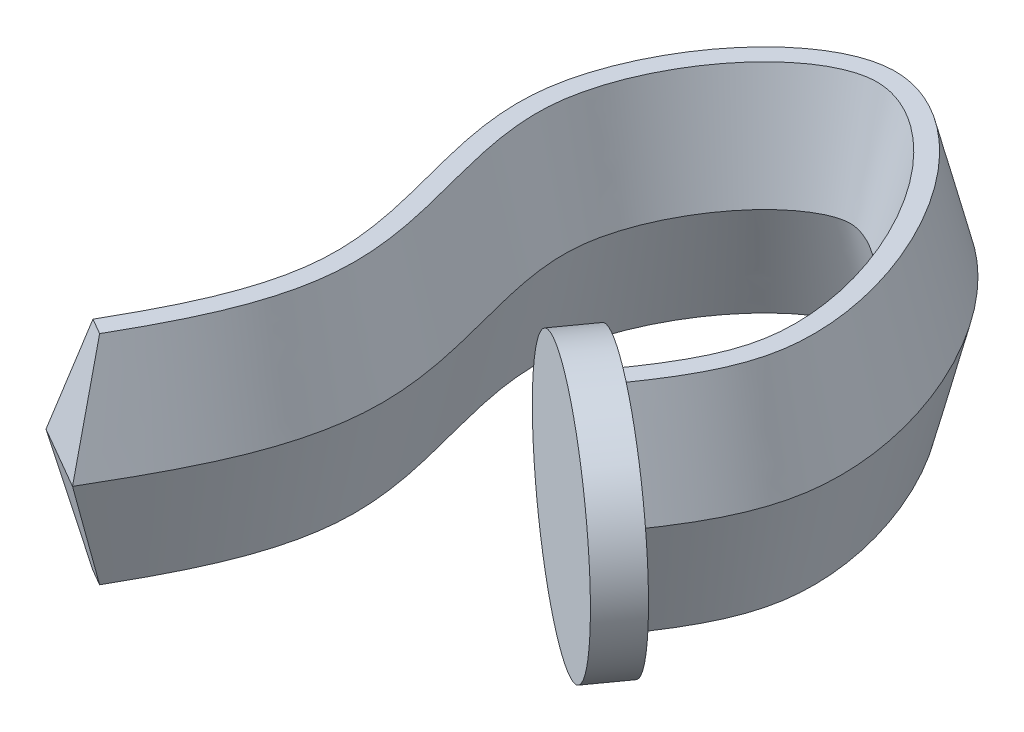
ISO-10303-21;
HEADER;
FILE_DESCRIPTION(('STEP AP214'),'2;1');
FILE_NAME('part.step','',(''),(''),'','','');
FILE_SCHEMA(('AUTOMOTIVE_DESIGN { 1 0 10303 214 1 1 1 1 }'));
ENDSEC;
DATA;
#1=APPLICATION_CONTEXT('core data for automotive mechanical design processes');
#2=APPLICATION_PROTOCOL_DEFINITION('international standard','automotive_design',2000,#1);
#3=PRODUCT_CONTEXT('',#1,'mechanical');
#4=PRODUCT('Part','Part','',(#3));
#5=PRODUCT_RELATED_PRODUCT_CATEGORY('part','',(#4));
#6=PRODUCT_DEFINITION_FORMATION('','',#4);
#7=PRODUCT_DEFINITION_CONTEXT('part definition',#1,'design');
#8=PRODUCT_DEFINITION('design','',#6,#7);
#9=PRODUCT_DEFINITION_SHAPE('','',#8);
#10=(LENGTH_UNIT() NAMED_UNIT(*) SI_UNIT(.MILLI.,.METRE.));
#11=(NAMED_UNIT(*) PLANE_ANGLE_UNIT() SI_UNIT($,.RADIAN.));
#12=(NAMED_UNIT(*) SI_UNIT($,.STERADIAN.) SOLID_ANGLE_UNIT());
#13=UNCERTAINTY_MEASURE_WITH_UNIT(LENGTH_MEASURE(1.E-05),#10,'distance_accuracy_value','');
#14=(GEOMETRIC_REPRESENTATION_CONTEXT(3) GLOBAL_UNCERTAINTY_ASSIGNED_CONTEXT((#13)) GLOBAL_UNIT_ASSIGNED_CONTEXT((#10,
#11,#12)) REPRESENTATION_CONTEXT('',''));
#15=CARTESIAN_POINT('',(0.,0.,0.));
#16=DIRECTION('',(0.,0.,1.));
#17=DIRECTION('',(1.,0.,0.));
#18=AXIS2_PLACEMENT_3D('',#15,#16,#17);
#19=CARTESIAN_POINT('',(8.65864369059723,0.,5.0027881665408));
#20=CARTESIAN_POINT('',(9.64602484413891,0.,3.29386480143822));
#21=CARTESIAN_POINT('',(10.6621578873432,0.,1.53620937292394));
#22=CARTESIAN_POINT('',(12.6732076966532,0.,-2.08760470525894));
#23=CARTESIAN_POINT('',(13.6683803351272,0.,-3.95378205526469));
#24=CARTESIAN_POINT('',(15.5512008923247,0.,-7.822404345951));
#25=CARTESIAN_POINT('',(16.4394263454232,0.,-9.82518996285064));
#26=CARTESIAN_POINT('',(18.0021248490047,0.,-14.0077317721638));
#27=CARTESIAN_POINT('',(18.6771524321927,0.,-16.1888976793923));
#28=CARTESIAN_POINT('',(19.4202124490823,0.,-19.616317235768));
#29=CARTESIAN_POINT('',(19.6225875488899,0.,-20.7845137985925));
#30=CARTESIAN_POINT('',(19.8415852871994,0.,-22.5735954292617));
#31=CARTESIAN_POINT('',(19.9004750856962,0.,-23.1760423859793));
#32=CARTESIAN_POINT('',(19.9871949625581,0.,-24.392190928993));
#33=CARTESIAN_POINT('',(20.0145800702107,0.,-25.0070662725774));
#34=CARTESIAN_POINT('',(20.0489834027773,0.,-26.8191365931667));
#35=CARTESIAN_POINT('',(20.0103791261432,0.,-27.9987783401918));
#36=CARTESIAN_POINT('',(19.8429511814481,0.,-30.2957367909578));
#37=CARTESIAN_POINT('',(19.7142085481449,0.,-31.4132036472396));
#38=CARTESIAN_POINT('',(19.2369758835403,0.,-34.6754213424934));
#39=CARTESIAN_POINT('',(18.7995282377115,0.,-36.7302428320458));
#40=CARTESIAN_POINT('',(17.8680265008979,0.,-40.6429935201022));
#41=CARTESIAN_POINT('',(17.3731251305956,0.,-42.5019659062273));
#42=CARTESIAN_POINT('',(16.4559685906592,0.,-46.0528163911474));
#43=CARTESIAN_POINT('',(16.0336235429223,0.,-47.7443119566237));
#44=CARTESIAN_POINT('',(15.3557436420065,0.,-50.9638452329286));
#45=CARTESIAN_POINT('',(15.1003426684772,0.,-52.4903691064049));
#46=CARTESIAN_POINT('',(14.8836106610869,0.,-54.6621323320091));
#47=CARTESIAN_POINT('',(14.8387224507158,0.,-55.3658514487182));
#48=CARTESIAN_POINT('',(14.80754974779,0.,-56.741899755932));
#49=CARTESIAN_POINT('',(14.8212655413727,0.,-57.4142309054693));
#50=CARTESIAN_POINT('',(14.8887110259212,0.,-58.4059408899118));
#51=CARTESIAN_POINT('',(14.9188040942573,0.,-58.7318834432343));
#52=CARTESIAN_POINT('',(14.9965193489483,0.,-59.3902660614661));
#53=CARTESIAN_POINT('',(15.0445665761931,0.,-59.7263782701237));
#54=CARTESIAN_POINT('',(15.2166678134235,0.,-60.7519709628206));
#55=CARTESIAN_POINT('',(15.3687916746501,0.,-61.4586963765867));
#56=CARTESIAN_POINT('',(15.9359099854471,0.,-63.6190631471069));
#57=CARTESIAN_POINT('',(16.4627568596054,0.,-65.1124249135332));
#58=CARTESIAN_POINT('',(17.77096128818,0.,-68.0574964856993));
#59=CARTESIAN_POINT('',(18.5519793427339,0.,-69.509164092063));
#60=CARTESIAN_POINT('',(20.2926553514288,0.,-72.2363552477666));
#61=CARTESIAN_POINT('',(21.2524836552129,0.,-73.5117076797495));
#62=CARTESIAN_POINT('',(23.2458863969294,0.,-75.7670158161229));
#63=CARTESIAN_POINT('',(24.2797541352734,0.,-76.7459716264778));
#64=CARTESIAN_POINT('',(26.2782299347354,0.,-78.3189571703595));
#65=CARTESIAN_POINT('',(27.2412867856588,0.,-78.9102938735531));
#66=CARTESIAN_POINT('',(28.5038853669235,0.,-79.5033418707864));
#67=CARTESIAN_POINT('',(28.8942257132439,0.,-79.6530320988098));
#68=CARTESIAN_POINT('',(29.5995761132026,0.,-79.8708863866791));
#69=CARTESIAN_POINT('',(29.9141952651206,0.,-79.9392552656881));
#70=CARTESIAN_POINT('',(30.3310897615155,0.,-79.9980891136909));
#71=CARTESIAN_POINT('',(30.460238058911,0.,-80.0104198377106));
#72=CARTESIAN_POINT('',(30.7067140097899,0.,-80.0235786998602));
#73=CARTESIAN_POINT('',(30.8332028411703,0.,-80.0248961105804));
#74=CARTESIAN_POINT('',(31.2296524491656,0.,-80.011359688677));
#75=CARTESIAN_POINT('',(31.5173032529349,0.,-79.9791872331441));
#76=CARTESIAN_POINT('',(32.1607345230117,0.,-79.8496413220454));
#77=CARTESIAN_POINT('',(32.5163207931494,0.,-79.7518563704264));
#78=CARTESIAN_POINT('',(33.2956199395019,0.,-79.470914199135));
#79=CARTESIAN_POINT('',(33.7190266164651,0.,-79.2876293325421));
#80=CARTESIAN_POINT('',(35.0717444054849,0.,-78.5916994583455));
#81=CARTESIAN_POINT('',(36.0829029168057,0.,-77.9297631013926));
#82=CARTESIAN_POINT('',(38.1824904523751,0.,-76.2122177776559));
#83=CARTESIAN_POINT('',(39.2697050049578,0.,-75.1588165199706));
#84=CARTESIAN_POINT('',(41.4004113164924,0.,-72.7347735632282));
#85=CARTESIAN_POINT('',(42.4441840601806,0.,-71.3650170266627));
#86=CARTESIAN_POINT('',(44.4014525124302,0.,-68.4059692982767));
#87=CARTESIAN_POINT('',(45.3152343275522,0.,-66.8168792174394));
#88=CARTESIAN_POINT('',(46.9479131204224,0.,-63.5243699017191));
#89=CARTESIAN_POINT('',(47.6668691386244,0.,-61.8209129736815));
#90=CARTESIAN_POINT('',(48.861468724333,0.,-58.4113363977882));
#91=CARTESIAN_POINT('',(49.3368778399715,0.,-56.7051602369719));
#92=CARTESIAN_POINT('',(50.0144619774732,0.,-53.4105378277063));
#93=CARTESIAN_POINT('',(50.216010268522,0.,-51.8223883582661));
#94=CARTESIAN_POINT('',(50.3142941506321,0.,-49.6240289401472));
#95=CARTESIAN_POINT('',(50.3133610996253,0.,-48.9219327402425));
#96=CARTESIAN_POINT('',(50.2491559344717,0.,-47.5938537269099));
#97=CARTESIAN_POINT('',(50.1863640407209,0.,-46.9711674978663));
#98=CARTESIAN_POINT('',(50.0052968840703,0.,-45.8002709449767));
#99=CARTESIAN_POINT('',(49.8833367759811,0.,-45.222257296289));
#100=CARTESIAN_POINT('',(49.5748988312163,0.,-44.0636634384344));
#101=CARTESIAN_POINT('',(49.3884219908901,0.,-43.4830897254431));
#102=CARTESIAN_POINT('',(48.9492916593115,0.,-42.3019934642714));
#103=CARTESIAN_POINT('',(48.6959390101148,0.,-41.7019742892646));
#104=CARTESIAN_POINT('',(48.1224106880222,0.,-40.4780882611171));
#105=CARTESIAN_POINT('',(47.8022351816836,0.,-39.854221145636));
#106=CARTESIAN_POINT('',(46.7426043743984,0.,-37.9394890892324));
#107=CARTESIAN_POINT('',(45.9043658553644,0.,-36.6077758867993));
#108=CARTESIAN_POINT('',(44.022169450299,0.,-33.8207371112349));
#109=CARTESIAN_POINT('',(42.9789203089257,0.,-32.3661745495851));
#110=CARTESIAN_POINT('',(41.8786398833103,0.,-30.8346816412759));
#111=CARTESIAN_POINT('',(4.77272748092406,18.,2.75758483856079));
#112=CARTESIAN_POINT('',(5.7605145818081,18.,1.04795887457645));
#113=CARTESIAN_POINT('',(6.76288908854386,18.,-0.686314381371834));
#114=CARTESIAN_POINT('',(8.72420477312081,18.,-4.22050998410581));
#115=CARTESIAN_POINT('',(9.68047975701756,18.,-6.01526014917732));
#116=CARTESIAN_POINT('',(11.4683867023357,18.,-9.68886390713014));
#117=CARTESIAN_POINT('',(12.29685321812,18.,-11.5604790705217));
#118=CARTESIAN_POINT('',(13.7365897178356,18.,-15.413914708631));
#119=CARTESIAN_POINT('',(14.3448919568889,18.,-17.3877152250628));
#120=CARTESIAN_POINT('',(15.0073238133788,18.,-20.4432313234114));
#121=CARTESIAN_POINT('',(15.1857695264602,18.,-21.4755125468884));
#122=CARTESIAN_POINT('',(15.3780124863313,18.,-23.0460234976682));
#123=CARTESIAN_POINT('',(15.4295766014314,18.,-23.5743331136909));
#124=CARTESIAN_POINT('',(15.5050184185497,18.,-24.6323190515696));
#125=CARTESIAN_POINT('',(15.5289396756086,18.,-25.1688943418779));
#126=CARTESIAN_POINT('',(15.558977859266,18.,-26.7510488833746));
#127=CARTESIAN_POINT('',(15.5254327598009,18.,-27.794854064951));
#128=CARTESIAN_POINT('',(15.3758396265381,18.,-29.8471351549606));
#129=CARTESIAN_POINT('',(15.2601284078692,18.,-30.8554617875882));
#130=CARTESIAN_POINT('',(14.8232207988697,18.,-33.8420295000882));
#131=CARTESIAN_POINT('',(14.4161972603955,18.,-35.7641345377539));
#132=CARTESIAN_POINT('',(13.5195824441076,18.,-39.530343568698));
#133=CARTESIAN_POINT('',(13.0336160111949,18.,-41.3572044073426));
#134=CARTESIAN_POINT('',(12.1048849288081,18.,-44.9528667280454));
#135=CARTESIAN_POINT('',(11.6662479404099,18.,-46.7045266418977));
#136=CARTESIAN_POINT('',(10.939890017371,18.,-50.154302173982));
#137=CARTESIAN_POINT('',(10.6553879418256,18.,-51.8366143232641));
#138=CARTESIAN_POINT('',(10.4075052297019,18.,-54.3205227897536));
#139=CARTESIAN_POINT('',(10.3548189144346,18.,-55.1384302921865));
#140=CARTESIAN_POINT('',(10.3179474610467,18.,-56.7660370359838));
#141=CARTESIAN_POINT('',(10.3339675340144,18.,-57.5755753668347));
#142=CARTESIAN_POINT('',(10.4160185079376,18.,-58.7820430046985));
#143=CARTESIAN_POINT('',(10.4530405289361,18.,-59.1834106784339));
#144=CARTESIAN_POINT('',(10.5483604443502,18.,-59.9909352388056));
#145=CARTESIAN_POINT('',(10.6067572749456,18.,-60.3988408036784));
#146=CARTESIAN_POINT('',(10.8142251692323,18.,-61.6351918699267));
#147=CARTESIAN_POINT('',(10.9948496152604,18.,-62.4720677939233));
#148=CARTESIAN_POINT('',(11.6613071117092,18.,-65.0108547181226));
#149=CARTESIAN_POINT('',(12.2673607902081,18.,-66.7228500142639));
#150=CARTESIAN_POINT('',(13.7634200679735,18.,-70.0908264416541));
#151=CARTESIAN_POINT('',(14.6467848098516,18.,-71.7322961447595));
#152=CARTESIAN_POINT('',(16.6318357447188,18.,-74.8423598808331));
#153=CARTESIAN_POINT('',(17.7240841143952,18.,-76.2963633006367));
#154=CARTESIAN_POINT('',(20.0489542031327,18.,-78.9266889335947));
#155=CARTESIAN_POINT('',(21.2657705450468,18.,-80.0850011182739));
#156=CARTESIAN_POINT('',(23.7407584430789,18.,-82.0330459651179));
#157=CARTESIAN_POINT('',(24.9779815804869,18.,-82.8055254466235));
#158=CARTESIAN_POINT('',(26.7735442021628,18.,-83.6489089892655));
#159=CARTESIAN_POINT('',(27.3554794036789,18.,-83.8748644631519));
#160=CARTESIAN_POINT('',(28.4895236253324,18.,-84.2251251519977));
#161=CARTESIAN_POINT('',(29.0385527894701,18.,-84.3480551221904));
#162=CARTESIAN_POINT('',(29.8282109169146,18.,-84.4594951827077));
#163=CARTESIAN_POINT('',(30.0895554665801,18.,-84.4849252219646));
#164=CARTESIAN_POINT('',(30.5988775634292,18.,-84.5121169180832));
#165=CARTESIAN_POINT('',(30.8594922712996,18.,-84.514517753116));
#166=CARTESIAN_POINT('',(31.6365186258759,18.,-84.4879870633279));
#167=CARTESIAN_POINT('',(32.1755747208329,18.,-84.4246153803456));
#168=CARTESIAN_POINT('',(33.2740603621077,18.,-84.2034503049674));
#169=CARTESIAN_POINT('',(33.8432175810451,18.,-84.0441348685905));
#170=CARTESIAN_POINT('',(35.0127857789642,18.,-83.6224981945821));
#171=CARTESIAN_POINT('',(35.6089018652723,18.,-83.3623505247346));
#172=CARTESIAN_POINT('',(37.4513145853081,18.,-82.4144880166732));
#173=CARTESIAN_POINT('',(38.706959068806,18.,-81.5814225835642));
#174=CARTESIAN_POINT('',(41.2416630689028,18.,-79.5079349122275));
#175=CARTESIAN_POINT('',(42.4927275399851,18.,-78.2898747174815));
#176=CARTESIAN_POINT('',(44.9190297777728,18.,-75.5295408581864));
#177=CARTESIAN_POINT('',(46.0805921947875,18.,-74.0022981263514));
#178=CARTESIAN_POINT('',(48.2513366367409,18.,-70.7205120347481));
#179=CARTESIAN_POINT('',(49.254443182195,18.,-68.9750206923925));
#180=CARTESIAN_POINT('',(51.0501300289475,18.,-65.3537844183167));
#181=CARTESIAN_POINT('',(51.8391451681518,18.,-63.4852181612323));
#182=CARTESIAN_POINT('',(53.1601170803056,18.,-59.7149549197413));
#183=CARTESIAN_POINT('',(53.688970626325,18.,-57.8222362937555));
#184=CARTESIAN_POINT('',(54.4541671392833,18.,-54.1016155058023));
#185=CARTESIAN_POINT('',(54.6876138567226,18.,-52.2872596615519));
#186=CARTESIAN_POINT('',(54.8036307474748,18.,-49.6922589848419));
#187=CARTESIAN_POINT('',(54.8031819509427,18.,-48.8531625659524));
#188=CARTESIAN_POINT('',(54.7246724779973,18.,-47.229199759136));
#189=CARTESIAN_POINT('',(54.646687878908,18.,-46.4478623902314));
#190=CARTESIAN_POINT('',(54.415346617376,18.,-44.9518604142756));
#191=CARTESIAN_POINT('',(54.2597933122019,18.,-44.2164697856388));
#192=CARTESIAN_POINT('',(53.8721509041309,18.,-42.76035804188));
#193=CARTESIAN_POINT('',(53.6412490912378,18.,-42.0435180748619));
#194=CARTESIAN_POINT('',(53.1095975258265,18.,-40.6135745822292));
#195=CARTESIAN_POINT('',(52.8070972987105,18.,-39.8986157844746));
#196=CARTESIAN_POINT('',(52.1389074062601,18.,-38.47272582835));
#197=CARTESIAN_POINT('',(51.772723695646,18.,-37.7602584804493));
#198=CARTESIAN_POINT('',(50.5817465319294,18.,-35.6081861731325));
#199=CARTESIAN_POINT('',(49.6739318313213,18.,-34.1706154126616));
#200=CARTESIAN_POINT('',(47.6910200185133,18.,-31.2344435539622));
#201=CARTESIAN_POINT('',(46.625282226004,18.,-29.7498154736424));
#202=CARTESIAN_POINT('',(45.5234283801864,18.,-28.2161325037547));
#203=B_SPLINE_SURFACE_WITH_KNOTS('',1,3,((#19,#20,#21,#22,#23,#24,#25,#26,#27,#28,#29,#30,#31,
#32,#33,#34,#35,#36,#37,#38,#39,#40,#41,#42,#43,#44,#45,#46,#47,#48,#49,#50,#51,#52,#53,#54,#55,
#56,#57,#58,#59,#60,#61,#62,#63,#64,#65,#66,#67,#68,#69,#70,#71,#72,#73,#74,#75,#76,#77,#78,#79,
#80,#81,#82,#83,#84,#85,#86,#87,#88,#89,#90,#91,#92,#93,#94,#95,#96,#97,#98,#99,#100,#101,#102,
#103,#104,#105,#106,#107,#108,#109,#110),(#111,#112,#113,#114,#115,#116,#117,#118,#119,#120,
#121,#122,#123,#124,#125,#126,#127,#128,#129,#130,#131,#132,#133,#134,#135,#136,#137,#138,#139,
#140,#141,#142,#143,#144,#145,#146,#147,#148,#149,#150,#151,#152,#153,#154,#155,#156,#157,#158,
#159,#160,#161,#162,#163,#164,#165,#166,#167,#168,#169,#170,#171,#172,#173,#174,#175,#176,#177,
#178,#179,#180,#181,#182,#183,#184,#185,#186,#187,#188,#189,#190,#191,#192,#193,#194,#195,#196,
#197,#198,#199,#200,#201,#202)),.UNSPECIFIED.,.F.,.F.,.F.,(2,2),(4,2,2,2,2,2,2,2,2,2,2,2,2,2,2,
2,2,2,2,2,2,2,2,2,2,2,2,2,2,2,2,2,2,2,2,2,2,2,2,2,2,2,2,2,2,4),(0.,1.),(0.,0.03125,0.0625,
0.09375,0.125,0.140625,0.1484375,0.15625,0.171875,0.1875,0.21875,0.25,0.28125,0.3125,0.328125,
0.34375,0.3515625,0.359375,0.375,0.40625,0.4375,0.46875,0.5,0.53125,0.546875,0.5625,0.5703125,
0.578125,0.59375,0.609375,0.625,0.65625,0.6875,0.71875,0.75,0.78125,0.8125,0.84375,0.859375,
0.875,0.890625,0.90625,0.921875,0.9375,0.96875,1.),.UNSPECIFIED.);
#204=CARTESIAN_POINT('',(47.0847755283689,15.,-31.6994452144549));
#205=CARTESIAN_POINT('',(46.4992375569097,12.1086146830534,-32.1201170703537));
#206=CARTESIAN_POINT('',(45.9136990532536,9.21722952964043,-32.5407893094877));
#207=CARTESIAN_POINT('',(44.9011410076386,4.21722960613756,-33.2682479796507));
#208=CARTESIAN_POINT('',(44.4741217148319,2.10861475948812,-33.5750342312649));
#209=CARTESIAN_POINT('',(44.0471021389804,-1.87261435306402E-10,-33.8818206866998));
#210=B_SPLINE_CURVE_WITH_KNOTS('',3,(#204,#205,#206,#207,#208,#209),.UNSPECIFIED.,.F.,.F.,(4,2,
4),(0.,8.93976270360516,15.4593085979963),.UNSPECIFIED.);
#211=CARTESIAN_POINT('',(47.0847755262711,14.9999999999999,-31.6994452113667));
#212=VERTEX_POINT('',#211);
#213=CARTESIAN_POINT('',(44.047102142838,0.,-33.8818206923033));
#214=VERTEX_POINT('',#213);
#215=EDGE_CURVE('E166',#212,#214,#210,.T.);
#216=CARTESIAN_POINT('',(7.28415685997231,15.,-0.110653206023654));
#217=CARTESIAN_POINT('',(7.55102399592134,15.,-0.579841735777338));
#218=CARTESIAN_POINT('',(7.81654891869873,15.,-1.04980695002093));
#219=CARTESIAN_POINT('',(8.3447813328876,15.,-1.99380161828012));
#220=CARTESIAN_POINT('',(8.60747318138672,15.,-2.46783981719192));
#221=CARTESIAN_POINT('',(9.12849531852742,15.,-3.42010698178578));
#222=CARTESIAN_POINT('',(9.38681069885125,15.,-3.8983441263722));
#223=CARTESIAN_POINT('',(9.89742226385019,15.,-4.85918652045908));
#224=CARTESIAN_POINT('',(10.1497061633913,15.,-5.34179831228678));
#225=CARTESIAN_POINT('',(10.6466505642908,15.,-6.31153969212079));
#226=CARTESIAN_POINT('',(10.8913033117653,15.,-6.79867326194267));
#227=CARTESIAN_POINT('',(11.3714647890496,15.,-7.77756681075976));
#228=CARTESIAN_POINT('',(11.6069715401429,15.,-8.26932776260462));
#229=CARTESIAN_POINT('',(12.0668567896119,15.,-9.25715561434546));
#230=CARTESIAN_POINT('',(12.2912512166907,15.,-9.75321507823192));
#231=CARTESIAN_POINT('',(12.7274307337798,15.,-10.7504124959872));
#232=CARTESIAN_POINT('',(12.9392252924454,15.,-11.2515462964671));
#233=CARTESIAN_POINT('',(13.3485554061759,15.,-12.2590793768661));
#234=CARTESIAN_POINT('',(13.5461039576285,15.,-12.7654733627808));
#235=CARTESIAN_POINT('',(13.9253793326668,15.,-13.7836873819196));
#236=CARTESIAN_POINT('',(14.1071193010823,15.,-14.2955025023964));
#237=CARTESIAN_POINT('',(14.4528676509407,15.,-15.3248458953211));
#238=CARTESIAN_POINT('',(14.6168841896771,15.,-15.8423714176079));
#239=CARTESIAN_POINT('',(14.9253516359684,15.,-16.8833969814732));
#240=CARTESIAN_POINT('',(15.0697974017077,15.,-17.4068985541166));
#241=CARTESIAN_POINT('',(15.3197407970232,15.,-18.3905477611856));
#242=CARTESIAN_POINT('',(15.4278615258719,15.,-18.8500286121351));
#243=CARTESIAN_POINT('',(15.6267292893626,15.,-19.7729556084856));
#244=CARTESIAN_POINT('',(15.7174690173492,15.,-20.2364033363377));
#245=CARTESIAN_POINT('',(15.8802030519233,15.,-21.1665581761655));
#246=CARTESIAN_POINT('',(15.9521985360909,15.,-21.6332650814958));
#247=CARTESIAN_POINT('',(16.0762918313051,15.,-22.5692256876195));
#248=CARTESIAN_POINT('',(16.1283947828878,15.,-23.0384786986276));
#249=CARTESIAN_POINT('',(16.1909078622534,15.,-23.7436740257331));
#250=CARTESIAN_POINT('',(16.2091380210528,15.,-23.9789438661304));
#251=CARTESIAN_POINT('',(16.2401687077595,15.,-24.4498446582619));
#252=CARTESIAN_POINT('',(16.2529692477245,15.,-24.685475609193));
#253=CARTESIAN_POINT('',(16.273321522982,15.,-25.1572414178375));
#254=CARTESIAN_POINT('',(16.2808670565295,15.,-25.393376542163));
#255=CARTESIAN_POINT('',(16.2906535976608,15.,-25.8657535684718));
#256=CARTESIAN_POINT('',(16.2928945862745,15.,-26.1019954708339));
#257=CARTESIAN_POINT('',(16.2920536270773,15.,-26.8108745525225));
#258=CARTESIAN_POINT('',(16.281401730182,15.,-27.283519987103));
#259=CARTESIAN_POINT('',(16.2413317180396,15.,-28.2280509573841));
#260=CARTESIAN_POINT('',(16.211910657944,15.,-28.6999363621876));
#261=CARTESIAN_POINT('',(16.1359915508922,15.,-29.6421081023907));
#262=CARTESIAN_POINT('',(16.0895010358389,15.,-30.1123950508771));
#263=CARTESIAN_POINT('',(15.9811588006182,15.,-31.0504943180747));
#264=CARTESIAN_POINT('',(15.9193290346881,15.,-31.5183092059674));
#265=CARTESIAN_POINT('',(15.7663113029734,15.,-32.5607707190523));
#266=CARTESIAN_POINT('',(15.6716395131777,15.,-33.1349037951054));
#267=CARTESIAN_POINT('',(15.4650436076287,15.,-34.2800794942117));
#268=CARTESIAN_POINT('',(15.3531177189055,15.,-34.8511217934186));
#269=CARTESIAN_POINT('',(15.1153540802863,15.,-35.990307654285));
#270=CARTESIAN_POINT('',(14.9895156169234,15.,-36.5584510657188));
#271=CARTESIAN_POINT('',(14.793139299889,15.,-37.408876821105));
#272=CARTESIAN_POINT('',(14.7264113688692,15.,-37.6920513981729));
#273=CARTESIAN_POINT('',(14.5908724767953,15.,-38.2579021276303));
#274=CARTESIAN_POINT('',(14.5220615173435,15.,-38.5405782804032));
#275=CARTESIAN_POINT('',(14.3125105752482,15.,-39.3901365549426));
#276=CARTESIAN_POINT('',(14.1691609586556,15.,-39.9563732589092));
#277=CARTESIAN_POINT('',(13.8788436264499,15.,-41.0879123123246));
#278=CARTESIAN_POINT('',(13.7318758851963,15.,-41.6532146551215));
#279=CARTESIAN_POINT('',(13.5110144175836,15.,-42.5028105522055));
#280=CARTESIAN_POINT('',(13.4371127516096,15.,-42.7871018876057));
#281=CARTESIAN_POINT('',(13.2898242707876,15.,-43.3558176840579));
#282=CARTESIAN_POINT('',(13.2164374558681,15.,-43.6402421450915));
#283=CARTESIAN_POINT('',(12.9976937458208,15.,-44.4938805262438));
#284=CARTESIAN_POINT('',(12.8537532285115,15.,-45.0634607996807));
#285=CARTESIAN_POINT('',(12.5765978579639,15.,-46.1912083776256));
#286=CARTESIAN_POINT('',(12.4432114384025,15.,-46.7493331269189));
#287=CARTESIAN_POINT('',(12.1875074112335,15.,-47.8681461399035));
#288=CARTESIAN_POINT('',(12.0651898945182,15.,-48.4288344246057));
#289=CARTESIAN_POINT('',(11.8361680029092,15.,-49.5519153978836));
#290=CARTESIAN_POINT('',(11.7294239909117,15.,-50.1142999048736));
#291=CARTESIAN_POINT('',(11.5354173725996,15.,-51.2424625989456));
#292=CARTESIAN_POINT('',(11.4481544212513,15.,-51.80824072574));
#293=CARTESIAN_POINT('',(11.2985775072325,15.,-52.9386455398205));
#294=CARTESIAN_POINT('',(11.2360735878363,15.,-53.5032465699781));
#295=CARTESIAN_POINT('',(11.139886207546,15.,-54.6350235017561));
#296=CARTESIAN_POINT('',(11.1062046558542,15.,-55.2021995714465));
#297=CARTESIAN_POINT('',(11.0726526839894,15.,-56.3348105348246));
#298=CARTESIAN_POINT('',(11.0726156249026,15.,-56.9002401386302));
#299=CARTESIAN_POINT('',(11.1100868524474,15.,-58.0297979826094));
#300=CARTESIAN_POINT('',(11.147581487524,15.,-58.5939266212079));
#301=CARTESIAN_POINT('',(11.236065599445,15.,-59.4518587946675));
#302=CARTESIAN_POINT('',(11.2722703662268,15.,-59.7472441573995));
#303=CARTESIAN_POINT('',(11.3554298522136,15.,-60.3365126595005));
#304=CARTESIAN_POINT('',(11.4023850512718,15.,-60.6303957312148));
#305=CARTESIAN_POINT('',(11.5064802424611,15.,-61.2172962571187));
#306=CARTESIAN_POINT('',(11.5636517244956,15.,-61.5103081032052));
#307=CARTESIAN_POINT('',(11.6874987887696,15.,-62.094299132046));
#308=CARTESIAN_POINT('',(11.7541742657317,15.,-62.3852783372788));
#309=CARTESIAN_POINT('',(11.9678018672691,15.,-63.2554700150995));
#310=CARTESIAN_POINT('',(12.128260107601,15.,-63.8314107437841));
#311=CARTESIAN_POINT('',(12.4843329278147,15.,-64.9818129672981));
#312=CARTESIAN_POINT('',(12.6804444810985,15.,-65.5561191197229));
#313=CARTESIAN_POINT('',(13.1031717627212,15.,-66.6926568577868));
#314=CARTESIAN_POINT('',(13.3297539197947,15.,-67.2549009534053));
#315=CARTESIAN_POINT('',(13.8116096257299,15.,-68.3667458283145));
#316=CARTESIAN_POINT('',(14.0668751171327,15.,-68.9163501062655));
#317=CARTESIAN_POINT('',(14.6014532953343,15.,-69.9956060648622));
#318=CARTESIAN_POINT('',(14.8804444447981,15.,-70.5254171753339));
#319=CARTESIAN_POINT('',(15.4641593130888,15.,-71.5708398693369));
#320=CARTESIAN_POINT('',(15.768889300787,15.,-72.0864479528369));
#321=CARTESIAN_POINT('',(16.4036258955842,15.,-73.1021041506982));
#322=CARTESIAN_POINT('',(16.7336405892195,15.,-73.6021472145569));
#323=CARTESIAN_POINT('',(17.4159650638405,15.,-74.5809381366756));
#324=CARTESIAN_POINT('',(17.768077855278,15.,-75.0598231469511));
#325=CARTESIAN_POINT('',(18.4969720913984,15.,-75.9982450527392));
#326=CARTESIAN_POINT('',(18.8737463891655,15.,-76.4577874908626));
#327=CARTESIAN_POINT('',(19.6524295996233,15.,-77.3547169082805));
#328=CARTESIAN_POINT('',(20.0543244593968,15.,-77.7921160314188));
#329=CARTESIAN_POINT('',(20.7691869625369,15.,-78.5236981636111));
#330=CARTESIAN_POINT('',(21.0759298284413,15.,-78.8239755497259));
#331=CARTESIAN_POINT('',(21.7034692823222,15.,-79.4094708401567));
#332=CARTESIAN_POINT('',(22.0242646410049,15.,-79.6946900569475));
#333=CARTESIAN_POINT('',(22.682113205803,15.,-80.2492336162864));
#334=CARTESIAN_POINT('',(23.0192399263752,15.,-80.5184710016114));
#335=CARTESIAN_POINT('',(23.7088436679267,15.,-81.0364827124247));
#336=CARTESIAN_POINT('',(24.0613169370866,15.,-81.2852619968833));
#337=CARTESIAN_POINT('',(24.6656024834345,15.,-81.6822441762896));
#338=CARTESIAN_POINT('',(24.9131388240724,15.,-81.8369706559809));
#339=CARTESIAN_POINT('',(25.4156563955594,15.,-82.1339482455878));
#340=CARTESIAN_POINT('',(25.670638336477,15.,-82.2761981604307));
#341=CARTESIAN_POINT('',(26.1883267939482,15.,-82.5463675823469));
#342=CARTESIAN_POINT('',(26.4510381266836,15.,-82.6742779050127));
#343=CARTESIAN_POINT('',(26.9818587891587,15.,-82.9124760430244));
#344=CARTESIAN_POINT('',(27.2499081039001,15.,-83.022896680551));
#345=CARTESIAN_POINT('',(27.7930313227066,15.,-83.2245822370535));
#346=CARTESIAN_POINT('',(28.0681018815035,15.,-83.3158560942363));
#347=CARTESIAN_POINT('',(28.6245168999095,15.,-83.4759589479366));
#348=CARTESIAN_POINT('',(28.9058545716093,15.,-83.5448110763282));
#349=CARTESIAN_POINT('',(29.3592350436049,15.,-83.6338989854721));
#350=CARTESIAN_POINT('',(29.5296361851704,15.,-83.6625451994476));
#351=CARTESIAN_POINT('',(29.7862700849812,15.,-83.697802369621));
#352=CARTESIAN_POINT('',(29.8719799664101,15.,-83.7082688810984));
#353=CARTESIAN_POINT('',(30.043683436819,15.,-83.7265566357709));
#354=CARTESIAN_POINT('',(30.1296770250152,15.,-83.7343778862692));
#355=CARTESIAN_POINT('',(30.3018424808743,15.,-83.7472362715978));
#356=CARTESIAN_POINT('',(30.3880142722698,15.,-83.7522744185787));
#357=CARTESIAN_POINT('',(30.5604739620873,15.,-83.759509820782));
#358=CARTESIAN_POINT('',(30.6467618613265,15.,-83.7617070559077));
#359=CARTESIAN_POINT('',(30.9056710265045,15.,-83.7641916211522));
#360=CARTESIAN_POINT('',(31.0783486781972,15.,-83.7603726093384));
#361=CARTESIAN_POINT('',(31.4232000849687,15.,-83.7421027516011));
#362=CARTESIAN_POINT('',(31.5953735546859,15.,-83.7276467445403));
#363=CARTESIAN_POINT('',(31.9386407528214,15.,-83.6889455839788));
#364=CARTESIAN_POINT('',(32.1097342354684,15.,-83.6646982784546));
#365=CARTESIAN_POINT('',(32.4986585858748,15.,-83.5988144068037));
#366=CARTESIAN_POINT('',(32.7159861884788,15.,-83.5541966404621));
#367=CARTESIAN_POINT('',(33.1473922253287,15.,-83.4513856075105));
#368=CARTESIAN_POINT('',(33.3614702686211,15.,-83.3931907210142));
#369=CARTESIAN_POINT('',(33.7859471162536,15.,-83.2646792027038));
#370=CARTESIAN_POINT('',(33.9963457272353,15.,-83.1943619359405));
#371=CARTESIAN_POINT('',(34.4140835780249,15.,-83.0426031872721));
#372=CARTESIAN_POINT('',(34.6214060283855,15.,-82.9611157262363));
#373=CARTESIAN_POINT('',(35.0318899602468,15.,-82.7883629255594));
#374=CARTESIAN_POINT('',(35.2350519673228,15.,-82.6970988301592));
#375=CARTESIAN_POINT('',(35.6372259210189,15.,-82.5058304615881));
#376=CARTESIAN_POINT('',(35.8362374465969,15.,-82.4058253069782));
#377=CARTESIAN_POINT('',(36.2925564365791,15.,-82.1650293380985));
#378=CARTESIAN_POINT('',(36.5483455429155,15.,-82.0213587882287));
#379=CARTESIAN_POINT('',(37.0528730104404,15.,-81.7220795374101));
#380=CARTESIAN_POINT('',(37.3016099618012,15.,-81.5664684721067));
#381=CARTESIAN_POINT('',(37.7922989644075,15.,-81.2446614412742));
#382=CARTESIAN_POINT('',(38.034247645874,15.,-81.0784603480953));
#383=CARTESIAN_POINT('',(38.5114567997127,15.,-80.7366970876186));
#384=CARTESIAN_POINT('',(38.7467164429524,15.,-80.561133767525));
#385=CARTESIAN_POINT('',(39.4428363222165,15.,-80.0218843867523));
#386=CARTESIAN_POINT('',(39.8940229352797,15.,-79.6456486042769));
#387=CARTESIAN_POINT('',(40.7722215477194,15.,-78.8659299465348));
#388=CARTESIAN_POINT('',(41.1992266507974,15.,-78.4624393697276));
#389=CARTESIAN_POINT('',(41.8718971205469,15.,-77.7909935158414));
#390=CARTESIAN_POINT('',(42.1246076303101,15.,-77.5300429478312));
#391=CARTESIAN_POINT('',(42.6216181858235,15.,-77.0002483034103));
#392=CARTESIAN_POINT('',(42.8659180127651,15.,-76.731404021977));
#393=CARTESIAN_POINT('',(43.5868925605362,15.,-75.9137772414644));
#394=CARTESIAN_POINT('',(44.0513652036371,15.,-75.35417962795));
#395=CARTESIAN_POINT('',(44.9495625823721,15.,-74.2107109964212));
#396=CARTESIAN_POINT('',(45.3832781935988,15.,-73.6268328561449));
#397=CARTESIAN_POINT('',(46.2218191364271,15.,-72.4370386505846));
#398=CARTESIAN_POINT('',(46.6265874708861,15.,-71.8310824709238));
#399=CARTESIAN_POINT('',(47.4068740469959,15.,-70.6009712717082));
#400=CARTESIAN_POINT('',(47.7824030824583,15.,-69.9768230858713));
#401=CARTESIAN_POINT('',(48.5047014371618,15.,-68.7121752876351));
#402=CARTESIAN_POINT('',(48.8514726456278,15.,-68.0716767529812));
#403=CARTESIAN_POINT('',(49.5402263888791,15.,-66.7287355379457));
#404=CARTESIAN_POINT('',(49.8800292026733,15.,-66.0251740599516));
#405=CARTESIAN_POINT('',(50.525669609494,15.,-64.6025202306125));
#406=CARTESIAN_POINT('',(50.8315025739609,15.,-63.8834257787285));
#407=CARTESIAN_POINT('',(51.4078753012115,15.,-62.430936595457));
#408=CARTESIAN_POINT('',(51.6784035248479,15.,-61.6975372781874));
#409=CARTESIAN_POINT('',(52.1819837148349,15.,-60.2175305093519));
#410=CARTESIAN_POINT('',(52.4150166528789,15.,-59.4709165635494));
#411=CARTESIAN_POINT('',(52.8404798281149,15.,-57.966387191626));
#412=CARTESIAN_POINT('',(53.0329210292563,15.,-57.2084748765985));
#413=CARTESIAN_POINT('',(53.3729660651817,15.,-55.6829378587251));
#414=CARTESIAN_POINT('',(53.5205940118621,15.,-54.9153186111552));
#415=CARTESIAN_POINT('',(53.7178376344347,15.,-53.6726707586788));
#416=CARTESIAN_POINT('',(53.7832334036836,15.,-53.2001160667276));
#417=CARTESIAN_POINT('',(53.8936687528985,15.,-52.2526131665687));
#418=CARTESIAN_POINT('',(53.9387092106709,15.,-51.7776650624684));
#419=CARTESIAN_POINT('',(54.0064211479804,15.,-50.8259822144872));
#420=CARTESIAN_POINT('',(54.0290844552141,15.,-50.3492468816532));
#421=CARTESIAN_POINT('',(54.0495734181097,15.,-49.3989380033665));
#422=CARTESIAN_POINT('',(54.0475941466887,15.,-48.92536928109));
#423=CARTESIAN_POINT('',(54.0242517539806,15.,-48.2157747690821));
#424=CARTESIAN_POINT('',(54.0130770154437,15.,-47.9793878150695));
#425=CARTESIAN_POINT('',(53.9835287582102,15.,-47.5070557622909));
#426=CARTESIAN_POINT('',(53.9651552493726,15.,-47.2711106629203));
#427=CARTESIAN_POINT('',(53.9207798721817,15.,-46.8000872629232));
#428=CARTESIAN_POINT('',(53.8947830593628,15.,-46.5650084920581));
#429=CARTESIAN_POINT('',(53.8497162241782,15.,-46.2131758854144));
#430=CARTESIAN_POINT('',(53.8336817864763,15.,-46.0960279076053));
#431=CARTESIAN_POINT('',(53.7995154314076,15.,-45.8620382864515));
#432=CARTESIAN_POINT('',(53.7813835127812,15.,-45.7451966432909));
#433=CARTESIAN_POINT('',(53.7236168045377,15.,-45.3935099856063));
#434=CARTESIAN_POINT('',(53.6808251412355,15.,-45.1591758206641));
#435=CARTESIAN_POINT('',(53.5870005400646,15.,-44.6921661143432));
#436=CARTESIAN_POINT('',(53.5359674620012,15.,-44.4594906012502));
#437=CARTESIAN_POINT('',(53.4258462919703,15.,-43.9958972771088));
#438=CARTESIAN_POINT('',(53.3667530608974,15.,-43.7649806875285));
#439=CARTESIAN_POINT('',(53.2408797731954,15.,-43.3052570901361));
#440=CARTESIAN_POINT('',(53.1740997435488,15.,-43.076450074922));
#441=CARTESIAN_POINT('',(53.0332583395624,15.,-42.6210590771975));
#442=CARTESIAN_POINT('',(52.9591959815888,15.,-42.3944753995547));
#443=CARTESIAN_POINT('',(52.8043369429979,15.,-41.9436249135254));
#444=CARTESIAN_POINT('',(52.723540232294,15.,-41.7193581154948));
#445=CARTESIAN_POINT('',(52.5547501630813,15.,-41.2709743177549));
#446=CARTESIAN_POINT('',(52.4666926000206,15.,-41.0468815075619));
#447=CARTESIAN_POINT('',(52.284553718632,15.,-40.6011665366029));
#448=CARTESIAN_POINT('',(52.190472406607,15.,-40.3795443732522));
#449=CARTESIAN_POINT('',(51.8999681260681,15.,-39.7184339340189));
#450=CARTESIAN_POINT('',(51.6952377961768,15.,-39.2825782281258));
#451=CARTESIAN_POINT('',(51.2671889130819,15.,-38.4201956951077));
#452=CARTESIAN_POINT('',(51.0438711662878,15.,-37.9936684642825));
#453=CARTESIAN_POINT('',(50.6254859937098,15.,-37.2290710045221));
#454=CARTESIAN_POINT('',(50.4330730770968,15.,-36.8895400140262));
#455=CARTESIAN_POINT('',(50.0397109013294,15.,-36.2155336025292));
#456=CARTESIAN_POINT('',(49.8387627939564,15.,-35.8810575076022));
#457=CARTESIAN_POINT('',(49.4297400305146,15.,-35.2164634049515));
#458=CARTESIAN_POINT('',(49.2216647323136,15.,-34.886345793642));
#459=CARTESIAN_POINT('',(48.803518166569,15.,-34.2358391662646));
#460=CARTESIAN_POINT('',(48.5935520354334,15.,-33.9153824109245));
#461=CARTESIAN_POINT('',(48.1690696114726,15.,-33.2775634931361));
#462=CARTESIAN_POINT('',(47.9545538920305,15.,-32.9602009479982));
#463=CARTESIAN_POINT('',(47.5220458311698,15.,-32.3280689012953));
#464=CARTESIAN_POINT('',(47.3040551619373,15.,-32.0132982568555));
#465=CARTESIAN_POINT('',(47.0847755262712,15.,-31.6994452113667));
#466=B_SPLINE_CURVE_WITH_KNOTS('',3,(#216,#217,#218,#219,#220,#221,#222,#223,#224,#225,#226,
#227,#228,#229,#230,#231,#232,#233,#234,#235,#236,#237,#238,#239,#240,#241,#242,#243,#244,#245,
#246,#247,#248,#249,#250,#251,#252,#253,#254,#255,#256,#257,#258,#259,#260,#261,#262,#263,#264,
#265,#266,#267,#268,#269,#270,#271,#272,#273,#274,#275,#276,#277,#278,#279,#280,#281,#282,#283,
#284,#285,#286,#287,#288,#289,#290,#291,#292,#293,#294,#295,#296,#297,#298,#299,#300,#301,#302,
#303,#304,#305,#306,#307,#308,#309,#310,#311,#312,#313,#314,#315,#316,#317,#318,#319,#320,#321,
#322,#323,#324,#325,#326,#327,#328,#329,#330,#331,#332,#333,#334,#335,#336,#337,#338,#339,#340,
#341,#342,#343,#344,#345,#346,#347,#348,#349,#350,#351,#352,#353,#354,#355,#356,#357,#358,#359,
#360,#361,#362,#363,#364,#365,#366,#367,#368,#369,#370,#371,#372,#373,#374,#375,#376,#377,#378,
#379,#380,#381,#382,#383,#384,#385,#386,#387,#388,#389,#390,#391,#392,#393,#394,#395,#396,#397,
#398,#399,#400,#401,#402,#403,#404,#405,#406,#407,#408,#409,#410,#411,#412,#413,#414,#415,#416,
#417,#418,#419,#420,#421,#422,#423,#424,#425,#426,#427,#428,#429,#430,#431,#432,#433,#434,#435,
#436,#437,#438,#439,#440,#441,#442,#443,#444,#445,#446,#447,#448,#449,#450,#451,#452,#453,#454,
#455,#456,#457,#458,#459,#460,#461,#462,#463,#464,#465),.UNSPECIFIED.,.F.,.F.,(4,2,2,2,2,2,2,2,
2,2,2,2,2,2,2,2,2,2,2,2,2,2,2,2,2,2,2,2,2,2,2,2,2,2,2,2,2,2,2,2,2,2,2,2,2,2,2,2,2,2,2,2,2,2,2,2,
2,2,2,2,2,2,2,2,2,2,2,2,2,2,2,2,2,2,2,2,2,2,2,2,2,2,2,2,2,2,2,2,2,2,2,2,2,2,2,2,2,2,2,2,2,2,2,2,
2,2,2,2,2,2,2,2,2,2,2,2,2,2,2,2,2,2,2,2,4),(0.,1.61933727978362,3.24519274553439,
4.87577715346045,6.50944013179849,8.14471228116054,9.78033626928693,11.4135434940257,
13.0455074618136,14.6759632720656,16.3050501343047,17.933383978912,19.5621448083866,
20.9779283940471,22.3943058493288,23.8105943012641,25.226516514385,25.9343901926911,
26.6422622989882,27.3509683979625,28.0596770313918,29.4775296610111,30.895604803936,
32.3130549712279,33.7284880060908,35.4738205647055,37.2193325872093,38.9649341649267,
39.8377198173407,40.7105047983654,42.4627757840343,44.2150591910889,45.0962779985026,
45.9774966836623,47.7399298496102,49.4613849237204,51.1828541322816,52.8998624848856,
54.616840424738,56.3203776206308,58.0240276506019,59.7192395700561,61.4138351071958,
62.3064366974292,63.1990781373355,64.0945199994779,64.9899519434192,66.7824159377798,
68.6021058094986,70.4198070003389,72.2369988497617,74.032612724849,75.8286652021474,
77.6252945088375,79.4077133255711,81.1896178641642,82.9705343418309,84.2578623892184,
85.5450780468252,86.838753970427,88.1321153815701,89.0075556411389,89.883079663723,
90.7591612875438,91.6282326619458,92.4968974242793,93.3646631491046,93.8827508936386,
94.1417540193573,94.4007564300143,94.6596645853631,94.9185745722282,95.4363617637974,
95.9544003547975,96.4725528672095,97.137623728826,97.8027739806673,98.4679590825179,
99.1359694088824,99.803894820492,100.471887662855,101.351631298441,102.231549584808,
103.11189721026,103.99235348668,105.753318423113,107.514783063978,108.604386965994,
109.694019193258,111.874461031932,114.055547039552,116.240815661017,118.425273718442,
120.609588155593,122.952654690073,125.29604008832,127.640189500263,129.985524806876,
132.330225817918,134.673663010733,136.104467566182,137.535210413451,138.966475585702,
140.386417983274,141.09628017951,141.80614140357,142.515532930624,142.870237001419,
143.224941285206,143.939405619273,144.653882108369,145.368816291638,146.083747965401,
146.798776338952,147.513807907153,148.236030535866,148.958252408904,150.402300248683,
151.846285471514,153.016928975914,154.187415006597,155.358006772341,156.507307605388,
157.656464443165,158.80508405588),.UNSPECIFIED.);
#467=CARTESIAN_POINT('',(7.28415685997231,15.,-0.110653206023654));
#468=VERTEX_POINT('',#467);
#469=EDGE_CURVE('E235',#468,#212,#466,.T.);
#470=CARTESIAN_POINT('',(7.28415685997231,15.,-0.110653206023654));
#471=CARTESIAN_POINT('',(7.39989272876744,13.7503149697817,0.316066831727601));
#472=CARTESIAN_POINT('',(7.51518087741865,12.5005119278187,0.742562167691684));
#473=CARTESIAN_POINT('',(7.74508388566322,10.0007288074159,1.59521480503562));
#474=CARTESIAN_POINT('',(7.85969874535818,8.75074872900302,2.02137210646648));
#475=CARTESIAN_POINT('',(8.08847744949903,6.25066918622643,2.87346049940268));
#476=CARTESIAN_POINT('',(8.20264129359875,5.00056972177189,3.29939159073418));
#477=CARTESIAN_POINT('',(8.43074935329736,2.50031297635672,4.15114352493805));
#478=CARTESIAN_POINT('',(8.5446935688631,1.2501556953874,4.57696436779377));
#479=CARTESIAN_POINT('',(8.65864369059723,0.,5.0027881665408));
#480=B_SPLINE_CURVE_WITH_KNOTS('',3,(#470,#471,#472,#473,#474,#475,#476,#477,#478,#479),
.UNSPECIFIED.,.F.,.F.,(4,2,2,2,4),(0.,3.97677940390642,7.9535582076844,11.9303400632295,
15.907122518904),.UNSPECIFIED.);
#481=CARTESIAN_POINT('',(8.65864369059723,0.,5.0027881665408));
#482=VERTEX_POINT('',#481);
#483=EDGE_CURVE('E45',#468,#482,#480,.T.);
#484=CARTESIAN_POINT('',(8.65864369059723,0.,5.0027881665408));
#485=CARTESIAN_POINT('',(8.84437343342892,0.,4.68134017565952));
#486=CARTESIAN_POINT('',(9.03011280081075,0.,4.35989774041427));
#487=CARTESIAN_POINT('',(9.40121379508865,0.,3.71679169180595));
#488=CARTESIAN_POINT('',(9.58657541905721,0.,3.39512807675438));
#489=CARTESIAN_POINT('',(10.1449230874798,0.,2.42349698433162));
#490=CARTESIAN_POINT('',(10.5167137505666,0.,1.77284003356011));
#491=CARTESIAN_POINT('',(11.2566685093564,0.,0.463624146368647));
#492=CARTESIAN_POINT('',(11.6247908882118,0.,-0.194958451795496));
#493=CARTESIAN_POINT('',(12.3534919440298,0.,-1.52014768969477));
#494=CARTESIAN_POINT('',(12.7140294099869,0.,-2.18677706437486));
#495=CARTESIAN_POINT('',(13.4232863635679,0.,-3.52839238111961));
#496=CARTESIAN_POINT('',(13.7719751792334,0.,-4.20339462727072));
#497=CARTESIAN_POINT('',(14.2831280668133,0.,-5.22213143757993));
#498=CARTESIAN_POINT('',(14.4515857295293,0.,-5.56286231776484));
#499=CARTESIAN_POINT('',(14.7841164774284,0.,-6.246456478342));
#500=CARTESIAN_POINT('',(14.9481895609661,0.,-6.58931975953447));
#501=CARTESIAN_POINT('',(15.43214037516,0.,-7.61934379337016));
#502=CARTESIAN_POINT('',(15.7447607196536,0.,-8.30994112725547));
#503=CARTESIAN_POINT('',(16.3461362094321,0.,-9.70000039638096));
#504=CARTESIAN_POINT('',(16.6349342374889,0.,-10.399443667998));
#505=CARTESIAN_POINT('',(17.0476454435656,0.,-11.4556531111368));
#506=CARTESIAN_POINT('',(17.1816593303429,0.,-11.8084877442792));
#507=CARTESIAN_POINT('',(17.4425482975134,0.,-12.5167844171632));
#508=CARTESIAN_POINT('',(17.5694233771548,0.,-12.8722464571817));
#509=CARTESIAN_POINT('',(17.9379147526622,0.,-13.9409938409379));
#510=CARTESIAN_POINT('',(18.1680494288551,0.,-14.6582964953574));
#511=CARTESIAN_POINT('',(18.593027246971,0.,-16.1020368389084));
#512=CARTESIAN_POINT('',(18.787927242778,0.,-16.8284577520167));
#513=CARTESIAN_POINT('',(19.1391696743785,0.,-18.2904494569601));
#514=CARTESIAN_POINT('',(19.2955230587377,0.,-19.0260175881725));
#515=CARTESIAN_POINT('',(19.5210168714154,0.,-20.2598746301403));
#516=CARTESIAN_POINT('',(19.6018898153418,0.,-20.7560408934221));
#517=CARTESIAN_POINT('',(19.7436844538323,0.,-21.7516559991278));
#518=CARTESIAN_POINT('',(19.8045903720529,0.,-22.251107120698));
#519=CARTESIAN_POINT('',(19.880196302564,0.,-23.0019270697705));
#520=CARTESIAN_POINT('',(19.9027756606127,0.,-23.2525234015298));
#521=CARTESIAN_POINT('',(19.9326361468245,0.,-23.6287361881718));
#522=CARTESIAN_POINT('',(19.9419215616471,0.,-23.7541936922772));
#523=CARTESIAN_POINT('',(19.9591093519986,0.,-24.0052033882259));
#524=CARTESIAN_POINT('',(19.9670117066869,0.,-24.1307555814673));
#525=CARTESIAN_POINT('',(20.0031381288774,0.,-24.75872819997));
#526=CARTESIAN_POINT('',(20.0212067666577,0.,-25.2617922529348));
#527=CARTESIAN_POINT('',(20.0323557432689,0.,-26.016494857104));
#528=CARTESIAN_POINT('',(20.0334137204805,0.,-26.2680565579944));
#529=CARTESIAN_POINT('',(20.0304301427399,0.,-26.7711504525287));
#530=CARTESIAN_POINT('',(20.0263886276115,0.,-27.0226826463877));
#531=CARTESIAN_POINT('',(20.0068790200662,0.,-27.7747834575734));
#532=CARTESIAN_POINT('',(19.9840570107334,0.,-28.2751751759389));
#533=CARTESIAN_POINT('',(19.920205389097,0.,-29.274770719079));
#534=CARTESIAN_POINT('',(19.8791755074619,0.,-29.7739745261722));
#535=CARTESIAN_POINT('',(19.7803865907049,0.,-30.7707920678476));
#536=CARTESIAN_POINT('',(19.7226248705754,0.,-31.2684055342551));
#537=CARTESIAN_POINT('',(19.592057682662,0.,-32.2616362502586));
#538=CARTESIAN_POINT('',(19.5192521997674,0.,-32.757253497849));
#539=CARTESIAN_POINT('',(19.3605293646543,0.,-33.7461282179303));
#540=CARTESIAN_POINT('',(19.2746181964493,0.,-34.2393866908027));
#541=CARTESIAN_POINT('',(19.0612278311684,0.,-35.3843144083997));
#542=CARTESIAN_POINT('',(18.9293317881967,0.,-36.0351584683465));
#543=CARTESIAN_POINT('',(18.6495110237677,0.,-37.3330851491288));
#544=CARTESIAN_POINT('',(18.5015923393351,0.,-37.9801690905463));
#545=CARTESIAN_POINT('',(18.1947554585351,0.,-39.271983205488));
#546=CARTESIAN_POINT('',(18.0358327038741,0.,-39.9167122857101));
#547=CARTESIAN_POINT('',(17.7109711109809,0.,-41.2049591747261));
#548=CARTESIAN_POINT('',(17.5450264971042,0.,-41.8484755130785));
#549=CARTESIAN_POINT('',(17.2110074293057,0.,-43.1356583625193));
#550=CARTESIAN_POINT('',(17.0429309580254,0.,-43.7793243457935));
#551=CARTESIAN_POINT('',(16.7942254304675,0.,-44.7439283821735));
#552=CARTESIAN_POINT('',(16.7121016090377,0.,-45.064478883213));
#553=CARTESIAN_POINT('',(16.5494393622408,0.,-45.7059812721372));
#554=CARTESIAN_POINT('',(16.4689009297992,0.,-46.0269331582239));
#555=CARTESIAN_POINT('',(16.3101242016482,0.,-46.6693317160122));
#556=CARTESIAN_POINT('',(16.2318853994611,0.,-46.9907782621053));
#557=CARTESIAN_POINT('',(16.0784747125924,0.,-47.6344054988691));
#558=CARTESIAN_POINT('',(16.0033028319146,0.,-47.9565861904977));
#559=CARTESIAN_POINT('',(15.8570013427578,0.,-48.6014875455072));
#560=CARTESIAN_POINT('',(15.7858672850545,0.,-48.9242071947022));
#561=CARTESIAN_POINT('',(15.6485903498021,0.,-49.5707092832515));
#562=CARTESIAN_POINT('',(15.5824474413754,0.,-49.8944917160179));
#563=CARTESIAN_POINT('',(15.4561141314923,0.,-50.542804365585));
#564=CARTESIAN_POINT('',(15.3959164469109,0.,-50.8673331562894));
#565=CARTESIAN_POINT('',(15.2823731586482,0.,-51.5176030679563));
#566=CARTESIAN_POINT('',(15.2290277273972,0.,-51.8433442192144));
#567=CARTESIAN_POINT('',(15.1303180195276,0.,-52.4960666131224));
#568=CARTESIAN_POINT('',(15.084954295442,0.,-52.8230479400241));
#569=CARTESIAN_POINT('',(15.0035716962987,0.,-53.4781583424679));
#570=CARTESIAN_POINT('',(14.9675520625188,0.,-53.8062873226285));
#571=CARTESIAN_POINT('',(14.9083323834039,0.,-54.4402249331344));
#572=CARTESIAN_POINT('',(14.8844039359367,0.,-54.7459648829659));
#573=CARTESIAN_POINT('',(14.8467963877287,0.,-55.3581856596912));
#574=CARTESIAN_POINT('',(14.8331205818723,0.,-55.6646666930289));
#575=CARTESIAN_POINT('',(14.8171726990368,0.,-56.2778340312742));
#576=CARTESIAN_POINT('',(14.8148966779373,0.,-56.5845202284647));
#577=CARTESIAN_POINT('',(14.8228164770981,0.,-57.1975518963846));
#578=CARTESIAN_POINT('',(14.8330045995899,0.,-57.5038974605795));
#579=CARTESIAN_POINT('',(14.8667520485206,0.,-58.1157260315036));
#580=CARTESIAN_POINT('',(14.8903047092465,0.,-58.4212093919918));
#581=CARTESIAN_POINT('',(14.9363468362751,0.,-58.8782472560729));
#582=CARTESIAN_POINT('',(14.9534738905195,0.,-59.0303559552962));
#583=CARTESIAN_POINT('',(14.9912096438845,0.,-59.3341414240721));
#584=CARTESIAN_POINT('',(15.011818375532,0.,-59.4858181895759));
#585=CARTESIAN_POINT('',(15.0786219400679,0.,-59.9402948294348));
#586=CARTESIAN_POINT('',(15.1297772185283,0.,-60.2423762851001));
#587=CARTESIAN_POINT('',(15.2442243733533,0.,-60.8444313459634));
#588=CARTESIAN_POINT('',(15.3075249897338,0.,-61.1444032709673));
#589=CARTESIAN_POINT('',(15.4452955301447,0.,-61.7419080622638));
#590=CARTESIAN_POINT('',(15.5197704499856,0.,-62.0394397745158));
#591=CARTESIAN_POINT('',(15.679233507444,0.,-62.631634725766));
#592=CARTESIAN_POINT('',(15.7642207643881,0.,-62.9262982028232));
#593=CARTESIAN_POINT('',(15.9648739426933,0.,-63.580916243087));
#594=CARTESIAN_POINT('',(16.0830750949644,0.,-63.9400945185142));
#595=CARTESIAN_POINT('',(16.3331685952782,0.,-64.6533973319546));
#596=CARTESIAN_POINT('',(16.4650527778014,0.,-65.0075247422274));
#597=CARTESIAN_POINT('',(16.7418242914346,0.,-65.7105721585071));
#598=CARTESIAN_POINT('',(16.8867088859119,0.,-66.0594932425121));
#599=CARTESIAN_POINT('',(17.1890722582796,0.,-66.7518448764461));
#600=CARTESIAN_POINT('',(17.3465514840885,0.,-67.0952752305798));
#601=CARTESIAN_POINT('',(17.6743334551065,0.,-67.7781542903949));
#602=CARTESIAN_POINT('',(17.8446986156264,0.,-68.1175730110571));
#603=CARTESIAN_POINT('',(18.1971019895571,0.,-68.7903246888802));
#604=CARTESIAN_POINT('',(18.379141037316,0.,-69.1236572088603));
#605=CARTESIAN_POINT('',(18.7546276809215,0.,-69.7838236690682));
#606=CARTESIAN_POINT('',(18.9480750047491,0.,-70.1106577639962));
#607=CARTESIAN_POINT('',(19.3463349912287,0.,-70.7572899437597));
#608=CARTESIAN_POINT('',(19.5511465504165,0.,-71.0770887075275));
#609=CARTESIAN_POINT('',(19.9415689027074,0.,-71.6633299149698));
#610=CARTESIAN_POINT('',(20.1256589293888,0.,-71.9307865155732));
#611=CARTESIAN_POINT('',(20.5020246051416,0.,-72.4598750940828));
#612=CARTESIAN_POINT('',(20.6943001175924,0.,-72.7215071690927));
#613=CARTESIAN_POINT('',(21.0871413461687,0.,-73.2385756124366));
#614=CARTESIAN_POINT('',(21.2877090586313,0.,-73.494010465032));
#615=CARTESIAN_POINT('',(21.6972217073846,0.,-73.9980672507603));
#616=CARTESIAN_POINT('',(21.9061663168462,0.,-74.2466894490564));
#617=CARTESIAN_POINT('',(22.3312279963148,0.,-74.7345983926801));
#618=CARTESIAN_POINT('',(22.5472826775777,0.,-74.9739394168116));
#619=CARTESIAN_POINT('',(22.9881494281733,0.,-75.4444577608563));
#620=CARTESIAN_POINT('',(23.2129621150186,0.,-75.6756345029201));
#621=CARTESIAN_POINT('',(23.6713241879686,0.,-76.1288460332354));
#622=CARTESIAN_POINT('',(23.9048674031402,0.,-76.350887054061));
#623=CARTESIAN_POINT('',(24.3811611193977,0.,-76.7848146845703));
#624=CARTESIAN_POINT('',(24.6239099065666,0.,-76.9967031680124));
#625=CARTESIAN_POINT('',(25.0616671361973,0.,-77.3607757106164));
#626=CARTESIAN_POINT('',(25.2546552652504,0.,-77.5153884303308));
#627=CARTESIAN_POINT('',(25.6467961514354,0.,-77.8166095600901));
#628=CARTESIAN_POINT('',(25.8459488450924,0.,-77.9632180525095));
#629=CARTESIAN_POINT('',(26.2519021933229,0.,-78.2485586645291));
#630=CARTESIAN_POINT('',(26.4587463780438,0.,-78.3872289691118));
#631=CARTESIAN_POINT('',(26.8789610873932,0.,-78.654281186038));
#632=CARTESIAN_POINT('',(27.0923304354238,0.,-78.7826649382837));
#633=CARTESIAN_POINT('',(27.4557191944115,0.,-78.9875814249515));
#634=CARTESIAN_POINT('',(27.603863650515,0.,-79.0674359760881));
#635=CARTESIAN_POINT('',(27.8285915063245,0.,-79.1823436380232));
#636=CARTESIAN_POINT('',(27.9039288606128,0.,-79.2198381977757));
#637=CARTESIAN_POINT('',(28.0554688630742,0.,-79.2930349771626));
#638=CARTESIAN_POINT('',(28.1316715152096,0.,-79.3287371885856));
#639=CARTESIAN_POINT('',(28.3617199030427,0.,-79.4331175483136));
#640=CARTESIAN_POINT('',(28.5168540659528,0.,-79.4989913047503));
#641=CARTESIAN_POINT('',(28.8287080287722,0.,-79.6213087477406));
#642=CARTESIAN_POINT('',(28.9853874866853,0.,-79.6778545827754));
#643=CARTESIAN_POINT('',(29.3019935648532,0.,-79.7806622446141));
#644=CARTESIAN_POINT('',(29.4619178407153,0.,-79.8269312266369));
#645=CARTESIAN_POINT('',(29.7847358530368,0.,-79.9069032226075));
#646=CARTESIAN_POINT('',(29.947624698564,0.,-79.9406252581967));
#647=CARTESIAN_POINT('',(30.1648456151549,0.,-79.9748357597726));
#648=CARTESIAN_POINT('',(30.2180983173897,0.,-79.9823769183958));
#649=CARTESIAN_POINT('',(30.3248272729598,0.,-79.9956700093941));
#650=CARTESIAN_POINT('',(30.3783035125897,0.,-80.0014220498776));
#651=CARTESIAN_POINT('',(30.4854220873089,0.,-80.0109549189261));
#652=CARTESIAN_POINT('',(30.5390643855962,0.,-80.0147361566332));
#653=CARTESIAN_POINT('',(30.6464533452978,0.,-80.0202330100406));
#654=CARTESIAN_POINT('',(30.7002000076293,0.,-80.0219486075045));
#655=CARTESIAN_POINT('',(30.861436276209,0.,-80.0240787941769));
#656=CARTESIAN_POINT('',(30.9689757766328,0.,-80.021481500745));
#657=CARTESIAN_POINT('',(31.1839410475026,0.,-80.0090823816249));
#658=CARTESIAN_POINT('',(31.2913654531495,0.,-79.9992584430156));
#659=CARTESIAN_POINT('',(31.5054823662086,0.,-79.973062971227));
#660=CARTESIAN_POINT('',(31.6121742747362,0.,-79.9566866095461));
#661=CARTESIAN_POINT('',(31.8245658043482,0.,-79.9182748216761));
#662=CARTESIAN_POINT('',(31.9302649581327,0.,-79.8962368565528));
#663=CARTESIAN_POINT('',(32.1972687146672,0.,-79.8338680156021));
#664=CARTESIAN_POINT('',(32.3577701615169,0.,-79.7900860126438));
#665=CARTESIAN_POINT('',(32.67568854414,0.,-79.6926108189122));
#666=CARTESIAN_POINT('',(32.8331053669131,0.,-79.6389172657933));
#667=CARTESIAN_POINT('',(33.1448059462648,0.,-79.5230987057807));
#668=CARTESIAN_POINT('',(33.2990893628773,0.,-79.4609727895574));
#669=CARTESIAN_POINT('',(33.6052334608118,0.,-79.3292405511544));
#670=CARTESIAN_POINT('',(33.7570801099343,0.,-79.2596018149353));
#671=CARTESIAN_POINT('',(34.0576557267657,0.,-79.1140014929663));
#672=CARTESIAN_POINT('',(34.2063854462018,0.,-79.0380414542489));
#673=CARTESIAN_POINT('',(34.500777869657,0.,-78.8804232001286));
#674=CARTESIAN_POINT('',(34.6464406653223,0.,-78.7987651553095));
#675=CARTESIAN_POINT('',(34.940919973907,0.,-78.6269996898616));
#676=CARTESIAN_POINT('',(35.0896133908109,0.,-78.536681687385));
#677=CARTESIAN_POINT('',(35.3840116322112,0.,-78.3512930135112));
#678=CARTESIAN_POINT('',(35.5297161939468,0.,-78.2562219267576));
#679=CARTESIAN_POINT('',(35.9627963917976,0.,-77.9644234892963));
#680=CARTESIAN_POINT('',(36.2458733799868,0.,-77.7612676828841));
#681=CARTESIAN_POINT('',(36.6622927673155,0.,-77.4457453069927));
#682=CARTESIAN_POINT('',(36.7997659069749,0.,-77.3387455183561));
#683=CARTESIAN_POINT('',(37.0720188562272,0.,-77.1213606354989));
#684=CARTESIAN_POINT('',(37.2067986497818,0.,-77.0109755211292));
#685=CARTESIAN_POINT('',(37.4743009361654,0.,-76.7866670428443));
#686=CARTESIAN_POINT('',(37.6070129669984,0.,-76.6727312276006));
#687=CARTESIAN_POINT('',(37.8699325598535,0.,-76.4420104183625));
#688=CARTESIAN_POINT('',(38.0001401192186,0.,-76.3252254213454));
#689=CARTESIAN_POINT('',(38.3870074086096,0.,-75.9710458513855));
#690=CARTESIAN_POINT('',(38.6400627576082,0.,-75.7296993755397));
#691=CARTESIAN_POINT('',(39.1370203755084,0.,-75.2378763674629));
#692=CARTESIAN_POINT('',(39.3809241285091,0.,-74.9874013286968));
#693=CARTESIAN_POINT('',(39.857160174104,0.,-74.4812151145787));
#694=CARTESIAN_POINT('',(40.0895948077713,0.,-74.2256001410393));
#695=CARTESIAN_POINT('',(40.5461419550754,0.,-73.7070707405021));
#696=CARTESIAN_POINT('',(40.7702547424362,0.,-73.4441565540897));
#697=CARTESIAN_POINT('',(41.2100672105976,0.,-72.9124321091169));
#698=CARTESIAN_POINT('',(41.4257854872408,0.,-72.643637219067));
#699=CARTESIAN_POINT('',(41.8496252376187,0.,-72.1001376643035));
#700=CARTESIAN_POINT('',(42.0577466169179,0.,-71.8254329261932));
#701=CARTESIAN_POINT('',(42.6708134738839,0.,-70.9934561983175));
#702=CARTESIAN_POINT('',(43.0647349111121,0.,-70.4279894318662));
#703=CARTESIAN_POINT('',(43.634925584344,0.,-69.5642029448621));
#704=CARTESIAN_POINT('',(43.8219882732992,0.,-69.2729180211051));
#705=CARTESIAN_POINT('',(44.1889853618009,0.,-68.6858882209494));
#706=CARTESIAN_POINT('',(44.3689197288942,0.,-68.3901433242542));
#707=CARTESIAN_POINT('',(44.8983263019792,0.,-67.4963671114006));
#708=CARTESIAN_POINT('',(45.2372472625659,0.,-66.8920293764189));
#709=CARTESIAN_POINT('',(45.7244620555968,0.,-65.9743095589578));
#710=CARTESIAN_POINT('',(45.8833590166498,0.,-65.6664922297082));
#711=CARTESIAN_POINT('',(46.1939937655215,0.,-65.0472669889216));
#712=CARTESIAN_POINT('',(46.3457316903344,0.,-64.7358591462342));
#713=CARTESIAN_POINT('',(46.7324931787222,0.,-63.9184115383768));
#714=CARTESIAN_POINT('',(46.9617886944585,0.,-63.4096496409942));
#715=CARTESIAN_POINT('',(47.401323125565,0.,-62.3840412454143));
#716=CARTESIAN_POINT('',(47.6115643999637,0.,-61.8671957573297));
#717=CARTESIAN_POINT('',(48.0122474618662,0.,-60.8258482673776));
#718=CARTESIAN_POINT('',(48.2026884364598,0.,-60.3013459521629));
#719=CARTESIAN_POINT('',(48.5626682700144,0.,-59.2450016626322));
#720=CARTESIAN_POINT('',(48.7321998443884,0.,-58.71315720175));
#721=CARTESIAN_POINT('',(49.0486922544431,0.,-57.6445645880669));
#722=CARTESIAN_POINT('',(49.1957210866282,0.,-57.1078366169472));
#723=CARTESIAN_POINT('',(49.4660894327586,0.,-56.0284278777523));
#724=CARTESIAN_POINT('',(49.5894296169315,0.,-55.4857472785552));
#725=CARTESIAN_POINT('',(49.8097549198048,0.,-54.3952559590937));
#726=CARTESIAN_POINT('',(49.9067502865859,0.,-53.8474473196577));
#727=CARTESIAN_POINT('',(50.0719512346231,0.,-52.7474890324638));
#728=CARTESIAN_POINT('',(50.1401605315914,0.,-52.1953399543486));
#729=CARTESIAN_POINT('',(50.2209725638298,0.,-51.3325547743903));
#730=CARTESIAN_POINT('',(50.2448294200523,0.,-51.0229522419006));
#731=CARTESIAN_POINT('',(50.281305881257,0.,-50.40312866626));
#732=CARTESIAN_POINT('',(50.293927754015,0.,-50.0929077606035));
#733=CARTESIAN_POINT('',(50.3070509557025,0.,-49.472320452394));
#734=CARTESIAN_POINT('',(50.3075568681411,0.,-49.161954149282));
#735=CARTESIAN_POINT('',(50.2952350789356,0.,-48.5414951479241));
#736=CARTESIAN_POINT('',(50.2824093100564,0.,-48.2314024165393));
#737=CARTESIAN_POINT('',(50.2521309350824,0.,-47.7681237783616));
#738=CARTESIAN_POINT('',(50.240260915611,0.,-47.6145607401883));
#739=CARTESIAN_POINT('',(50.2126423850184,0.,-47.3077809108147));
#740=CARTESIAN_POINT('',(50.196893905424,0.,-47.15456411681));
#741=CARTESIAN_POINT('',(50.1612926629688,0.,-46.8485867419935));
#742=CARTESIAN_POINT('',(50.1414394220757,0.,-46.6958262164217));
#743=CARTESIAN_POINT('',(50.0973769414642,0.,-46.3909383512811));
#744=CARTESIAN_POINT('',(50.0731677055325,0.,-46.238811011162));
#745=CARTESIAN_POINT('',(49.994104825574,0.,-45.7835980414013));
#746=CARTESIAN_POINT('',(49.9328072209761,0.,-45.4816056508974));
#747=CARTESIAN_POINT('',(49.7937234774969,0.,-44.881581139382));
#748=CARTESIAN_POINT('',(49.7159423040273,0.,-44.5835478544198));
#749=CARTESIAN_POINT('',(49.5243668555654,0.,-43.9197595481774));
#750=CARTESIAN_POINT('',(49.4064155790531,0.,-43.5552004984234));
#751=CARTESIAN_POINT('',(49.2144176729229,0.,-43.0136372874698));
#752=CARTESIAN_POINT('',(49.1478724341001,0.,-42.833913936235));
#753=CARTESIAN_POINT('',(49.010041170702,0.,-42.4762929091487));
#754=CARTESIAN_POINT('',(48.938755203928,0.,-42.2983952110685));
#755=CARTESIAN_POINT('',(48.7182388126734,0.,-41.767094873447));
#756=CARTESIAN_POINT('',(48.5624623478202,0.,-41.4163986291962));
#757=CARTESIAN_POINT('',(48.2362974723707,0.,-40.7219059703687));
#758=CARTESIAN_POINT('',(48.0659082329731,0.,-40.3781099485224));
#759=CARTESIAN_POINT('',(47.7103206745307,0.,-39.6919083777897));
#760=CARTESIAN_POINT('',(47.5249425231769,0.,-39.3495963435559));
#761=CARTESIAN_POINT('',(47.1438261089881,0.,-38.6711826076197));
#762=CARTESIAN_POINT('',(46.9480963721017,0.,-38.3350760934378));
#763=CARTESIAN_POINT('',(46.5483125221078,0.,-37.667978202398));
#764=CARTESIAN_POINT('',(46.3442603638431,0.,-37.3369856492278));
#765=CARTESIAN_POINT('',(45.9294466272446,0.,-36.6792675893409));
#766=CARTESIAN_POINT('',(45.7186853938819,0.,-36.3525418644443));
#767=CARTESIAN_POINT('',(45.3587628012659,0.,-35.8046184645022));
#768=CARTESIAN_POINT('',(45.2110267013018,0.,-35.5824810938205));
#769=CARTESIAN_POINT('',(44.9133644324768,0.,-35.13968063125));
#770=CARTESIAN_POINT('',(44.7634382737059,0.,-34.9190175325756));
#771=CARTESIAN_POINT('',(44.4618069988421,0.,-34.4788996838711));
#772=CARTESIAN_POINT('',(44.3101018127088,0.,-34.2594449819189));
#773=CARTESIAN_POINT('',(44.0052940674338,0.,-33.8214955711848));
#774=CARTESIAN_POINT('',(43.8521914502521,0.,-33.6030009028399));
#775=CARTESIAN_POINT('',(43.5482019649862,0.,-33.1714036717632));
#776=CARTESIAN_POINT('',(43.3973373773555,0.,-32.9582853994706));
#777=CARTESIAN_POINT('',(43.0948802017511,0.,-32.532576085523));
#778=CARTESIAN_POINT('',(42.9432876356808,0.,-32.3199850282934));
#779=CARTESIAN_POINT('',(42.6396370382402,0.,-31.8951650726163));
#780=CARTESIAN_POINT('',(42.4875790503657,0.,-31.6829361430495));
#781=CARTESIAN_POINT('',(42.1832324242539,0.,-31.2586949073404));
#782=CARTESIAN_POINT('',(42.0309438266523,0.,-31.0466825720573));
#783=CARTESIAN_POINT('',(41.8786398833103,0.,-30.8346816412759));
#784=B_SPLINE_CURVE_WITH_KNOTS('',3,(#484,#485,#486,#487,#488,#489,#490,#491,#492,#493,#494,
#495,#496,#497,#498,#499,#500,#501,#502,#503,#504,#505,#506,#507,#508,#509,#510,#511,#512,#513,
#514,#515,#516,#517,#518,#519,#520,#521,#522,#523,#524,#525,#526,#527,#528,#529,#530,#531,#532,
#533,#534,#535,#536,#537,#538,#539,#540,#541,#542,#543,#544,#545,#546,#547,#548,#549,#550,#551,
#552,#553,#554,#555,#556,#557,#558,#559,#560,#561,#562,#563,#564,#565,#566,#567,#568,#569,#570,
#571,#572,#573,#574,#575,#576,#577,#578,#579,#580,#581,#582,#583,#584,#585,#586,#587,#588,#589,
#590,#591,#592,#593,#594,#595,#596,#597,#598,#599,#600,#601,#602,#603,#604,#605,#606,#607,#608,
#609,#610,#611,#612,#613,#614,#615,#616,#617,#618,#619,#620,#621,#622,#623,#624,#625,#626,#627,
#628,#629,#630,#631,#632,#633,#634,#635,#636,#637,#638,#639,#640,#641,#642,#643,#644,#645,#646,
#647,#648,#649,#650,#651,#652,#653,#654,#655,#656,#657,#658,#659,#660,#661,#662,#663,#664,#665,
#666,#667,#668,#669,#670,#671,#672,#673,#674,#675,#676,#677,#678,#679,#680,#681,#682,#683,#684,
#685,#686,#687,#688,#689,#690,#691,#692,#693,#694,#695,#696,#697,#698,#699,#700,#701,#702,#703,
#704,#705,#706,#707,#708,#709,#710,#711,#712,#713,#714,#715,#716,#717,#718,#719,#720,#721,#722,
#723,#724,#725,#726,#727,#728,#729,#730,#731,#732,#733,#734,#735,#736,#737,#738,#739,#740,#741,
#742,#743,#744,#745,#746,#747,#748,#749,#750,#751,#752,#753,#754,#755,#756,#757,#758,#759,#760,
#761,#762,#763,#764,#765,#766,#767,#768,#769,#770,#771,#772,#773,#774,#775,#776,#777,#778,#779,
#780,#781,#782,#783),.UNSPECIFIED.,.F.,.F.,(4,2,2,2,2,2,2,2,2,2,2,2,2,2,2,2,2,2,2,2,2,2,2,2,2,2,
2,2,2,2,2,2,2,2,2,2,2,2,2,2,2,2,2,2,2,2,2,2,2,2,2,2,2,2,2,2,2,2,2,2,2,2,2,2,2,2,2,2,2,2,2,2,2,2,
2,2,2,2,2,2,2,2,2,2,2,2,2,2,2,2,2,2,2,2,2,2,2,2,2,2,2,2,2,2,2,2,2,2,2,2,2,2,2,2,2,2,2,2,2,2,2,2,
2,2,2,2,2,2,2,2,2,2,2,2,2,2,2,2,2,2,2,2,2,2,2,2,2,2,2,4),(0.,1.11374091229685,2.22749042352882,
4.47563725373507,6.73903639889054,9.01258117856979,11.2916213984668,12.4318914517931,
13.5721619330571,15.8459756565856,18.1156026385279,19.2478183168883,20.3800341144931,
22.6391302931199,24.8945480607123,27.1493244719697,28.6571157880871,30.1660955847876,
30.9208805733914,31.2982742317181,31.6756735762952,33.1852622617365,33.9399151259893,
34.6945620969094,36.1969038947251,37.6992679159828,39.20187315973,40.7044799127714,
42.2063798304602,44.1983180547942,46.1895083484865,48.1815284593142,50.1752201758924,
52.1709650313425,53.1636717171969,54.1563739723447,55.1488559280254,56.141339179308,
57.1327067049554,58.1240680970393,59.1141995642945,60.1043559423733,61.0945808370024,
62.0847253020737,63.0045969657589,63.92476412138,64.8446128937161,65.763893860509,
66.6827167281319,67.141889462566,67.6010664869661,68.5199169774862,69.4394311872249,
70.3593577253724,71.2792072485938,72.4132810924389,73.5466820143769,74.6798449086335,
75.8130481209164,76.9521431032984,78.0913195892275,79.2304689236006,80.3695078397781,
81.3434225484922,82.3173210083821,83.2914553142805,84.2655516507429,85.2326425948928,
86.1998018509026,87.1662899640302,88.132599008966,88.8742730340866,89.6159394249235,
90.3627598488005,91.1094463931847,91.6141898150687,91.8666244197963,92.1190601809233,
92.6244438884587,93.1238611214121,93.6229295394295,94.1212382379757,94.2825677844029,
94.4438875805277,94.6051738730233,94.7664615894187,95.0888759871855,95.4122810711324,
95.7359249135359,96.0597141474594,96.5583950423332,97.0570941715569,97.5558471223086,
98.0568452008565,98.5577210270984,99.0585818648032,99.5804016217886,100.102267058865,
101.146920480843,101.669503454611,102.192089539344,102.716778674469,103.24146836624,
104.290255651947,105.338872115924,106.375158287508,107.411410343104,108.445218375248,
109.479039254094,111.545392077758,112.583847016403,113.622306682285,115.700069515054,
116.739228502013,117.778367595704,119.452101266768,121.125627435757,122.799222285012,
124.473398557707,126.142411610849,127.811377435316,129.479693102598,131.147793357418,
132.079187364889,133.010393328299,133.941247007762,134.871965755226,135.333988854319,
135.79600819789,136.25808137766,136.720154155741,137.644071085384,138.567710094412,
139.716435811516,140.2913281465,140.866213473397,142.01698250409,143.167816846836,
144.335446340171,145.502128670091,146.668538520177,147.834888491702,148.63521229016,
149.435532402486,150.235884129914,151.036269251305,151.819603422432,152.602914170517,
153.386153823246,154.169268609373),.UNSPECIFIED.);
#785=EDGE_CURVE('E222',#482,#214,#784,.T.);
#786=ORIENTED_EDGE('',*,*,#215,.F.);
#787=ORIENTED_EDGE('',*,*,#469,.F.);
#788=ORIENTED_EDGE('',*,*,#483,.T.);
#789=ORIENTED_EDGE('',*,*,#785,.T.);
#790=EDGE_LOOP('',(#786,#787,#788,#789));
#791=FACE_BOUND('',#790,.T.);
#792=ADVANCED_FACE('F33',(#791),#203,.F.);
#793=CARTESIAN_POINT('',(0.,0.,0.));
#794=CARTESIAN_POINT('',(1.97476229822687,0.,-3.41784671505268));
#795=CARTESIAN_POINT('',(3.94952459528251,0.,-6.83569343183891));
#796=CARTESIAN_POINT('',(6.45247824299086,0.,-11.9785003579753));
#797=CARTESIAN_POINT('',(7.21026449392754,0.,-13.6954421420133));
#798=CARTESIAN_POINT('',(8.49624209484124,0.,-17.1373441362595));
#799=CARTESIAN_POINT('',(9.02443344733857,0.,-18.8623043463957));
#800=CARTESIAN_POINT('',(9.58712557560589,0.,-21.4577630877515));
#801=CARTESIAN_POINT('',(9.73642380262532,0.,-22.3242524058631));
#802=CARTESIAN_POINT('',(9.89579757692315,0.,-23.6262415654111));
#803=CARTESIAN_POINT('',(9.9381599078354,0.,-24.0606138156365));
#804=CARTESIAN_POINT('',(10.0001642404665,0.,-24.9301518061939));
#805=CARTESIAN_POINT('',(10.0195795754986,0.,-25.3653118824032));
#806=CARTESIAN_POINT('',(10.0609296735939,0.,-27.5433019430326));
#807=CARTESIAN_POINT('',(9.91797186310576,0.,-29.2927581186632));
#808=CARTESIAN_POINT('',(9.40292562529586,0.,-32.8134561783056));
#809=CARTESIAN_POINT('',(9.0308371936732,0.,-34.5846980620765));
#810=CARTESIAN_POINT('',(8.18047486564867,0.,-38.1566249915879));
#811=CARTESIAN_POINT('',(7.70220096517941,0.,-39.9573100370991));
#812=CARTESIAN_POINT('',(6.76241285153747,0.,-43.5957807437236));
#813=CARTESIAN_POINT('',(6.3008986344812,0.,-45.4335664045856));
#814=CARTESIAN_POINT('',(5.51757503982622,0.,-49.153895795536));
#815=CARTESIAN_POINT('',(5.1957656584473,0.,-51.0364395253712));
#816=CARTESIAN_POINT('',(4.81479688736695,0.,-54.8539425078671));
#817=CARTESIAN_POINT('',(4.75563749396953,0.,-56.7889017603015));
#818=CARTESIAN_POINT('',(4.95609476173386,0.,-59.7363953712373));
#819=CARTESIAN_POINT('',(5.07270946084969,0.,-60.7272964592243));
#820=CARTESIAN_POINT('',(5.40693752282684,0.,-62.7190423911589));
#821=CARTESIAN_POINT('',(5.62338835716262,0.,-63.7192360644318));
#822=CARTESIAN_POINT('',(6.4098596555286,0.,-66.7152018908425));
#823=CARTESIAN_POINT('',(7.11699891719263,0.,-68.7063588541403));
#824=CARTESIAN_POINT('',(8.83883896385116,0.,-72.5826199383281));
#825=CARTESIAN_POINT('',(9.85353975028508,0.,-74.4677240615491));
#826=CARTESIAN_POINT('',(12.1324142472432,0.,-78.0381338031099));
#827=CARTESIAN_POINT('',(13.3965879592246,0.,-79.7234394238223));
#828=CARTESIAN_POINT('',(16.1163197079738,0.,-82.8005064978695));
#829=CARTESIAN_POINT('',(17.5718777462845,0.,-84.1922679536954));
#830=CARTESIAN_POINT('',(20.6162895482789,0.,-86.5885010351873));
#831=CARTESIAN_POINT('',(22.2051433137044,0.,-87.5929726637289));
#832=CARTESIAN_POINT('',(25.4580579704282,0.,-89.1208804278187));
#833=CARTESIAN_POINT('',(27.1221188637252,0.,-89.6443165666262));
#834=CARTESIAN_POINT('',(29.6310490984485,0.,-89.9983849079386));
#835=CARTESIAN_POINT('',(30.4693684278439,0.,-90.0431467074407));
#836=CARTESIAN_POINT('',(32.1438308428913,0.,-89.9859728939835));
#837=CARTESIAN_POINT('',(32.980094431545,0.,-89.8853416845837));
#838=CARTESIAN_POINT('',(35.4781083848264,0.,-89.382403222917));
#839=CARTESIAN_POINT('',(37.1290819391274,0.,-88.7790511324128));
#840=CARTESIAN_POINT('',(40.3602964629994,0.,-87.116697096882));
#841=CARTESIAN_POINT('',(41.9405374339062,0.,-86.0576951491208));
#842=CARTESIAN_POINT('',(44.9882923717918,0.,-83.5645111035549));
#843=CARTESIAN_POINT('',(46.4558063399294,0.,-82.1303290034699));
#844=CARTESIAN_POINT('',(50.6262661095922,0.,-77.3857170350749));
#845=CARTESIAN_POINT('',(53.0971297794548,0.,-73.6332214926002));
#846=CARTESIAN_POINT('',(57.0840160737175,0.,-65.593146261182));
#847=CARTESIAN_POINT('',(58.600038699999,0.,-61.3055665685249));
#848=CARTESIAN_POINT('',(59.9059753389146,0.,-54.955702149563));
#849=CARTESIAN_POINT('',(60.179938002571,0.,-52.8526648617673));
#850=CARTESIAN_POINT('',(60.317361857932,0.,-49.7788374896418));
#851=CARTESIAN_POINT('',(60.3175831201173,0.,-48.7676831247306));
#852=CARTESIAN_POINT('',(60.2216029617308,0.,-46.7823426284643));
#853=CARTESIAN_POINT('',(60.1253804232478,0.,-45.8081752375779));
#854=CARTESIAN_POINT('',(59.6843348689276,0.,-42.9560980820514));
#855=CARTESIAN_POINT('',(59.1887419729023,0.,-41.1471862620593));
#856=CARTESIAN_POINT('',(57.89521239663,0.,-37.6680720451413));
#857=CARTESIAN_POINT('',(57.0972757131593,0.,-35.9978696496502));
#858=CARTESIAN_POINT('',(55.2998398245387,0.,-32.7499378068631));
#859=CARTESIAN_POINT('',(54.3003406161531,0.,-31.1722083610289));
#860=CARTESIAN_POINT('',(52.2005609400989,0.,-28.0629859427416));
#861=CARTESIAN_POINT('',(51.1002804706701,0.,-26.5314929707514));
#862=CARTESIAN_POINT('',(50.,0.,-25.));
#863=CARTESIAN_POINT('',(3.88591620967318,18.,2.24520332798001));
#864=CARTESIAN_POINT('',(5.86126693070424,18.,-1.17366180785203));
#865=CARTESIAN_POINT('',(7.88875793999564,18.,-4.67421899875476));
#866=CARTESIAN_POINT('',(10.5358976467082,18.,-10.1132843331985));
#867=CARTESIAN_POINT('',(11.3522237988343,18.,-11.9585101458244));
#868=CARTESIAN_POINT('',(12.7623910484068,18.,-15.73280408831));
#869=CARTESIAN_POINT('',(13.3564810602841,18.,-17.6625050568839));
#870=CARTESIAN_POINT('',(14.0001206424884,18.,-20.6313398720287));
#871=CARTESIAN_POINT('',(14.1732392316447,18.,-21.6332324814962));
#872=CARTESIAN_POINT('',(14.3593716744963,18.,-23.15382408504));
#873=CARTESIAN_POINT('',(14.409151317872,18.,-23.6636267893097));
#874=CARTESIAN_POINT('',(14.4822478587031,18.,-24.6887199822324));
#875=CARTESIAN_POINT('',(14.5052399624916,18.,-25.2045351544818));
#876=CARTESIAN_POINT('',(14.5537653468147,18.,-27.7604614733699));
#877=CARTESIAN_POINT('',(14.3858214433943,18.,-29.7563764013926));
#878=CARTESIAN_POINT('',(13.8163529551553,18.,-33.6490882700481));
#879=CARTESIAN_POINT('',(13.4149319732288,18.,-35.5475980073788));
#880=CARTESIAN_POINT('',(12.5281551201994,18.,-39.2724832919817));
#881=CARTESIAN_POINT('',(12.0424189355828,18.,-41.0993271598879));
#882=CARTESIAN_POINT('',(11.1127876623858,18.,-44.6984747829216));
#883=CARTESIAN_POINT('',(10.6688521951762,18.,-46.4706067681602));
#884=CARTESIAN_POINT('',(9.93285070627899,18.,-49.966183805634));
#885=CARTESIAN_POINT('',(9.64084471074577,18.,-51.6889490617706));
#886=CARTESIAN_POINT('',(9.30116156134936,18.,-55.0927488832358));
#887=CARTESIAN_POINT('',(9.25281534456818,18.,-56.7728285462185));
#888=CARTESIAN_POINT('',(9.42384735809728,18.,-59.2876576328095));
#889=CARTESIAN_POINT('',(9.52223747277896,18.,-60.1246685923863));
#890=CARTESIAN_POINT('',(9.80945034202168,18.,-61.8362396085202));
#891=CARTESIAN_POINT('',(9.99703188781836,18.,-62.7047275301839));
#892=CARTESIAN_POINT('',(10.6850595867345,18.,-65.3256845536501));
#893=CARTESIAN_POINT('',(11.31128539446,18.,-67.0934357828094));
#894=CARTESIAN_POINT('',(12.8474897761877,18.,-70.5517879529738));
#895=CARTESIAN_POINT('',(13.7573159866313,18.,-72.2423699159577));
#896=CARTESIAN_POINT('',(15.7946521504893,18.,-75.4343512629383));
#897=CARTESIAN_POINT('',(16.922238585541,18.,-76.9356737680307));
#898=CARTESIAN_POINT('',(19.3160008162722,18.,-79.6439434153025));
#899=CARTESIAN_POINT('',(20.5823082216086,18.,-80.850441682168));
#900=CARTESIAN_POINT('',(23.1573141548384,18.,-82.8772090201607));
#901=CARTESIAN_POINT('',(24.4653160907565,18.,-83.6962697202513));
#902=CARTESIAN_POINT('',(27.0138768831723,18.,-84.8933394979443));
#903=CARTESIAN_POINT('',(28.2504424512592,18.,-85.2711754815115));
#904=CARTESIAN_POINT('',(30.0075873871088,18.,-85.5191494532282));
#905=CARTESIAN_POINT('',(30.5733464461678,18.,-85.5490770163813));
#906=CARTESIAN_POINT('',(31.7335561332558,18.,-85.5094621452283));
#907=CARTESIAN_POINT('',(32.3236077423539,18.,-85.4395545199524));
#908=CARTESIAN_POINT('',(34.1336858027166,18.,-85.0751218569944));
#909=CARTESIAN_POINT('',(35.3963195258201,18.,-84.6235007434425));
#910=CARTESIAN_POINT('',(37.9868450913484,18.,-83.2907601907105));
#911=CARTESIAN_POINT('',(39.3116871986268,18.,-82.4099573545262));
#912=CARTESIAN_POINT('',(41.9339138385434,18.,-80.2648722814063));
#913=CARTESIAN_POINT('',(43.2307530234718,18.,-79.0015811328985));
#914=CARTESIAN_POINT('',(46.9639112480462,18.,-74.7544745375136));
#915=CARTESIAN_POINT('',(49.238324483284,18.,-71.3129357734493));
#916=CARTESIAN_POINT('',(52.9013956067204,18.,-63.925875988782));
#917=CARTESIAN_POINT('',(54.290774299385,18.,-59.9802458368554));
#918=CARTESIAN_POINT('',(55.4667590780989,18.,-54.2622472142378));
#919=CARTESIAN_POINT('',(55.7082229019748,18.,-52.3902866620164));
#920=CARTESIAN_POINT('',(55.8280810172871,18.,-49.7093608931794));
#921=CARTESIAN_POINT('',(55.8277842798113,18.,-48.8369088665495));
#922=CARTESIAN_POINT('',(55.7460644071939,18.,-47.1465410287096));
#923=CARTESIAN_POINT('',(55.6648448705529,18.,-46.3301120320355));
#924=CARTESIAN_POINT('',(55.2998456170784,18.,-43.96979795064));
#925=CARTESIAN_POINT('',(54.888990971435,18.,-42.46054977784));
#926=CARTESIAN_POINT('',(53.7818304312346,18.,-39.4826990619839));
#927=CARTESIAN_POINT('',(53.0842681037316,18.,-38.0150011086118));
#928=CARTESIAN_POINT('',(51.4594346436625,18.,-35.078958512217));
#929=CARTESIAN_POINT('',(50.5323077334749,18.,-33.6116389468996));
#930=CARTESIAN_POINT('',(48.530177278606,18.,-30.6470093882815));
#931=CARTESIAN_POINT('',(47.4554541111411,18.,-29.1499894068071));
#932=CARTESIAN_POINT('',(46.3552115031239,18.,-27.6185491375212));
#933=B_SPLINE_SURFACE_WITH_KNOTS('',1,3,((#793,#794,#795,#796,#797,#798,#799,#800,#801,#802,
#803,#804,#805,#806,#807,#808,#809,#810,#811,#812,#813,#814,#815,#816,#817,#818,#819,#820,#821,
#822,#823,#824,#825,#826,#827,#828,#829,#830,#831,#832,#833,#834,#835,#836,#837,#838,#839,#840,
#841,#842,#843,#844,#845,#846,#847,#848,#849,#850,#851,#852,#853,#854,#855,#856,#857,#858,#859,
#860,#861,#862),(#863,#864,#865,#866,#867,#868,#869,#870,#871,#872,#873,#874,#875,#876,#877,
#878,#879,#880,#881,#882,#883,#884,#885,#886,#887,#888,#889,#890,#891,#892,#893,#894,#895,#896,
#897,#898,#899,#900,#901,#902,#903,#904,#905,#906,#907,#908,#909,#910,#911,#912,#913,#914,#915,
#916,#917,#918,#919,#920,#921,#922,#923,#924,#925,#926,#927,#928,#929,#930,#931,#932)),
.UNSPECIFIED.,.F.,.F.,.F.,(2,2),(4,2,2,2,2,2,2,2,2,2,2,2,2,2,2,2,2,2,2,2,2,2,2,2,2,2,2,2,2,2,2,
2,2,2,4),(0.,1.),(0.,0.0625,0.09375,0.125,0.140625,0.1484375,0.15625,0.1875,0.21875,0.25,
0.28125,0.3125,0.34375,0.359375,0.375,0.40625,0.4375,0.46875,0.5,0.53125,0.5625,0.578125,
0.59375,0.625,0.65625,0.6875,0.75,0.8125,0.84375,0.859375,0.875,0.90625,0.9375,0.96875,1.),.UNSPECIFIED.);
#934=CARTESIAN_POINT('',(5.10238801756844,15.,-1.37123485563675));
#935=CARTESIAN_POINT('',(5.36380728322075,15.,-1.83069116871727));
#936=CARTESIAN_POINT('',(5.62389718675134,15.,-2.29091727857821));
#937=CARTESIAN_POINT('',(6.14144321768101,15.,-3.21567844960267));
#938=CARTESIAN_POINT('',(6.39888130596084,15.,-3.68022359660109));
#939=CARTESIAN_POINT('',(6.90954915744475,15.,-4.61369311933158));
#940=CARTESIAN_POINT('',(7.16276152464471,15.,-5.08262703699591));
#941=CARTESIAN_POINT('',(7.66338218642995,15.,-6.02494575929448));
#942=CARTESIAN_POINT('',(7.91077610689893,15.,-6.49833821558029));
#943=CARTESIAN_POINT('',(8.39815685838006,15.,-7.44965204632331));
#944=CARTESIAN_POINT('',(8.63813437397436,15.,-7.92757820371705));
#945=CARTESIAN_POINT('',(9.10905845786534,15.,-8.88805093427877));
#946=CARTESIAN_POINT('',(9.34000225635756,15.,-9.37059886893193));
#947=CARTESIAN_POINT('',(9.79358730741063,15.,-10.3460968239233));
#948=CARTESIAN_POINT('',(10.0161084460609,15.,-10.839102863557));
#949=CARTESIAN_POINT('',(10.4481486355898,15.,-11.8302779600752));
#950=CARTESIAN_POINT('',(10.6576790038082,15.,-12.3284420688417));
#951=CARTESIAN_POINT('',(11.0618701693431,15.,-13.3301333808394));
#952=CARTESIAN_POINT('',(11.2565474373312,15.,-13.8336539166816));
#953=CARTESIAN_POINT('',(11.629151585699,15.,-14.8462665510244));
#954=CARTESIAN_POINT('',(11.8070961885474,15.,-15.3553521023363));
#955=CARTESIAN_POINT('',(12.1441463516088,15.,-16.3793729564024));
#956=CARTESIAN_POINT('',(12.3032642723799,15.,-16.8943041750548));
#957=CARTESIAN_POINT('',(12.600587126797,15.,-17.9303079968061));
#958=CARTESIAN_POINT('',(12.7387884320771,15.,-18.4513816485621));
#959=CARTESIAN_POINT('',(12.9564819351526,15.,-19.352045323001));
#960=CARTESIAN_POINT('',(13.0415640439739,15.,-19.7302890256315));
#961=CARTESIAN_POINT('',(13.1989270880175,15.,-20.489589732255));
#962=CARTESIAN_POINT('',(13.2712033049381,15.,-20.8706477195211));
#963=CARTESIAN_POINT('',(13.4020664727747,15.,-21.6350897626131));
#964=CARTESIAN_POINT('',(13.4606541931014,15.,-22.018473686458));
#965=CARTESIAN_POINT('',(13.5633335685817,15.,-22.787092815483));
#966=CARTESIAN_POINT('',(13.6074291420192,15.,-23.1723274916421));
#967=CARTESIAN_POINT('',(13.6621757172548,15.,-23.751186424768));
#968=CARTESIAN_POINT('',(13.6785238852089,15.,-23.9442849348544));
#969=CARTESIAN_POINT('',(13.707302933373,15.,-24.3307733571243));
#970=CARTESIAN_POINT('',(13.719733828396,15.,-24.5241632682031));
#971=CARTESIAN_POINT('',(13.7509358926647,15.,-25.1015325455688));
#972=CARTESIAN_POINT('',(13.7639132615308,15.,-25.4858393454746));
#973=CARTESIAN_POINT('',(13.7749464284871,15.,-26.2547375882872));
#974=CARTESIAN_POINT('',(13.7729985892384,15.,-26.6393290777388));
#975=CARTESIAN_POINT('',(13.7552093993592,15.,-27.4082681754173));
#976=CARTESIAN_POINT('',(13.739364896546,15.,-27.7926157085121));
#977=CARTESIAN_POINT('',(13.6947756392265,15.,-28.5605269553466));
#978=CARTESIAN_POINT('',(13.6660316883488,15.,-28.9440907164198));
#979=CARTESIAN_POINT('',(13.5967770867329,15.,-29.7098945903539));
#980=CARTESIAN_POINT('',(13.5562738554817,15.,-30.0921353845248));
#981=CARTESIAN_POINT('',(13.4320422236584,15.,-31.127211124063));
#982=CARTESIAN_POINT('',(13.3380761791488,15.,-31.7788245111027));
#983=CARTESIAN_POINT('',(13.1248622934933,15.,-33.0779163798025));
#984=CARTESIAN_POINT('',(13.0056099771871,15.,-33.7253941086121));
#985=CARTESIAN_POINT('',(12.7470628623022,15.,-35.0172191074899));
#986=CARTESIAN_POINT('',(12.6077406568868,15.,-35.6615608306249));
#987=CARTESIAN_POINT('',(12.3880949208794,15.,-36.6255766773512));
#988=CARTESIAN_POINT('',(12.3131050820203,15.,-36.9464893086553));
#989=CARTESIAN_POINT('',(12.16027108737,15.,-37.5876446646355));
#990=CARTESIAN_POINT('',(12.0824268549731,15.,-37.9078873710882));
#991=CARTESIAN_POINT('',(11.845140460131,15.,-38.8693859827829));
#992=CARTESIAN_POINT('',(11.6823177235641,15.,-39.5098038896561));
#993=CARTESIAN_POINT('',(11.3527552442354,15.,-40.789627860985));
#994=CARTESIAN_POINT('',(11.186015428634,15.,-41.4290339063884));
#995=CARTESIAN_POINT('',(10.8538002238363,15.,-42.708914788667));
#996=CARTESIAN_POINT('',(10.6883263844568,15.,-43.34939003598));
#997=CARTESIAN_POINT('',(10.3639471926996,15.,-44.6319946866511));
#998=CARTESIAN_POINT('',(10.2050416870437,15.,-45.2741240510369));
#999=CARTESIAN_POINT('',(9.89941968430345,15.,-46.5596838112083));
#1000=CARTESIAN_POINT('',(9.75267426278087,15.,-47.2031071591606));
#1001=CARTESIAN_POINT('',(9.47677040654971,15.,-48.4936914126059));
#1002=CARTESIAN_POINT('',(9.34761326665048,15.,-49.1408525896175));
#1003=CARTESIAN_POINT('',(8.99547110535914,15.,-51.0866535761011));
#1004=CARTESIAN_POINT('',(8.80711128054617,15.,-52.3923598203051));
#1005=CARTESIAN_POINT('',(8.64828119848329,15.,-54.1726846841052));
#1006=CARTESIAN_POINT('',(8.61558417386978,15.,-54.6418830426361));
#1007=CARTESIAN_POINT('',(8.5705090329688,15.,-55.581576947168));
#1008=CARTESIAN_POINT('',(8.55814302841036,15.,-56.052073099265));
#1009=CARTESIAN_POINT('',(8.55584606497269,15.,-56.9930708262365));
#1010=CARTESIAN_POINT('',(8.56591038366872,15.,-57.463572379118));
#1011=CARTESIAN_POINT('',(8.59904561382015,15.,-58.1683443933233));
#1012=CARTESIAN_POINT('',(8.61309307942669,15.,-58.4030636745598));
#1013=CARTESIAN_POINT('',(8.64747635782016,15.,-58.8720463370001));
#1014=CARTESIAN_POINT('',(8.66781213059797,15.,-59.1063097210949));
#1015=CARTESIAN_POINT('',(8.71479814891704,15.,-59.5743852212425));
#1016=CARTESIAN_POINT('',(8.74145331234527,15.,-59.808196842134));
#1017=CARTESIAN_POINT('',(8.80095096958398,15.,-60.2750391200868));
#1018=CARTESIAN_POINT('',(8.83379368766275,15.,-60.5080697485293));
#1019=CARTESIAN_POINT('',(8.90550187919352,15.,-60.9733010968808));
#1020=CARTESIAN_POINT('',(8.94436986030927,15.,-61.2055014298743));
#1021=CARTESIAN_POINT('',(9.02780931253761,15.,-61.6688671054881));
#1022=CARTESIAN_POINT('',(9.07238075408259,15.,-61.9000324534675));
#1023=CARTESIAN_POINT('',(9.21433809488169,15.,-62.5920527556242));
#1024=CARTESIAN_POINT('',(9.3199379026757,15.,-63.0512456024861));
#1025=CARTESIAN_POINT('',(9.55146621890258,15.,-63.9644475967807));
#1026=CARTESIAN_POINT('',(9.67739523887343,15.,-64.4184566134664));
#1027=CARTESIAN_POINT('',(9.94671283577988,15.,-65.3157338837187));
#1028=CARTESIAN_POINT('',(10.0898908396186,15.,-65.7590654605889));
#1029=CARTESIAN_POINT('',(10.3936054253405,15.,-66.6395384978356));
#1030=CARTESIAN_POINT('',(10.5541353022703,15.,-67.0766822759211));
#1031=CARTESIAN_POINT('',(10.8917140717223,15.,-67.9444838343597));
#1032=CARTESIAN_POINT('',(11.0687611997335,15.,-68.3751423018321));
#1033=CARTESIAN_POINT('',(11.4387437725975,15.,-69.2295889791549));
#1034=CARTESIAN_POINT('',(11.6316796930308,15.,-69.653376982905));
#1035=CARTESIAN_POINT('',(12.0334269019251,15.,-70.4949524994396));
#1036=CARTESIAN_POINT('',(12.2422850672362,15.,-70.9127176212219));
#1037=CARTESIAN_POINT('',(12.6748718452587,15.,-71.7404819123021));
#1038=CARTESIAN_POINT('',(12.8986006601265,15.,-72.1504809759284));
#1039=CARTESIAN_POINT('',(13.3605906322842,15.,-72.9621922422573));
#1040=CARTESIAN_POINT('',(13.5988513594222,15.,-73.3639046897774));
#1041=CARTESIAN_POINT('',(14.0897295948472,15.,-74.1584316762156));
#1042=CARTESIAN_POINT('',(14.3423462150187,15.,-74.5512467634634));
#1043=CARTESIAN_POINT('',(14.8367045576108,15.,-75.2898247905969));
#1044=CARTESIAN_POINT('',(15.0771364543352,15.,-75.6364650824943));
#1045=CARTESIAN_POINT('',(15.5695748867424,15.,-76.3214613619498));
#1046=CARTESIAN_POINT('',(15.8215820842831,15.,-76.6598168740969));
#1047=CARTESIAN_POINT('',(16.3372490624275,15.,-77.3276378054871));
#1048=CARTESIAN_POINT('',(16.6009110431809,15.,-77.6571015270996));
#1049=CARTESIAN_POINT('',(17.139963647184,15.,-78.3062848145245));
#1050=CARTESIAN_POINT('',(17.4153539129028,15.,-78.6260046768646));
#1051=CARTESIAN_POINT('',(17.9770405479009,15.,-79.2535800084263));
#1052=CARTESIAN_POINT('',(18.2632923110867,15.,-79.5614753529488));
#1053=CARTESIAN_POINT('',(18.8478202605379,15.,-80.1656820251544));
#1054=CARTESIAN_POINT('',(19.146097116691,15.,-80.4619927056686));
#1055=CARTESIAN_POINT('',(19.7547181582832,15.,-81.0416014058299));
#1056=CARTESIAN_POINT('',(20.0650549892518,15.,-81.3249071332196));
#1057=CARTESIAN_POINT('',(20.6982296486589,15.,-81.8771157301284));
#1058=CARTESIAN_POINT('',(21.0210654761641,15.,-82.1460208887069));
#1059=CARTESIAN_POINT('',(21.6936414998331,15.,-82.6784980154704));
#1060=CARTESIAN_POINT('',(22.0439421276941,15.,-82.9413649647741));
#1061=CARTESIAN_POINT('',(22.7588644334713,15.,-83.4468786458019));
#1062=CARTESIAN_POINT('',(23.1234858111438,15.,-83.6895258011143));
#1063=CARTESIAN_POINT('',(23.8676044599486,15.,-84.1517587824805));
#1064=CARTESIAN_POINT('',(24.2471135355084,15.,-84.3713257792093));
#1065=CARTESIAN_POINT('',(24.8272422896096,15.,-84.6800485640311));
#1066=CARTESIAN_POINT('',(25.0224126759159,15.,-84.7795107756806));
#1067=CARTESIAN_POINT('',(25.4164538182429,15.,-84.9709558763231));
#1068=CARTESIAN_POINT('',(25.6153254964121,15.,-85.0629368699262));
#1069=CARTESIAN_POINT('',(26.1362819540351,15.,-85.2912221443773));
#1070=CARTESIAN_POINT('',(26.4611481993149,15.,-85.4212635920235));
#1071=CARTESIAN_POINT('',(27.1193064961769,15.,-85.6577386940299));
#1072=CARTESIAN_POINT('',(27.452596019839,15.,-85.7641793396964));
#1073=CARTESIAN_POINT('',(28.1255426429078,15.,-85.9498740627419));
#1074=CARTESIAN_POINT('',(28.4651748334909,15.,-86.0292175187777));
#1075=CARTESIAN_POINT('',(29.1501585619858,15.,-86.1575263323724));
#1076=CARTESIAN_POINT('',(29.4955081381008,15.,-86.2065018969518));
#1077=CARTESIAN_POINT('',(30.0757422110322,15.,-86.2599854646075));
#1078=CARTESIAN_POINT('',(30.3097916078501,15.,-86.2738006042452));
#1079=CARTESIAN_POINT('',(30.7783559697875,15.,-86.2856822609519));
#1080=CARTESIAN_POINT('',(31.012871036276,15.,-86.2837448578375));
#1081=CARTESIAN_POINT('',(31.4812667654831,15.,-86.2648154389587));
#1082=CARTESIAN_POINT('',(31.7151474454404,15.,-86.2478238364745));
#1083=CARTESIAN_POINT('',(32.1820324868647,15.,-86.1993973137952));
#1084=CARTESIAN_POINT('',(32.4150327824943,15.,-86.1679235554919));
#1085=CARTESIAN_POINT('',(32.8788020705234,15.,-86.0914578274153));
#1086=CARTESIAN_POINT('',(33.109570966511,15.,-86.046465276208));
#1087=CARTESIAN_POINT('',(33.5682889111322,15.,-85.9438844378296));
#1088=CARTESIAN_POINT('',(33.7962376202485,15.,-85.8862946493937));
#1089=CARTESIAN_POINT('',(34.4685922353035,15.,-85.6979896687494));
#1090=CARTESIAN_POINT('',(34.9083815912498,15.,-85.5505466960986));
#1091=CARTESIAN_POINT('',(35.7732269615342,15.,-85.2176985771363));
#1092=CARTESIAN_POINT('',(36.1982780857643,15.,-85.0322809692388));
#1093=CARTESIAN_POINT('',(37.033451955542,15.,-84.6290145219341));
#1094=CARTESIAN_POINT('',(37.4435495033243,15.,-84.4111138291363));
#1095=CARTESIAN_POINT('',(38.248007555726,15.,-83.9481802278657));
#1096=CARTESIAN_POINT('',(38.6423679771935,15.,-83.7031471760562));
#1097=CARTESIAN_POINT('',(39.477098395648,15.,-83.1494882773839));
#1098=CARTESIAN_POINT('',(39.9148583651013,15.,-82.8369379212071));
#1099=CARTESIAN_POINT('',(40.770708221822,15.,-82.1856244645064));
#1100=CARTESIAN_POINT('',(41.1887864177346,15.,-81.8468460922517));
#1101=CARTESIAN_POINT('',(42.0059732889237,15.,-81.1470387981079));
#1102=CARTESIAN_POINT('',(42.405077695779,15.,-80.7860049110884));
#1103=CARTESIAN_POINT('',(43.185895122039,15.,-80.044295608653));
#1104=CARTESIAN_POINT('',(43.5675757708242,15.,-79.6635862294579));
#1105=CARTESIAN_POINT('',(44.3134254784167,15.,-78.8856474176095));
#1106=CARTESIAN_POINT('',(44.6775999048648,15.,-78.4884231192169));
#1107=CARTESIAN_POINT('',(45.3891063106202,15.,-77.679138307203));
#1108=CARTESIAN_POINT('',(45.7364370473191,15.,-77.2670767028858));
#1109=CARTESIAN_POINT('',(46.3578222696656,15.,-76.5002163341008));
#1110=CARTESIAN_POINT('',(46.6343783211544,15.,-76.1474382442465));
#1111=CARTESIAN_POINT('',(47.1765899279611,15.,-75.4335923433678));
#1112=CARTESIAN_POINT('',(47.4422449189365,15.,-75.0725241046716));
#1113=CARTESIAN_POINT('',(48.2234767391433,15.,-73.9775817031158));
#1114=CARTESIAN_POINT('',(48.7230968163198,15.,-73.2322474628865));
#1115=CARTESIAN_POINT('',(49.6809208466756,15.,-71.7152565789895));
#1116=CARTESIAN_POINT('',(50.1391129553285,15.,-70.9435924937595));
#1117=CARTESIAN_POINT('',(51.0146247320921,15.,-69.3759690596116));
#1118=CARTESIAN_POINT('',(51.4318853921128,15.,-68.5799767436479));
#1119=CARTESIAN_POINT('',(52.2237507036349,15.,-66.9674116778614));
#1120=CARTESIAN_POINT('',(52.598370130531,15.,-66.1508461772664));
#1121=CARTESIAN_POINT('',(53.3041594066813,15.,-64.4992989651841));
#1122=CARTESIAN_POINT('',(53.6353377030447,15.,-63.6643208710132));
#1123=CARTESIAN_POINT('',(54.178767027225,15.,-62.1784073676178));
#1124=CARTESIAN_POINT('',(54.4005664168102,15.,-61.5309501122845));
#1125=CARTESIAN_POINT('',(54.8162453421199,15.,-60.2271535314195));
#1126=CARTESIAN_POINT('',(55.0101269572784,15.,-59.5708148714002));
#1127=CARTESIAN_POINT('',(55.3680227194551,15.,-58.2499383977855));
#1128=CARTESIAN_POINT('',(55.5320335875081,15.,-57.5853996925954));
#1129=CARTESIAN_POINT('',(55.8270542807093,15.,-56.2508402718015));
#1130=CARTESIAN_POINT('',(55.9581504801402,15.,-55.5808387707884));
#1131=CARTESIAN_POINT('',(56.1851116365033,15.,-54.2349030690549));
#1132=CARTESIAN_POINT('',(56.2809787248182,15.,-53.5589692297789));
#1133=CARTESIAN_POINT('',(56.4337531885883,15.,-52.2026055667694));
#1134=CARTESIAN_POINT('',(56.4906624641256,15.,-51.5221759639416));
#1135=CARTESIAN_POINT('',(56.5443256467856,15.,-50.474402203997));
#1136=CARTESIAN_POINT('',(56.5567285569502,15.,-50.1078208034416));
#1137=CARTESIAN_POINT('',(56.5679789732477,15.,-49.3744709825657));
#1138=CARTESIAN_POINT('',(56.566828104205,15.,-49.007702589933));
#1139=CARTESIAN_POINT('',(56.5499863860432,15.,-48.2746205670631));
#1140=CARTESIAN_POINT('',(56.5343005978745,15.,-47.9083068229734));
#1141=CARTESIAN_POINT('',(56.48729788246,15.,-47.176735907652));
#1142=CARTESIAN_POINT('',(56.455984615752,15.,-46.8114785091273));
#1143=CARTESIAN_POINT('',(56.3964639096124,15.,-46.2656180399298));
#1144=CARTESIAN_POINT('',(56.3745800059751,15.,-46.0843108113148));
#1145=CARTESIAN_POINT('',(56.3264610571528,15.,-45.7222753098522));
#1146=CARTESIAN_POINT('',(56.3002260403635,15.,-45.5415470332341));
#1147=CARTESIAN_POINT('',(56.2148628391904,15.,-45.0003384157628));
#1148=CARTESIAN_POINT('',(56.1490820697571,15.,-44.6408859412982));
#1149=CARTESIAN_POINT('',(56.0003428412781,15.,-43.9255273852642));
#1150=CARTESIAN_POINT('',(55.9173822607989,15.,-43.5696217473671));
#1151=CARTESIAN_POINT('',(55.7350632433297,15.,-42.8621072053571));
#1152=CARTESIAN_POINT('',(55.6357068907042,15.,-42.5104977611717));
#1153=CARTESIAN_POINT('',(55.3403442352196,15.,-41.5467276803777));
#1154=CARTESIAN_POINT('',(55.1282359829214,15.,-40.9394552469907));
#1155=CARTESIAN_POINT('',(54.6628793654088,15.,-39.7406334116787));
#1156=CARTESIAN_POINT('',(54.4096028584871,15.,-39.149095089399));
#1157=CARTESIAN_POINT('',(53.8688389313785,15.,-37.9817759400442));
#1158=CARTESIAN_POINT('',(53.5813414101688,15.,-37.4059998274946));
#1159=CARTESIAN_POINT('',(52.9768176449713,15.,-36.2656512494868));
#1160=CARTESIAN_POINT('',(52.6596174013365,15.,-35.7011717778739));
#1161=CARTESIAN_POINT('',(52.0035332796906,15.,-34.5853874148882));
#1162=CARTESIAN_POINT('',(51.6646589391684,15.,-34.0340768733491));
#1163=CARTESIAN_POINT('',(50.9706472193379,15.,-32.9419141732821));
#1164=CARTESIAN_POINT('',(50.615511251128,15.,-32.4010611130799));
#1165=CARTESIAN_POINT('',(50.1620904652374,15.,-31.7266931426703));
#1166=CARTESIAN_POINT('',(50.0692681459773,15.,-31.5894698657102));
#1167=CARTESIAN_POINT('',(49.8829343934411,15.,-31.3155035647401));
#1168=CARTESIAN_POINT('',(49.7894230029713,15.,-31.1787605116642));
#1169=CARTESIAN_POINT('',(49.5087583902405,15.,-30.7703296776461));
#1170=CARTESIAN_POINT('',(49.3206871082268,15.,-30.4992715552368));
#1171=CARTESIAN_POINT('',(49.1316872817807,15.,-30.2288690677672));
#1172=B_SPLINE_CURVE_WITH_KNOTS('',3,(#934,#935,#936,#937,#938,#939,#940,#941,#942,#943,#944,
#945,#946,#947,#948,#949,#950,#951,#952,#953,#954,#955,#956,#957,#958,#959,#960,#961,#962,#963,
#964,#965,#966,#967,#968,#969,#970,#971,#972,#973,#974,#975,#976,#977,#978,#979,#980,#981,#982,
#983,#984,#985,#986,#987,#988,#989,#990,#991,#992,#993,#994,#995,#996,#997,#998,#999,#1000,
#1001,#1002,#1003,#1004,#1005,#1006,#1007,#1008,#1009,#1010,#1011,#1012,#1013,#1014,#1015,#1016,
#1017,#1018,#1019,#1020,#1021,#1022,#1023,#1024,#1025,#1026,#1027,#1028,#1029,#1030,#1031,#1032,
#1033,#1034,#1035,#1036,#1037,#1038,#1039,#1040,#1041,#1042,#1043,#1044,#1045,#1046,#1047,#1048,
#1049,#1050,#1051,#1052,#1053,#1054,#1055,#1056,#1057,#1058,#1059,#1060,#1061,#1062,#1063,#1064,
#1065,#1066,#1067,#1068,#1069,#1070,#1071,#1072,#1073,#1074,#1075,#1076,#1077,#1078,#1079,#1080,
#1081,#1082,#1083,#1084,#1085,#1086,#1087,#1088,#1089,#1090,#1091,#1092,#1093,#1094,#1095,#1096,
#1097,#1098,#1099,#1100,#1101,#1102,#1103,#1104,#1105,#1106,#1107,#1108,#1109,#1110,#1111,#1112,
#1113,#1114,#1115,#1116,#1117,#1118,#1119,#1120,#1121,#1122,#1123,#1124,#1125,#1126,#1127,#1128,
#1129,#1130,#1131,#1132,#1133,#1134,#1135,#1136,#1137,#1138,#1139,#1140,#1141,#1142,#1143,#1144,
#1145,#1146,#1147,#1148,#1149,#1150,#1151,#1152,#1153,#1154,#1155,#1156,#1157,#1158,#1159,#1160,
#1161,#1162,#1163,#1164,#1165,#1166,#1167,#1168,#1169,#1170,#1171),.UNSPECIFIED.,.F.,.F.,(4,2,2,
2,2,2,2,2,2,2,2,2,2,2,2,2,2,2,2,2,2,2,2,2,2,2,2,2,2,2,2,2,2,2,2,2,2,2,2,2,2,2,2,2,2,2,2,2,2,2,2,
2,2,2,2,2,2,2,2,2,2,2,2,2,2,2,2,2,2,2,2,2,2,2,2,2,2,2,2,2,2,2,2,2,2,2,2,2,2,2,2,2,2,2,2,2,2,2,2,
2,2,2,2,2,2,2,2,2,2,2,2,2,2,2,2,2,2,2,4),(0.,1.58587855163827,3.17918416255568,4.77793685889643,
6.38029436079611,7.98458883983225,9.58937141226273,11.2119074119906,12.8330094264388,
14.4522868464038,16.0698294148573,17.6863040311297,19.3030587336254,20.4659466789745,
21.6292622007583,22.7925123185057,23.9554476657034,24.5367815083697,25.1181131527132,
26.2713577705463,27.424883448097,28.5786708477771,29.7323863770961,30.8853755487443,
32.8597557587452,34.8344856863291,36.8119382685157,37.800603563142,38.7892954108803,
40.771632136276,42.754005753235,44.7385078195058,46.7229635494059,48.7025547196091,
50.6822915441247,54.6332625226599,56.0439144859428,57.4554065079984,58.8666013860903,
59.5719499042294,60.2772939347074,60.983188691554,61.6891090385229,62.3953239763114,
63.1015352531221,64.51452309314,65.9275464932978,67.3247977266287,68.7215109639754,
70.1180751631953,71.5146811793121,72.9155707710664,74.3164794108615,75.7173466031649,
77.1181272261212,78.3834804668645,79.6489061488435,80.9145717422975,82.1801987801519,
83.4410957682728,84.7020630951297,85.9622731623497,87.2222823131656,88.535512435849,
89.8487150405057,91.1629808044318,91.8200041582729,92.4771934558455,93.5261318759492,
94.5747591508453,95.619893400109,96.6646761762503,97.3675499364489,98.07059861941,
98.7736280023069,99.4785538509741,100.183510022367,100.888550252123,102.277801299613,
103.667508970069,105.059459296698,106.451416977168,108.063917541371,109.677364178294,
111.291172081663,112.907865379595,114.524059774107,116.140373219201,117.484931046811,
118.829558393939,121.519880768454,124.210969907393,126.90588328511,129.599860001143,
132.293312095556,134.345926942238,136.398388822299,138.451075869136,140.498318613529,
142.54543747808,144.592456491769,145.692621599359,146.792654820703,147.892305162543,
148.991698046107,149.539522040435,150.087342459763,151.183138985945,152.279070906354,
153.374863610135,155.302727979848,157.231915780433,159.161674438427,161.10354436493,
163.044565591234,164.985418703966,165.482425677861,165.979402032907,166.969126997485),.UNSPECIFIED.);
#1173=CARTESIAN_POINT('',(5.10238801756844,15.,-1.37123485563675));
#1174=VERTEX_POINT('',#1173);
#1175=CARTESIAN_POINT('',(49.131687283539,15.,-30.2288690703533));
#1176=VERTEX_POINT('',#1175);
#1177=EDGE_CURVE('E242',#1174,#1176,#1172,.T.);
#1178=CARTESIAN_POINT('',(49.131687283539,15.,-30.2288690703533));
#1179=CARTESIAN_POINT('',(49.512667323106,13.1187057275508,-29.9551590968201));
#1180=CARTESIAN_POINT('',(49.8936471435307,11.2374113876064,-29.681449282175));
#1181=CARTESIAN_POINT('',(50.5904101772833,7.79676424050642,-29.1808692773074));
#1182=CARTESIAN_POINT('',(50.9061934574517,6.23741145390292,-28.953999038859));
#1183=CARTESIAN_POINT('',(51.5377597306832,3.11870579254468,-28.5002587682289));
#1184=CARTESIAN_POINT('',(51.8535427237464,1.55935291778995,-28.2733887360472));
#1185=CARTESIAN_POINT('',(52.1693255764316,0.,-28.0465188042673));
#1186=B_SPLINE_CURVE_WITH_KNOTS('',3,(#1178,#1179,#1180,#1181,#1182,#1183,#1184,#1185),
.UNSPECIFIED.,.F.,.F.,(4,2,2,4),(0.,5.81669835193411,10.6379982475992,15.4592981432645),.UNSPECIFIED.);
#1187=CARTESIAN_POINT('',(52.1693255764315,0.,-28.0465188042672));
#1188=VERTEX_POINT('',#1187);
#1189=EDGE_CURVE('E183',#1176,#1188,#1186,.T.);
#1190=CARTESIAN_POINT('',(0.,0.,0.));
#1191=CARTESIAN_POINT('',(0.32384395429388,0.,-0.560513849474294));
#1192=CARTESIAN_POINT('',(0.647704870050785,0.,-1.12102759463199));
#1193=CARTESIAN_POINT('',(1.29699686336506,0.,-2.24959110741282));
#1194=CARTESIAN_POINT('',(1.62240431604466,0.,-2.81765444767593));
#1195=CARTESIAN_POINT('',(2.27163036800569,0.,-3.96103106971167));
#1196=CARTESIAN_POINT('',(2.59541251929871,0.,-4.53636512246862));
#1197=CARTESIAN_POINT('',(3.23804723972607,0.,-5.69409063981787));
#1198=CARTESIAN_POINT('',(3.55686113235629,0.,-6.27650364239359));
#1199=CARTESIAN_POINT('',(4.18605882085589,0.,-7.44828585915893));
#1200=CARTESIAN_POINT('',(4.49641237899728,0.,-8.03767136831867));
#1201=CARTESIAN_POINT('',(5.10502479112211,0.,-9.22338981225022));
#1202=CARTESIAN_POINT('',(5.40327184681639,0.,-9.81972882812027));
#1203=CARTESIAN_POINT('',(5.97669592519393,0.,-11.0046808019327));
#1204=CARTESIAN_POINT('',(6.25226766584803,0.,-11.5931019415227));
#1205=CARTESIAN_POINT('',(6.78461802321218,0.,-12.7769771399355));
#1206=CARTESIAN_POINT('',(7.04143398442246,0.,-13.3724143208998));
#1207=CARTESIAN_POINT('',(7.53238777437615,0.,-14.5706526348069));
#1208=CARTESIAN_POINT('',(7.76658762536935,0.,-15.1734282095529));
#1209=CARTESIAN_POINT('',(8.20820488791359,0.,-16.3867591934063));
#1210=CARTESIAN_POINT('',(8.41569957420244,0.,-16.9972862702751));
#1211=CARTESIAN_POINT('',(8.79955705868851,0.,-18.2266028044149));
#1212=CARTESIAN_POINT('',(8.97598916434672,0.,-18.845370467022));
#1213=CARTESIAN_POINT('',(9.29310683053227,0.,-20.091827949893));
#1214=CARTESIAN_POINT('',(9.43380946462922,0.,-20.7195133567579));
#1215=CARTESIAN_POINT('',(9.63033678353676,0.,-21.7521389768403));
#1216=CARTESIAN_POINT('',(9.69839787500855,0.,-22.154771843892));
#1217=CARTESIAN_POINT('',(9.81667576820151,0.,-22.9630298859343));
#1218=CARTESIAN_POINT('',(9.8668781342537,0.,-23.3686572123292));
#1219=CARTESIAN_POINT('',(9.92779315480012,0.,-23.9785603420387));
#1220=CARTESIAN_POINT('',(9.94570181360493,0.,-24.182138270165));
#1221=CARTESIAN_POINT('',(9.97652867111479,0.,-24.5896746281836));
#1222=CARTESIAN_POINT('',(9.98944691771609,0.,-24.7936330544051));
#1223=CARTESIAN_POINT('',(10.0102384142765,0.,-25.2018126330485));
#1224=CARTESIAN_POINT('',(10.0181115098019,0.,-25.406033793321));
#1225=CARTESIAN_POINT('',(10.0289242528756,0.,-25.8146089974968));
#1226=CARTESIAN_POINT('',(10.0318637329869,0.,-26.0189630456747));
#1227=CARTESIAN_POINT('',(10.033629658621,0.,-26.6318815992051));
#1228=CARTESIAN_POINT('',(10.0254123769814,0.,-27.0404822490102));
#1229=CARTESIAN_POINT('',(9.99195177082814,0.,-27.8563441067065));
#1230=CARTESIAN_POINT('',(9.96673336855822,0.,-28.2636063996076));
#1231=CARTESIAN_POINT('',(9.90111748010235,0.,-29.0769618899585));
#1232=CARTESIAN_POINT('',(9.86071728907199,0.,-29.4830548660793));
#1233=CARTESIAN_POINT('',(9.76654681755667,0.,-30.2938463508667));
#1234=CARTESIAN_POINT('',(9.71277070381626,0.,-30.6985441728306));
#1235=CARTESIAN_POINT('',(9.59363526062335,0.,-31.5063262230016));
#1236=CARTESIAN_POINT('',(9.52827282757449,0.,-31.9094099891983));
#1237=CARTESIAN_POINT('',(9.38771652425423,0.,-32.7137354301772));
#1238=CARTESIAN_POINT('',(9.31252523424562,0.,-33.1149775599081));
#1239=CARTESIAN_POINT('',(9.10001625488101,0.,-34.1881848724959));
#1240=CARTESIAN_POINT('',(8.95522715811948,0.,-34.8586656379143));
#1241=CARTESIAN_POINT('',(8.64985593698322,0.,-36.1955186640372));
#1242=CARTESIAN_POINT('',(8.4892833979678,0.,-36.8618931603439));
#1243=CARTESIAN_POINT('',(8.15881209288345,0.,-38.1924321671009));
#1244=CARTESIAN_POINT('',(7.98891158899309,0.,-38.8565962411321));
#1245=CARTESIAN_POINT('',(7.64580594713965,0.,-40.1844635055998));
#1246=CARTESIAN_POINT('',(7.47259897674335,0.,-40.8481662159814));
#1247=CARTESIAN_POINT('',(7.12859906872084,0.,-42.176789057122));
#1248=CARTESIAN_POINT('',(6.95780823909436,0.,-42.8417097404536));
#1249=CARTESIAN_POINT('',(6.62522364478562,0.,-44.1702611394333));
#1250=CARTESIAN_POINT('',(6.46338888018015,0.,-44.8338814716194));
#1251=CARTESIAN_POINT('',(6.15325443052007,0.,-46.1642783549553));
#1252=CARTESIAN_POINT('',(6.00495402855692,0.,-46.8310547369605));
#1253=CARTESIAN_POINT('',(5.7274566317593,0.,-48.1680743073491));
#1254=CARTESIAN_POINT('',(5.59824459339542,0.,-48.8383143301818));
#1255=CARTESIAN_POINT('',(5.36437231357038,0.,-50.1825379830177));
#1256=CARTESIAN_POINT('',(5.25969130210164,0.,-50.856517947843));
#1257=CARTESIAN_POINT('',(5.08019380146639,0.,-52.2085051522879));
#1258=CARTESIAN_POINT('',(5.00537567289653,0.,-52.8865121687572));
#1259=CARTESIAN_POINT('',(4.90553246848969,0.,-54.0713032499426));
#1260=CARTESIAN_POINT('',(4.87265965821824,0.,-54.5774251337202));
#1261=CARTESIAN_POINT('',(4.82831381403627,0.,-55.5907944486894));
#1262=CARTESIAN_POINT('',(4.81684759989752,0.,-56.0980421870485));
#1263=CARTESIAN_POINT('',(4.81716289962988,0.,-57.1124533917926));
#1264=CARTESIAN_POINT('',(4.82893875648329,0.,-57.6196168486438));
#1265=CARTESIAN_POINT('',(4.86505684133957,0.,-58.3793645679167));
#1266=CARTESIAN_POINT('',(4.88016857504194,0.,-58.6324128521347));
#1267=CARTESIAN_POINT('',(4.91683259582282,0.,-59.1380478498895));
#1268=CARTESIAN_POINT('',(4.93838486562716,0.,-59.3906345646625));
#1269=CARTESIAN_POINT('',(4.98795705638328,0.,-59.8960113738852));
#1270=CARTESIAN_POINT('',(5.01599804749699,0.,-60.1487993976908));
#1271=CARTESIAN_POINT('',(5.07838379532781,0.,-60.6535921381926));
#1272=CARTESIAN_POINT('',(5.11272856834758,0.,-60.9055968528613));
#1273=CARTESIAN_POINT('',(5.2251361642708,0.,-61.660382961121));
#1274=CARTESIAN_POINT('',(5.31255840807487,0.,-62.1617958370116));
#1275=CARTESIAN_POINT('',(5.51035047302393,0.,-63.1602220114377));
#1276=CARTESIAN_POINT('',(5.62072893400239,0.,-63.6572335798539));
#1277=CARTESIAN_POINT('',(5.86295982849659,0.,-64.6459823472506));
#1278=CARTESIAN_POINT('',(5.99481249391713,0.,-65.1377194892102));
#1279=CARTESIAN_POINT('',(6.32405320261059,0.,-66.2715379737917));
#1280=CARTESIAN_POINT('',(6.52891995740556,0.,-66.9114551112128));
#1281=CARTESIAN_POINT('',(6.97124510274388,0.,-68.1796697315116));
#1282=CARTESIAN_POINT('',(7.20869429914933,0.,-68.8079704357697));
#1283=CARTESIAN_POINT('',(7.71428467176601,0.,-70.0520748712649));
#1284=CARTESIAN_POINT('',(7.98242549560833,0.,-70.6678787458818));
#1285=CARTESIAN_POINT('',(8.5483882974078,0.,-71.8869913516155));
#1286=CARTESIAN_POINT('',(8.84626144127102,0.,-72.4902763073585));
#1287=CARTESIAN_POINT('',(9.4701682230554,0.,-73.6820888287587));
#1288=CARTESIAN_POINT('',(9.7962016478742,0.,-74.2706165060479));
#1289=CARTESIAN_POINT('',(10.4756605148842,0.,-75.4316476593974));
#1290=CARTESIAN_POINT('',(10.829085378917,0.,-76.0041514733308));
#1291=CARTESIAN_POINT('',(11.4626833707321,0.,-76.9776957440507));
#1292=CARTESIAN_POINT('',(11.7365146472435,0.,-77.3828785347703));
#1293=CARTESIAN_POINT('',(12.2983316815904,0.,-78.1833029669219));
#1294=CARTESIAN_POINT('',(12.5863169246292,0.,-78.578544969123));
#1295=CARTESIAN_POINT('',(13.1765188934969,0.,-79.3584292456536));
#1296=CARTESIAN_POINT('',(13.4787394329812,0.,-79.7430686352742));
#1297=CARTESIAN_POINT('',(14.0973758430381,0.,-80.5007050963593));
#1298=CARTESIAN_POINT('',(14.4137902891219,0.,-80.8737033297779));
#1299=CARTESIAN_POINT('',(15.060140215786,0.,-81.606109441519));
#1300=CARTESIAN_POINT('',(15.3900389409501,0.,-81.9655497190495));
#1301=CARTESIAN_POINT('',(16.0642564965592,0.,-82.6705842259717));
#1302=CARTESIAN_POINT('',(16.4085737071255,0.,-83.016180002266));
#1303=CARTESIAN_POINT('',(17.1116766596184,0.,-83.6919284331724));
#1304=CARTESIAN_POINT('',(17.470453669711,0.,-84.0220901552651));
#1305=CARTESIAN_POINT('',(18.2029550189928,0.,-84.6655269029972));
#1306=CARTESIAN_POINT('',(18.5766814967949,0.,-84.9787994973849));
#1307=CARTESIAN_POINT('',(19.3960728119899,0.,-85.6316546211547));
#1308=CARTESIAN_POINT('',(19.8441631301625,0.,-85.9682087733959));
#1309=CARTESIAN_POINT('',(20.760457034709,0.,-86.6125470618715));
#1310=CARTESIAN_POINT('',(21.2286547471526,0.,-86.9203395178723));
#1311=CARTESIAN_POINT('',(22.1852276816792,0.,-87.5027793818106));
#1312=CARTESIAN_POINT('',(22.6735997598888,0.,-87.7774319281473));
#1313=CARTESIAN_POINT('',(23.6701061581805,0.,-88.2883091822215));
#1314=CARTESIAN_POINT('',(24.1782364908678,0.,-88.5245415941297));
#1315=CARTESIAN_POINT('',(25.1093571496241,0.,-88.9095593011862));
#1316=CARTESIAN_POINT('',(25.5290264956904,0.,-89.0663832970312));
#1317=CARTESIAN_POINT('',(26.3791076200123,0.,-89.3480238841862));
#1318=CARTESIAN_POINT('',(26.8095188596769,0.,-89.4728420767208));
#1319=CARTESIAN_POINT('',(27.461148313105,0.,-89.6331691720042));
#1320=CARTESIAN_POINT('',(27.6791290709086,0.,-89.6820910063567));
#1321=CARTESIAN_POINT('',(28.1169888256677,0.,-89.7706216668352));
#1322=CARTESIAN_POINT('',(28.3368678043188,0.,-89.8102305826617));
#1323=CARTESIAN_POINT('',(28.778137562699,0.,-89.8796710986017));
#1324=CARTESIAN_POINT('',(28.9995281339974,0.,-89.9095040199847));
#1325=CARTESIAN_POINT('',(29.4434544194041,0.,-89.9589158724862));
#1326=CARTESIAN_POINT('',(29.6659901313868,0.,-89.9784948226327));
#1327=CARTESIAN_POINT('',(30.112885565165,0.,-90.0073919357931));
#1328=CARTESIAN_POINT('',(30.3372487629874,0.,-90.0166563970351));
#1329=CARTESIAN_POINT('',(30.7861627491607,0.,-90.0246354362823));
#1330=CARTESIAN_POINT('',(31.0107135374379,0.,-90.0233500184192));
#1331=CARTESIAN_POINT('',(31.4595348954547,0.,-90.01029404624));
#1332=CARTESIAN_POINT('',(31.6838054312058,0.,-89.9985223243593));
#1333=CARTESIAN_POINT('',(32.1315729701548,0.,-89.9649000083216));
#1334=CARTESIAN_POINT('',(32.3550699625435,0.,-89.9430492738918));
#1335=CARTESIAN_POINT('',(33.0246225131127,0.,-89.8626819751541));
#1336=CARTESIAN_POINT('',(33.468981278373,0.,-89.7893742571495));
#1337=CARTESIAN_POINT('',(34.3500416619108,0.,-89.6064508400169));
#1338=CARTESIAN_POINT('',(34.7867423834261,0.,-89.4968309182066));
#1339=CARTESIAN_POINT('',(35.77877250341,0.,-89.2071842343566));
#1340=CARTESIAN_POINT('',(36.3308307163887,0.,-89.0159167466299));
#1341=CARTESIAN_POINT('',(37.4158238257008,0.,-88.5853510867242));
#1342=CARTESIAN_POINT('',(37.9487526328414,0.,-88.3460377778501));
#1343=CARTESIAN_POINT('',(38.9947593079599,0.,-87.8258609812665));
#1344=CARTESIAN_POINT('',(39.507807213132,0.,-87.5449376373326));
#1345=CARTESIAN_POINT('',(40.5127920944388,0.,-86.9477702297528));
#1346=CARTESIAN_POINT('',(41.0047285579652,0.,-86.6315253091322));
#1347=CARTESIAN_POINT('',(42.0071394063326,0.,-85.9415787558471));
#1348=CARTESIAN_POINT('',(42.5158283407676,0.,-85.5652923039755));
#1349=CARTESIAN_POINT('',(43.5095606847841,0.,-84.7823282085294));
#1350=CARTESIAN_POINT('',(43.9945915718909,0.,-84.3756347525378));
#1351=CARTESIAN_POINT('',(44.9416416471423,0.,-83.5361963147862));
#1352=CARTESIAN_POINT('',(45.4036564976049,0.,-83.1034464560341));
#1353=CARTESIAN_POINT('',(46.3063199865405,0.,-82.2145279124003));
#1354=CARTESIAN_POINT('',(46.746924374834,0.,-81.7583144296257));
#1355=CARTESIAN_POINT('',(47.6064781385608,0.,-80.8261879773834));
#1356=CARTESIAN_POINT('',(48.0254332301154,0.,-80.3502802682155));
#1357=CARTESIAN_POINT('',(48.8425297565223,0.,-79.3809158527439));
#1358=CARTESIAN_POINT('',(49.2406696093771,0.,-78.8874578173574));
#1359=CARTESIAN_POINT('',(50.2319195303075,0.,-77.6068770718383));
#1360=CARTESIAN_POINT('',(50.8107262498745,0.,-76.8086390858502));
#1361=CARTESIAN_POINT('',(51.921182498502,0.,-75.179645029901));
#1362=CARTESIAN_POINT('',(52.4528109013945,0.,-74.3488746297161));
#1363=CARTESIAN_POINT('',(53.4695338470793,0.,-72.6590214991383));
#1364=CARTESIAN_POINT('',(53.9546145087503,0.,-71.7999304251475));
#1365=CARTESIAN_POINT('',(54.8783899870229,0.,-70.0560883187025));
#1366=CARTESIAN_POINT('',(55.3170383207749,0.,-69.1713126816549));
#1367=CARTESIAN_POINT('',(56.1462509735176,0.,-67.3798527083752));
#1368=CARTESIAN_POINT('',(56.5368304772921,0.,-66.4731753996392));
#1369=CARTESIAN_POINT('',(57.2680120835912,0.,-64.6400880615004));
#1370=CARTESIAN_POINT('',(57.608626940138,0.,-63.7136831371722));
#1371=CARTESIAN_POINT('',(58.1514297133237,0.,-62.0974726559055));
#1372=CARTESIAN_POINT('',(58.3660734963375,0.,-61.4118295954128));
#1373=CARTESIAN_POINT('',(58.7656318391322,0.,-60.0319661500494));
#1374=CARTESIAN_POINT('',(58.95054920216,0.,-59.337746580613));
#1375=CARTESIAN_POINT('',(59.2886598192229,0.,-57.941526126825));
#1376=CARTESIAN_POINT('',(59.441849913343,0.,-57.239524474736));
#1377=CARTESIAN_POINT('',(59.7135773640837,0.,-55.8308872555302));
#1378=CARTESIAN_POINT('',(59.8322127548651,0.,-55.1242707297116));
#1379=CARTESIAN_POINT('',(60.0323628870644,0.,-53.7057932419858));
#1380=CARTESIAN_POINT('',(60.1138793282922,0.,-52.9939325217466));
#1381=CARTESIAN_POINT('',(60.2361244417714,0.,-51.5666118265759));
#1382=CARTESIAN_POINT('',(60.2768543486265,0.,-50.8511519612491));
#1383=CARTESIAN_POINT('',(60.3054596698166,0.,-49.7218101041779));
#1384=CARTESIAN_POINT('',(60.3083985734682,0.,-49.3082750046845));
#1385=CARTESIAN_POINT('',(60.2982549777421,0.,-48.4814135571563));
#1386=CARTESIAN_POINT('',(60.2851739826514,0.,-48.0680871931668));
#1387=CARTESIAN_POINT('',(60.2419570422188,0.,-47.242460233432));
#1388=CARTESIAN_POINT('',(60.2118268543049,0.,-46.830159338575));
#1389=CARTESIAN_POINT('',(60.1334386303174,0.,-46.0073504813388));
#1390=CARTESIAN_POINT('',(60.0851851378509,0.,-45.5968420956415));
#1391=CARTESIAN_POINT('',(59.9983843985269,0.,-44.9837554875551));
#1392=CARTESIAN_POINT('',(59.9671026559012,0.,-44.7801299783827));
#1393=CARTESIAN_POINT('',(59.8997146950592,0.,-44.373678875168));
#1394=CARTESIAN_POINT('',(59.8636084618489,0.,-44.1708532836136));
#1395=CARTESIAN_POINT('',(59.7481494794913,0.,-43.5636233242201));
#1396=CARTESIAN_POINT('',(59.6616687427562,0.,-43.1605523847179));
#1397=CARTESIAN_POINT('',(59.4703731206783,0.,-42.3587279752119));
#1398=CARTESIAN_POINT('',(59.3655546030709,0.,-41.959975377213));
#1399=CARTESIAN_POINT('',(59.1385137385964,0.,-41.1675013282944));
#1400=CARTESIAN_POINT('',(59.0162929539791,0.,-40.7737794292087));
#1401=CARTESIAN_POINT('',(58.7664327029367,0.,-40.0245352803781));
#1402=CARTESIAN_POINT('',(58.6401034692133,0.,-39.6685744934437));
#1403=CARTESIAN_POINT('',(58.3746454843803,0.,-38.961445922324));
#1404=CARTESIAN_POINT('',(58.2355157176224,0.,-38.6102785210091));
#1405=CARTESIAN_POINT('',(57.8002484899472,0.,-37.563871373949));
#1406=CARTESIAN_POINT('',(57.4863191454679,0.,-36.8759808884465));
#1407=CARTESIAN_POINT('',(56.81916374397,0.,-35.519588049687));
#1408=CARTESIAN_POINT('',(56.4659286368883,0.,-34.8510902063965));
#1409=CARTESIAN_POINT('',(55.7254244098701,0.,-33.5268736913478));
#1410=CARTESIAN_POINT('',(55.3379240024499,0.,-32.8712852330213));
#1411=CARTESIAN_POINT('',(54.5388778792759,0.,-31.5753773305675));
#1412=CARTESIAN_POINT('',(54.1273407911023,0.,-30.9350525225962));
#1413=CARTESIAN_POINT('',(53.287042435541,0.,-29.6658922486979));
#1414=CARTESIAN_POINT('',(52.8582813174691,0.,-29.0370566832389));
#1415=CARTESIAN_POINT('',(52.2243739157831,0.,-28.1244891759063));
#1416=CARTESIAN_POINT('',(52.0234988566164,0.,-27.8377648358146));
#1417=CARTESIAN_POINT('',(51.6200574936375,0.,-27.265545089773));
#1418=CARTESIAN_POINT('',(51.417491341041,0.,-26.9800495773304));
#1419=CARTESIAN_POINT('',(51.0127150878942,0.,-26.4119449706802));
#1420=CARTESIAN_POINT('',(50.8105131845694,0.,-26.1293300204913));
#1421=CARTESIAN_POINT('',(50.4055404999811,0.,-25.5644765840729));
#1422=CARTESIAN_POINT('',(50.2027696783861,0.,-25.2822381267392));
#1423=CARTESIAN_POINT('',(50.,0.,-25.));
#1424=B_SPLINE_CURVE_WITH_KNOTS('',3,(#1190,#1191,#1192,#1193,#1194,#1195,#1196,#1197,#1198,
#1199,#1200,#1201,#1202,#1203,#1204,#1205,#1206,#1207,#1208,#1209,#1210,#1211,#1212,#1213,#1214,
#1215,#1216,#1217,#1218,#1219,#1220,#1221,#1222,#1223,#1224,#1225,#1226,#1227,#1228,#1229,#1230,
#1231,#1232,#1233,#1234,#1235,#1236,#1237,#1238,#1239,#1240,#1241,#1242,#1243,#1244,#1245,#1246,
#1247,#1248,#1249,#1250,#1251,#1252,#1253,#1254,#1255,#1256,#1257,#1258,#1259,#1260,#1261,#1262,
#1263,#1264,#1265,#1266,#1267,#1268,#1269,#1270,#1271,#1272,#1273,#1274,#1275,#1276,#1277,#1278,
#1279,#1280,#1281,#1282,#1283,#1284,#1285,#1286,#1287,#1288,#1289,#1290,#1291,#1292,#1293,#1294,
#1295,#1296,#1297,#1298,#1299,#1300,#1301,#1302,#1303,#1304,#1305,#1306,#1307,#1308,#1309,#1310,
#1311,#1312,#1313,#1314,#1315,#1316,#1317,#1318,#1319,#1320,#1321,#1322,#1323,#1324,#1325,#1326,
#1327,#1328,#1329,#1330,#1331,#1332,#1333,#1334,#1335,#1336,#1337,#1338,#1339,#1340,#1341,#1342,
#1343,#1344,#1345,#1346,#1347,#1348,#1349,#1350,#1351,#1352,#1353,#1354,#1355,#1356,#1357,#1358,
#1359,#1360,#1361,#1362,#1363,#1364,#1365,#1366,#1367,#1368,#1369,#1370,#1371,#1372,#1373,#1374,
#1375,#1376,#1377,#1378,#1379,#1380,#1381,#1382,#1383,#1384,#1385,#1386,#1387,#1388,#1389,#1390,
#1391,#1392,#1393,#1394,#1395,#1396,#1397,#1398,#1399,#1400,#1401,#1402,#1403,#1404,#1405,#1406,
#1407,#1408,#1409,#1410,#1411,#1412,#1413,#1414,#1415,#1416,#1417,#1418,#1419,#1420,#1421,#1422,
#1423),.UNSPECIFIED.,.F.,.F.,(4,2,2,2,2,2,2,2,2,2,2,2,2,2,2,2,2,2,2,2,2,2,2,2,2,2,2,2,2,2,2,2,2,
2,2,2,2,2,2,2,2,2,2,2,2,2,2,2,2,2,2,2,2,2,2,2,2,2,2,2,2,2,2,2,2,2,2,2,2,2,2,2,2,2,2,2,2,2,2,2,2,
2,2,2,2,2,2,2,2,2,2,2,2,2,2,2,2,2,2,2,2,2,2,2,2,2,2,2,2,2,2,2,2,2,2,2,4),(0.,1.94203793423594,
3.90602559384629,5.88654992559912,7.87837661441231,9.87657653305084,11.8766791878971,
13.8256855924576,15.7706991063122,17.7102174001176,19.643990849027,21.5733933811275,
23.5018721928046,24.7265712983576,25.9522581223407,26.5653007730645,27.178337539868,
27.7913930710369,28.4044694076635,29.6300827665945,30.8539033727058,32.0779421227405,
33.3025156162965,34.5274176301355,35.7519987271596,37.8094807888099,39.8657209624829,
41.9223455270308,43.9801450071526,46.0396410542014,48.0887592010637,50.1377687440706,
52.1851547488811,54.2308009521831,56.2763348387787,57.7974991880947,59.3191480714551,
60.8404266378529,61.6008569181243,62.3612851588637,63.1242181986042,63.8871532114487,
65.413446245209,66.9403147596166,68.4671997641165,70.4819480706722,72.4961290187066,
74.5102868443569,76.5279726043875,78.5456430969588,80.5632710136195,82.0301004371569,
83.4968765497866,84.9640478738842,86.431072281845,87.894334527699,89.3574328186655,
90.8196604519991,92.2820980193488,93.9622989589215,95.6420123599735,97.3214649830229,
99.0005804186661,100.343535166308,101.686422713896,102.356466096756,103.026503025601,
103.696449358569,104.366394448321,105.039811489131,105.713228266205,106.386720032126,
107.060221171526,108.409491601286,109.758918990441,111.508962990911,113.259559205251,
115.012698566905,116.765880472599,118.662760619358,120.560634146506,122.458864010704,
124.360863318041,126.262357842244,128.163996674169,131.120080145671,134.077480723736,
137.035760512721,139.996974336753,142.957250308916,145.916769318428,148.071538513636,
150.22610439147,152.380884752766,154.5294909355,156.677998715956,158.826441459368,
160.066816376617,161.307074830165,162.54691470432,163.786443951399,164.404435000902,
165.022427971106,166.258676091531,167.495169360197,168.731551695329,169.864427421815,
170.997393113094,173.26412782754,175.531385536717,177.815324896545,180.09844945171,
182.381554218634,183.431815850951,184.481984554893,185.52448635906,186.567064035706),.UNSPECIFIED.);
#1425=CARTESIAN_POINT('',(0.,0.,0.));
#1426=VERTEX_POINT('',#1425);
#1427=EDGE_CURVE('E108',#1426,#1188,#1424,.T.);
#1428=CARTESIAN_POINT('',(5.10238801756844,15.,-1.37123485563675));
#1429=CARTESIAN_POINT('',(4.48187456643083,13.1707915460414,-1.20302934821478));
#1430=CARTESIAN_POINT('',(3.8604972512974,11.3418245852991,-1.03539250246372));
#1431=CARTESIAN_POINT('',(2.69935034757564,7.9273578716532,-0.723074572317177));
#1432=CARTESIAN_POINT('',(2.15971533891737,6.34182046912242,-0.578304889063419));
#1433=CARTESIAN_POINT('',(1.08004959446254,3.17085640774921,-0.289026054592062));
#1434=CARTESIAN_POINT('',(0.540018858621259,1.58542974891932,-0.144516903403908));
#1435=CARTESIAN_POINT('',(0.,0.,0.));
#1436=B_SPLINE_CURVE_WITH_KNOTS('',3,(#1428,#1429,#1430,#1431,#1432,#1433,#1434,#1435),
.UNSPECIFIED.,.F.,.F.,(4,2,2,4),(0.,5.81669903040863,10.8599951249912,15.9032917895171),.UNSPECIFIED.);
#1437=EDGE_CURVE('E11',#1174,#1426,#1436,.T.);
#1438=ORIENTED_EDGE('',*,*,#1177,.T.);
#1439=ORIENTED_EDGE('',*,*,#1189,.T.);
#1440=ORIENTED_EDGE('',*,*,#1427,.F.);
#1441=ORIENTED_EDGE('',*,*,#1437,.F.);
#1442=EDGE_LOOP('',(#1438,#1439,#1440,#1441));
#1443=FACE_BOUND('',#1442,.T.);
#1444=ADVANCED_FACE('F35',(#1443),#933,.T.);
#1445=CARTESIAN_POINT('',(8.65864369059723,0.,5.0027881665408));
#1446=CARTESIAN_POINT('',(9.64602484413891,0.,3.29386480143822));
#1447=CARTESIAN_POINT('',(10.6621578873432,0.,1.53620937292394));
#1448=CARTESIAN_POINT('',(12.6732076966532,0.,-2.08760470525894));
#1449=CARTESIAN_POINT('',(13.6683803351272,0.,-3.95378205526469));
#1450=CARTESIAN_POINT('',(15.5512008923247,0.,-7.822404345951));
#1451=CARTESIAN_POINT('',(16.4394263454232,0.,-9.82518996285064));
#1452=CARTESIAN_POINT('',(18.0021248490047,0.,-14.0077317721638));
#1453=CARTESIAN_POINT('',(18.6771524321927,0.,-16.1888976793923));
#1454=CARTESIAN_POINT('',(19.4202124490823,0.,-19.616317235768));
#1455=CARTESIAN_POINT('',(19.6225875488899,0.,-20.7845137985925));
#1456=CARTESIAN_POINT('',(19.8415852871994,0.,-22.5735954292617));
#1457=CARTESIAN_POINT('',(19.9004750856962,0.,-23.1760423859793));
#1458=CARTESIAN_POINT('',(19.9871949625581,0.,-24.392190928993));
#1459=CARTESIAN_POINT('',(20.0145800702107,0.,-25.0070662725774));
#1460=CARTESIAN_POINT('',(20.0489834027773,0.,-26.8191365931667));
#1461=CARTESIAN_POINT('',(20.0103791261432,0.,-27.9987783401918));
#1462=CARTESIAN_POINT('',(19.8429511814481,0.,-30.2957367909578));
#1463=CARTESIAN_POINT('',(19.7142085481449,0.,-31.4132036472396));
#1464=CARTESIAN_POINT('',(19.2369758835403,0.,-34.6754213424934));
#1465=CARTESIAN_POINT('',(18.7995282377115,0.,-36.7302428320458));
#1466=CARTESIAN_POINT('',(17.8680265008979,0.,-40.6429935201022));
#1467=CARTESIAN_POINT('',(17.3731251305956,0.,-42.5019659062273));
#1468=CARTESIAN_POINT('',(16.4559685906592,0.,-46.0528163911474));
#1469=CARTESIAN_POINT('',(16.0336235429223,0.,-47.7443119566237));
#1470=CARTESIAN_POINT('',(15.3557436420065,0.,-50.9638452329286));
#1471=CARTESIAN_POINT('',(15.1003426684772,0.,-52.4903691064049));
#1472=CARTESIAN_POINT('',(14.8836106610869,0.,-54.6621323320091));
#1473=CARTESIAN_POINT('',(14.8387224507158,0.,-55.3658514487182));
#1474=CARTESIAN_POINT('',(14.80754974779,0.,-56.741899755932));
#1475=CARTESIAN_POINT('',(14.8212655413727,0.,-57.4142309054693));
#1476=CARTESIAN_POINT('',(14.8887110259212,0.,-58.4059408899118));
#1477=CARTESIAN_POINT('',(14.9188040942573,0.,-58.7318834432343));
#1478=CARTESIAN_POINT('',(14.9965193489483,0.,-59.3902660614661));
#1479=CARTESIAN_POINT('',(15.0445665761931,0.,-59.7263782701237));
#1480=CARTESIAN_POINT('',(15.2166678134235,0.,-60.7519709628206));
#1481=CARTESIAN_POINT('',(15.3687916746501,0.,-61.4586963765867));
#1482=CARTESIAN_POINT('',(15.9359099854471,0.,-63.6190631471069));
#1483=CARTESIAN_POINT('',(16.4627568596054,0.,-65.1124249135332));
#1484=CARTESIAN_POINT('',(17.77096128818,0.,-68.0574964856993));
#1485=CARTESIAN_POINT('',(18.5519793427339,0.,-69.509164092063));
#1486=CARTESIAN_POINT('',(20.2926553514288,0.,-72.2363552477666));
#1487=CARTESIAN_POINT('',(21.2524836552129,0.,-73.5117076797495));
#1488=CARTESIAN_POINT('',(23.2458863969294,0.,-75.7670158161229));
#1489=CARTESIAN_POINT('',(24.2797541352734,0.,-76.7459716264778));
#1490=CARTESIAN_POINT('',(26.2782299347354,0.,-78.3189571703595));
#1491=CARTESIAN_POINT('',(27.2412867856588,0.,-78.9102938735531));
#1492=CARTESIAN_POINT('',(28.5038853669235,0.,-79.5033418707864));
#1493=CARTESIAN_POINT('',(28.8942257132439,0.,-79.6530320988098));
#1494=CARTESIAN_POINT('',(29.5995761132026,0.,-79.8708863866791));
#1495=CARTESIAN_POINT('',(29.9141952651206,0.,-79.9392552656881));
#1496=CARTESIAN_POINT('',(30.3310897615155,0.,-79.9980891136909));
#1497=CARTESIAN_POINT('',(30.460238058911,0.,-80.0104198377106));
#1498=CARTESIAN_POINT('',(30.7067140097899,0.,-80.0235786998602));
#1499=CARTESIAN_POINT('',(30.8332028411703,0.,-80.0248961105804));
#1500=CARTESIAN_POINT('',(31.2296524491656,0.,-80.011359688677));
#1501=CARTESIAN_POINT('',(31.5173032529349,0.,-79.9791872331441));
#1502=CARTESIAN_POINT('',(32.1607345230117,0.,-79.8496413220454));
#1503=CARTESIAN_POINT('',(32.5163207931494,0.,-79.7518563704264));
#1504=CARTESIAN_POINT('',(33.2956199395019,0.,-79.470914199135));
#1505=CARTESIAN_POINT('',(33.7190266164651,0.,-79.2876293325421));
#1506=CARTESIAN_POINT('',(35.0717444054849,0.,-78.5916994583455));
#1507=CARTESIAN_POINT('',(36.0829029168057,0.,-77.9297631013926));
#1508=CARTESIAN_POINT('',(38.1824904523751,0.,-76.2122177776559));
#1509=CARTESIAN_POINT('',(39.2697050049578,0.,-75.1588165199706));
#1510=CARTESIAN_POINT('',(41.4004113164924,0.,-72.7347735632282));
#1511=CARTESIAN_POINT('',(42.4441840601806,0.,-71.3650170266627));
#1512=CARTESIAN_POINT('',(44.4014525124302,0.,-68.4059692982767));
#1513=CARTESIAN_POINT('',(45.3152343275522,0.,-66.8168792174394));
#1514=CARTESIAN_POINT('',(46.9479131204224,0.,-63.5243699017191));
#1515=CARTESIAN_POINT('',(47.6668691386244,0.,-61.8209129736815));
#1516=CARTESIAN_POINT('',(48.861468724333,0.,-58.4113363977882));
#1517=CARTESIAN_POINT('',(49.3368778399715,0.,-56.7051602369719));
#1518=CARTESIAN_POINT('',(50.0144619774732,0.,-53.4105378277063));
#1519=CARTESIAN_POINT('',(50.216010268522,0.,-51.8223883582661));
#1520=CARTESIAN_POINT('',(50.3142941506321,0.,-49.6240289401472));
#1521=CARTESIAN_POINT('',(50.3133610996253,0.,-48.9219327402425));
#1522=CARTESIAN_POINT('',(50.2491559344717,0.,-47.5938537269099));
#1523=CARTESIAN_POINT('',(50.1863640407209,0.,-46.9711674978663));
#1524=CARTESIAN_POINT('',(50.0052968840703,0.,-45.8002709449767));
#1525=CARTESIAN_POINT('',(49.8833367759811,0.,-45.222257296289));
#1526=CARTESIAN_POINT('',(49.5748988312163,0.,-44.0636634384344));
#1527=CARTESIAN_POINT('',(49.3884219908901,0.,-43.4830897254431));
#1528=CARTESIAN_POINT('',(48.9492916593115,0.,-42.3019934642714));
#1529=CARTESIAN_POINT('',(48.6959390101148,0.,-41.7019742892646));
#1530=CARTESIAN_POINT('',(48.1224106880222,0.,-40.4780882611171));
#1531=CARTESIAN_POINT('',(47.8022351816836,0.,-39.854221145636));
#1532=CARTESIAN_POINT('',(46.7426043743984,0.,-37.9394890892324));
#1533=CARTESIAN_POINT('',(45.9043658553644,0.,-36.6077758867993));
#1534=CARTESIAN_POINT('',(44.022169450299,0.,-33.8207371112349));
#1535=CARTESIAN_POINT('',(42.9789203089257,0.,-32.3661745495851));
#1536=CARTESIAN_POINT('',(41.8786398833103,0.,-30.8346816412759));
#1537=CARTESIAN_POINT('',(4.77272748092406,-18.,2.75758483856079));
#1538=CARTESIAN_POINT('',(5.7605145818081,-18.,1.04795887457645));
#1539=CARTESIAN_POINT('',(6.76288908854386,-18.,-0.686314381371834));
#1540=CARTESIAN_POINT('',(8.72420477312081,-18.,-4.22050998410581));
#1541=CARTESIAN_POINT('',(9.68047975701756,-18.,-6.01526014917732));
#1542=CARTESIAN_POINT('',(11.4683867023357,-18.,-9.68886390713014));
#1543=CARTESIAN_POINT('',(12.29685321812,-18.,-11.5604790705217));
#1544=CARTESIAN_POINT('',(13.7365897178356,-18.,-15.413914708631));
#1545=CARTESIAN_POINT('',(14.3448919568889,-18.,-17.3877152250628));
#1546=CARTESIAN_POINT('',(15.0073238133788,-18.,-20.4432313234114));
#1547=CARTESIAN_POINT('',(15.1857695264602,-18.,-21.4755125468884));
#1548=CARTESIAN_POINT('',(15.3780124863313,-18.,-23.0460234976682));
#1549=CARTESIAN_POINT('',(15.4295766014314,-18.,-23.5743331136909));
#1550=CARTESIAN_POINT('',(15.5050184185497,-18.,-24.6323190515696));
#1551=CARTESIAN_POINT('',(15.5289396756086,-18.,-25.1688943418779));
#1552=CARTESIAN_POINT('',(15.558977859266,-18.,-26.7510488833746));
#1553=CARTESIAN_POINT('',(15.5254327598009,-18.,-27.794854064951));
#1554=CARTESIAN_POINT('',(15.3758396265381,-18.,-29.8471351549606));
#1555=CARTESIAN_POINT('',(15.2601284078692,-18.,-30.8554617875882));
#1556=CARTESIAN_POINT('',(14.8232207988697,-18.,-33.8420295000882));
#1557=CARTESIAN_POINT('',(14.4161972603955,-18.,-35.7641345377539));
#1558=CARTESIAN_POINT('',(13.5195824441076,-18.,-39.530343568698));
#1559=CARTESIAN_POINT('',(13.0336160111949,-18.,-41.3572044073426));
#1560=CARTESIAN_POINT('',(12.1048849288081,-18.,-44.9528667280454));
#1561=CARTESIAN_POINT('',(11.6662479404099,-18.,-46.7045266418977));
#1562=CARTESIAN_POINT('',(10.939890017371,-18.,-50.154302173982));
#1563=CARTESIAN_POINT('',(10.6553879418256,-18.,-51.8366143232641));
#1564=CARTESIAN_POINT('',(10.4075052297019,-18.,-54.3205227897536));
#1565=CARTESIAN_POINT('',(10.3548189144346,-18.,-55.1384302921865));
#1566=CARTESIAN_POINT('',(10.3179474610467,-18.,-56.7660370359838));
#1567=CARTESIAN_POINT('',(10.3339675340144,-18.,-57.5755753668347));
#1568=CARTESIAN_POINT('',(10.4160185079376,-18.,-58.7820430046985));
#1569=CARTESIAN_POINT('',(10.4530405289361,-18.,-59.1834106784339));
#1570=CARTESIAN_POINT('',(10.5483604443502,-18.,-59.9909352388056));
#1571=CARTESIAN_POINT('',(10.6067572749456,-18.,-60.3988408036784));
#1572=CARTESIAN_POINT('',(10.8142251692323,-18.,-61.6351918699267));
#1573=CARTESIAN_POINT('',(10.9948496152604,-18.,-62.4720677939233));
#1574=CARTESIAN_POINT('',(11.6613071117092,-18.,-65.0108547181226));
#1575=CARTESIAN_POINT('',(12.2673607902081,-18.,-66.7228500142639));
#1576=CARTESIAN_POINT('',(13.7634200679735,-18.,-70.0908264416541));
#1577=CARTESIAN_POINT('',(14.6467848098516,-18.,-71.7322961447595));
#1578=CARTESIAN_POINT('',(16.6318357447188,-18.,-74.8423598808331));
#1579=CARTESIAN_POINT('',(17.7240841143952,-18.,-76.2963633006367));
#1580=CARTESIAN_POINT('',(20.0489542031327,-18.,-78.9266889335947));
#1581=CARTESIAN_POINT('',(21.2657705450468,-18.,-80.0850011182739));
#1582=CARTESIAN_POINT('',(23.7407584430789,-18.,-82.0330459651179));
#1583=CARTESIAN_POINT('',(24.9779815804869,-18.,-82.8055254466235));
#1584=CARTESIAN_POINT('',(26.7735442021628,-18.,-83.6489089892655));
#1585=CARTESIAN_POINT('',(27.3554794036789,-18.,-83.8748644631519));
#1586=CARTESIAN_POINT('',(28.4895236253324,-18.,-84.2251251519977));
#1587=CARTESIAN_POINT('',(29.0385527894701,-18.,-84.3480551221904));
#1588=CARTESIAN_POINT('',(29.8282109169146,-18.,-84.4594951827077));
#1589=CARTESIAN_POINT('',(30.0895554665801,-18.,-84.4849252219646));
#1590=CARTESIAN_POINT('',(30.5988775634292,-18.,-84.5121169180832));
#1591=CARTESIAN_POINT('',(30.8594922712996,-18.,-84.514517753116));
#1592=CARTESIAN_POINT('',(31.6365186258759,-18.,-84.4879870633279));
#1593=CARTESIAN_POINT('',(32.1755747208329,-18.,-84.4246153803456));
#1594=CARTESIAN_POINT('',(33.2740603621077,-18.,-84.2034503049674));
#1595=CARTESIAN_POINT('',(33.8432175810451,-18.,-84.0441348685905));
#1596=CARTESIAN_POINT('',(35.0127857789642,-18.,-83.6224981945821));
#1597=CARTESIAN_POINT('',(35.6089018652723,-18.,-83.3623505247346));
#1598=CARTESIAN_POINT('',(37.4513145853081,-18.,-82.4144880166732));
#1599=CARTESIAN_POINT('',(38.706959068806,-18.,-81.5814225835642));
#1600=CARTESIAN_POINT('',(41.2416630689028,-18.,-79.5079349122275));
#1601=CARTESIAN_POINT('',(42.4927275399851,-18.,-78.2898747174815));
#1602=CARTESIAN_POINT('',(44.9190297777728,-18.,-75.5295408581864));
#1603=CARTESIAN_POINT('',(46.0805921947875,-18.,-74.0022981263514));
#1604=CARTESIAN_POINT('',(48.2513366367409,-18.,-70.7205120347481));
#1605=CARTESIAN_POINT('',(49.254443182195,-18.,-68.9750206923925));
#1606=CARTESIAN_POINT('',(51.0501300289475,-18.,-65.3537844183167));
#1607=CARTESIAN_POINT('',(51.8391451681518,-18.,-63.4852181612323));
#1608=CARTESIAN_POINT('',(53.1601170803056,-18.,-59.7149549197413));
#1609=CARTESIAN_POINT('',(53.688970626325,-18.,-57.8222362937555));
#1610=CARTESIAN_POINT('',(54.4541671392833,-18.,-54.1016155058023));
#1611=CARTESIAN_POINT('',(54.6876138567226,-18.,-52.2872596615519));
#1612=CARTESIAN_POINT('',(54.8036307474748,-18.,-49.6922589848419));
#1613=CARTESIAN_POINT('',(54.8031819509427,-18.,-48.8531625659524));
#1614=CARTESIAN_POINT('',(54.7246724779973,-18.,-47.229199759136));
#1615=CARTESIAN_POINT('',(54.646687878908,-18.,-46.4478623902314));
#1616=CARTESIAN_POINT('',(54.415346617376,-18.,-44.9518604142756));
#1617=CARTESIAN_POINT('',(54.2597933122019,-18.,-44.2164697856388));
#1618=CARTESIAN_POINT('',(53.8721509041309,-18.,-42.76035804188));
#1619=CARTESIAN_POINT('',(53.6412490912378,-18.,-42.0435180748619));
#1620=CARTESIAN_POINT('',(53.1095975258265,-18.,-40.6135745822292));
#1621=CARTESIAN_POINT('',(52.8070972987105,-18.,-39.8986157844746));
#1622=CARTESIAN_POINT('',(52.1389074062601,-18.,-38.47272582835));
#1623=CARTESIAN_POINT('',(51.772723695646,-18.,-37.7602584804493));
#1624=CARTESIAN_POINT('',(50.5817465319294,-18.,-35.6081861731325));
#1625=CARTESIAN_POINT('',(49.6739318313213,-18.,-34.1706154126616));
#1626=CARTESIAN_POINT('',(47.6910200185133,-18.,-31.2344435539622));
#1627=CARTESIAN_POINT('',(46.625282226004,-18.,-29.7498154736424));
#1628=CARTESIAN_POINT('',(45.5234283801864,-18.,-28.2161325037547));
#1629=B_SPLINE_SURFACE_WITH_KNOTS('',1,3,((#1445,#1446,#1447,#1448,#1449,#1450,#1451,#1452,
#1453,#1454,#1455,#1456,#1457,#1458,#1459,#1460,#1461,#1462,#1463,#1464,#1465,#1466,#1467,#1468,
#1469,#1470,#1471,#1472,#1473,#1474,#1475,#1476,#1477,#1478,#1479,#1480,#1481,#1482,#1483,#1484,
#1485,#1486,#1487,#1488,#1489,#1490,#1491,#1492,#1493,#1494,#1495,#1496,#1497,#1498,#1499,#1500,
#1501,#1502,#1503,#1504,#1505,#1506,#1507,#1508,#1509,#1510,#1511,#1512,#1513,#1514,#1515,#1516,
#1517,#1518,#1519,#1520,#1521,#1522,#1523,#1524,#1525,#1526,#1527,#1528,#1529,#1530,#1531,#1532,
#1533,#1534,#1535,#1536),(#1537,#1538,#1539,#1540,#1541,#1542,#1543,#1544,#1545,#1546,#1547,
#1548,#1549,#1550,#1551,#1552,#1553,#1554,#1555,#1556,#1557,#1558,#1559,#1560,#1561,#1562,#1563,
#1564,#1565,#1566,#1567,#1568,#1569,#1570,#1571,#1572,#1573,#1574,#1575,#1576,#1577,#1578,#1579,
#1580,#1581,#1582,#1583,#1584,#1585,#1586,#1587,#1588,#1589,#1590,#1591,#1592,#1593,#1594,#1595,
#1596,#1597,#1598,#1599,#1600,#1601,#1602,#1603,#1604,#1605,#1606,#1607,#1608,#1609,#1610,#1611,
#1612,#1613,#1614,#1615,#1616,#1617,#1618,#1619,#1620,#1621,#1622,#1623,#1624,#1625,#1626,#1627,
#1628)),.UNSPECIFIED.,.F.,.F.,.F.,(2,2),(4,2,2,2,2,2,2,2,2,2,2,2,2,2,2,2,2,2,2,2,2,2,2,2,2,2,2,
2,2,2,2,2,2,2,2,2,2,2,2,2,2,2,2,2,2,4),(0.,1.),(0.,0.03125,0.0625,0.09375,0.125,0.140625,
0.1484375,0.15625,0.171875,0.1875,0.21875,0.25,0.28125,0.3125,0.328125,0.34375,0.3515625,
0.359375,0.375,0.40625,0.4375,0.46875,0.5,0.53125,0.546875,0.5625,0.5703125,0.578125,0.59375,
0.609375,0.625,0.65625,0.6875,0.71875,0.75,0.78125,0.8125,0.84375,0.859375,0.875,0.890625,
0.90625,0.921875,0.9375,0.96875,1.),.UNSPECIFIED.);
#1630=CARTESIAN_POINT('',(7.2841568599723,-15.,-0.110653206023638));
#1631=CARTESIAN_POINT('',(7.55102399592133,-15.,-0.57984173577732));
#1632=CARTESIAN_POINT('',(7.81654891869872,-15.,-1.04980695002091));
#1633=CARTESIAN_POINT('',(8.34478133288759,-15.,-1.9938016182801));
#1634=CARTESIAN_POINT('',(8.6074731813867,-15.,-2.46783981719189));
#1635=CARTESIAN_POINT('',(9.1284953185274,-15.,-3.42010698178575));
#1636=CARTESIAN_POINT('',(9.38681069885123,-15.,-3.89834412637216));
#1637=CARTESIAN_POINT('',(9.89742226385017,-15.,-4.85918652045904));
#1638=CARTESIAN_POINT('',(10.1497061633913,-15.,-5.34179831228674));
#1639=CARTESIAN_POINT('',(10.6466505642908,-15.,-6.31153969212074));
#1640=CARTESIAN_POINT('',(10.8913033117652,-15.,-6.79867326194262));
#1641=CARTESIAN_POINT('',(11.3714647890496,-15.,-7.77756681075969));
#1642=CARTESIAN_POINT('',(11.6069715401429,-15.,-8.26932776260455));
#1643=CARTESIAN_POINT('',(12.0668567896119,-15.,-9.25715561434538));
#1644=CARTESIAN_POINT('',(12.2912512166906,-15.,-9.75321507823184));
#1645=CARTESIAN_POINT('',(12.7274307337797,-15.,-10.7504124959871));
#1646=CARTESIAN_POINT('',(12.9392252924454,-15.,-11.251546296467));
#1647=CARTESIAN_POINT('',(13.3485554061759,-15.,-12.259079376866));
#1648=CARTESIAN_POINT('',(13.5461039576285,-15.,-12.7654733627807));
#1649=CARTESIAN_POINT('',(13.9253793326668,-15.,-13.7836873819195));
#1650=CARTESIAN_POINT('',(14.1071193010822,-15.,-14.2955025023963));
#1651=CARTESIAN_POINT('',(14.4528676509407,-15.,-15.324845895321));
#1652=CARTESIAN_POINT('',(14.6168841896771,-15.,-15.8423714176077));
#1653=CARTESIAN_POINT('',(14.9253516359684,-15.,-16.883396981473));
#1654=CARTESIAN_POINT('',(15.0697974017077,-15.,-17.4068985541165));
#1655=CARTESIAN_POINT('',(15.3197407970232,-15.,-18.3905477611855));
#1656=CARTESIAN_POINT('',(15.4278615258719,-15.,-18.8500286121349));
#1657=CARTESIAN_POINT('',(15.6267292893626,-15.,-19.7729556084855));
#1658=CARTESIAN_POINT('',(15.7174690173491,-15.,-20.2364033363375));
#1659=CARTESIAN_POINT('',(15.8802030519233,-15.,-21.1665581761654));
#1660=CARTESIAN_POINT('',(15.9521985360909,-15.,-21.6332650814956));
#1661=CARTESIAN_POINT('',(16.0762918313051,-15.,-22.5692256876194));
#1662=CARTESIAN_POINT('',(16.1283947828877,-15.,-23.0384786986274));
#1663=CARTESIAN_POINT('',(16.1909078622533,-15.,-23.743674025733));
#1664=CARTESIAN_POINT('',(16.2091380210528,-15.,-23.9789438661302));
#1665=CARTESIAN_POINT('',(16.2401687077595,-15.,-24.4498446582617));
#1666=CARTESIAN_POINT('',(16.2529692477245,-15.,-24.6854756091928));
#1667=CARTESIAN_POINT('',(16.273321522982,-15.,-25.1572414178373));
#1668=CARTESIAN_POINT('',(16.2808670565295,-15.,-25.3933765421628));
#1669=CARTESIAN_POINT('',(16.2906535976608,-15.,-25.8657535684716));
#1670=CARTESIAN_POINT('',(16.2928945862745,-15.,-26.1019954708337));
#1671=CARTESIAN_POINT('',(16.2920536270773,-15.,-26.8108745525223));
#1672=CARTESIAN_POINT('',(16.281401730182,-15.,-27.2835199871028));
#1673=CARTESIAN_POINT('',(16.2413317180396,-15.,-28.2280509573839));
#1674=CARTESIAN_POINT('',(16.2119106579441,-15.,-28.6999363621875));
#1675=CARTESIAN_POINT('',(16.1359915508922,-15.,-29.6421081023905));
#1676=CARTESIAN_POINT('',(16.0895010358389,-15.,-30.1123950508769));
#1677=CARTESIAN_POINT('',(15.9811588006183,-15.,-31.0504943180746));
#1678=CARTESIAN_POINT('',(15.9193290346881,-15.,-31.5183092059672));
#1679=CARTESIAN_POINT('',(15.7663113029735,-15.,-32.5607707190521));
#1680=CARTESIAN_POINT('',(15.6716395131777,-15.,-33.1349037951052));
#1681=CARTESIAN_POINT('',(15.4650436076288,-15.,-34.2800794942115));
#1682=CARTESIAN_POINT('',(15.3531177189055,-15.,-34.8511217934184));
#1683=CARTESIAN_POINT('',(15.1153540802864,-15.,-35.9903076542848));
#1684=CARTESIAN_POINT('',(14.9895156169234,-15.,-36.5584510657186));
#1685=CARTESIAN_POINT('',(14.793139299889,-15.,-37.4088768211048));
#1686=CARTESIAN_POINT('',(14.7264113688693,-15.,-37.6920513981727));
#1687=CARTESIAN_POINT('',(14.5908724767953,-15.,-38.2579021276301));
#1688=CARTESIAN_POINT('',(14.5220615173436,-15.,-38.540578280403));
#1689=CARTESIAN_POINT('',(14.3125105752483,-15.,-39.3901365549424));
#1690=CARTESIAN_POINT('',(14.1691609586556,-15.,-39.956373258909));
#1691=CARTESIAN_POINT('',(13.8788436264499,-15.,-41.0879123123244));
#1692=CARTESIAN_POINT('',(13.7318758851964,-15.,-41.6532146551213));
#1693=CARTESIAN_POINT('',(13.5110144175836,-15.,-42.5028105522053));
#1694=CARTESIAN_POINT('',(13.4371127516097,-15.,-42.7871018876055));
#1695=CARTESIAN_POINT('',(13.2898242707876,-15.,-43.3558176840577));
#1696=CARTESIAN_POINT('',(13.2164374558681,-15.,-43.6402421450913));
#1697=CARTESIAN_POINT('',(12.9976937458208,-15.,-44.4938805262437));
#1698=CARTESIAN_POINT('',(12.8537532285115,-15.,-45.0634607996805));
#1699=CARTESIAN_POINT('',(12.576597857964,-15.,-46.1912083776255));
#1700=CARTESIAN_POINT('',(12.4432114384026,-15.,-46.7493331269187));
#1701=CARTESIAN_POINT('',(12.1875074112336,-15.,-47.8681461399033));
#1702=CARTESIAN_POINT('',(12.0651898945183,-15.,-48.4288344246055));
#1703=CARTESIAN_POINT('',(11.8361680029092,-15.,-49.5519153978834));
#1704=CARTESIAN_POINT('',(11.7294239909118,-15.,-50.1142999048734));
#1705=CARTESIAN_POINT('',(11.5354173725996,-15.,-51.2424625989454));
#1706=CARTESIAN_POINT('',(11.4481544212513,-15.,-51.8082407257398));
#1707=CARTESIAN_POINT('',(11.2985775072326,-15.,-52.9386455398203));
#1708=CARTESIAN_POINT('',(11.2360735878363,-15.,-53.5032465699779));
#1709=CARTESIAN_POINT('',(11.139886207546,-15.,-54.6350235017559));
#1710=CARTESIAN_POINT('',(11.1062046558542,-15.,-55.2021995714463));
#1711=CARTESIAN_POINT('',(11.0726526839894,-15.,-56.3348105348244));
#1712=CARTESIAN_POINT('',(11.0726156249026,-15.,-56.90024013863));
#1713=CARTESIAN_POINT('',(11.1100868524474,-15.,-58.0297979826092));
#1714=CARTESIAN_POINT('',(11.1475814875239,-15.,-58.5939266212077));
#1715=CARTESIAN_POINT('',(11.236065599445,-15.,-59.4518587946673));
#1716=CARTESIAN_POINT('',(11.2722703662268,-15.,-59.7472441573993));
#1717=CARTESIAN_POINT('',(11.3554298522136,-15.,-60.3365126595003));
#1718=CARTESIAN_POINT('',(11.4023850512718,-15.,-60.6303957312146));
#1719=CARTESIAN_POINT('',(11.506480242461,-15.,-61.2172962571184));
#1720=CARTESIAN_POINT('',(11.5636517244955,-15.,-61.5103081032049));
#1721=CARTESIAN_POINT('',(11.6874987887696,-15.,-62.0942991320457));
#1722=CARTESIAN_POINT('',(11.7541742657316,-15.,-62.3852783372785));
#1723=CARTESIAN_POINT('',(11.967801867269,-15.,-63.2554700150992));
#1724=CARTESIAN_POINT('',(12.1282601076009,-15.,-63.8314107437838));
#1725=CARTESIAN_POINT('',(12.4843329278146,-15.,-64.9818129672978));
#1726=CARTESIAN_POINT('',(12.6804444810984,-15.,-65.5561191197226));
#1727=CARTESIAN_POINT('',(13.1031717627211,-15.,-66.6926568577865));
#1728=CARTESIAN_POINT('',(13.3297539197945,-15.,-67.254900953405));
#1729=CARTESIAN_POINT('',(13.8116096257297,-15.,-68.3667458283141));
#1730=CARTESIAN_POINT('',(14.0668751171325,-15.,-68.9163501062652));
#1731=CARTESIAN_POINT('',(14.6014532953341,-15.,-69.9956060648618));
#1732=CARTESIAN_POINT('',(14.8804444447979,-15.,-70.5254171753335));
#1733=CARTESIAN_POINT('',(15.4641593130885,-15.,-71.5708398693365));
#1734=CARTESIAN_POINT('',(15.7688893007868,-15.,-72.0864479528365));
#1735=CARTESIAN_POINT('',(16.403625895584,-15.,-73.1021041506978));
#1736=CARTESIAN_POINT('',(16.7336405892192,-15.,-73.6021472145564));
#1737=CARTESIAN_POINT('',(17.4159650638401,-15.,-74.5809381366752));
#1738=CARTESIAN_POINT('',(17.7680778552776,-15.,-75.0598231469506));
#1739=CARTESIAN_POINT('',(18.496972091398,-15.,-75.9982450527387));
#1740=CARTESIAN_POINT('',(18.8737463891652,-15.,-76.4577874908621));
#1741=CARTESIAN_POINT('',(19.6524295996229,-15.,-77.35471690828));
#1742=CARTESIAN_POINT('',(20.0543244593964,-15.,-77.7921160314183));
#1743=CARTESIAN_POINT('',(20.7691869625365,-15.,-78.5236981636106));
#1744=CARTESIAN_POINT('',(21.0759298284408,-15.,-78.8239755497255));
#1745=CARTESIAN_POINT('',(21.7034692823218,-15.,-79.4094708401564));
#1746=CARTESIAN_POINT('',(22.0242646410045,-15.,-79.6946900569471));
#1747=CARTESIAN_POINT('',(22.6821132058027,-15.,-80.2492336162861));
#1748=CARTESIAN_POINT('',(23.0192399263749,-15.,-80.5184710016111));
#1749=CARTESIAN_POINT('',(23.7088436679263,-15.,-81.0364827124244));
#1750=CARTESIAN_POINT('',(24.0613169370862,-15.,-81.2852619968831));
#1751=CARTESIAN_POINT('',(24.6656024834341,-15.,-81.6822441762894));
#1752=CARTESIAN_POINT('',(24.9131388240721,-15.,-81.8369706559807));
#1753=CARTESIAN_POINT('',(25.4156563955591,-15.,-82.1339482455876));
#1754=CARTESIAN_POINT('',(25.6706383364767,-15.,-82.2761981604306));
#1755=CARTESIAN_POINT('',(26.1883267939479,-15.,-82.5463675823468));
#1756=CARTESIAN_POINT('',(26.4510381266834,-15.,-82.6742779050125));
#1757=CARTESIAN_POINT('',(26.9818587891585,-15.,-82.9124760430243));
#1758=CARTESIAN_POINT('',(27.2499081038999,-15.,-83.0228966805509));
#1759=CARTESIAN_POINT('',(27.7930313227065,-15.,-83.2245822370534));
#1760=CARTESIAN_POINT('',(28.0681018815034,-15.,-83.3158560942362));
#1761=CARTESIAN_POINT('',(28.6245168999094,-15.,-83.4759589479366));
#1762=CARTESIAN_POINT('',(28.9058545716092,-15.,-83.5448110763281));
#1763=CARTESIAN_POINT('',(29.3592350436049,-15.,-83.6338989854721));
#1764=CARTESIAN_POINT('',(29.5296361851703,-15.,-83.6625451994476));
#1765=CARTESIAN_POINT('',(29.7862700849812,-15.,-83.697802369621));
#1766=CARTESIAN_POINT('',(29.87197996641,-15.,-83.7082688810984));
#1767=CARTESIAN_POINT('',(30.043683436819,-15.,-83.7265566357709));
#1768=CARTESIAN_POINT('',(30.1296770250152,-15.,-83.7343778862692));
#1769=CARTESIAN_POINT('',(30.3018424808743,-15.,-83.7472362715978));
#1770=CARTESIAN_POINT('',(30.3880142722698,-15.,-83.7522744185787));
#1771=CARTESIAN_POINT('',(30.5604739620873,-15.,-83.759509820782));
#1772=CARTESIAN_POINT('',(30.6467618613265,-15.,-83.7617070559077));
#1773=CARTESIAN_POINT('',(30.9056710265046,-15.,-83.7641916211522));
#1774=CARTESIAN_POINT('',(31.0783486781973,-15.,-83.7603726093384));
#1775=CARTESIAN_POINT('',(31.4232000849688,-15.,-83.7421027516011));
#1776=CARTESIAN_POINT('',(31.595373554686,-15.,-83.7276467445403));
#1777=CARTESIAN_POINT('',(31.9386407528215,-15.,-83.6889455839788));
#1778=CARTESIAN_POINT('',(32.1097342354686,-15.,-83.6646982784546));
#1779=CARTESIAN_POINT('',(32.4986585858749,-15.,-83.5988144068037));
#1780=CARTESIAN_POINT('',(32.7159861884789,-15.,-83.5541966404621));
#1781=CARTESIAN_POINT('',(33.1473922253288,-15.,-83.4513856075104));
#1782=CARTESIAN_POINT('',(33.3614702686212,-15.,-83.3931907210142));
#1783=CARTESIAN_POINT('',(33.7859471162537,-15.,-83.2646792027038));
#1784=CARTESIAN_POINT('',(33.9963457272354,-15.,-83.1943619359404));
#1785=CARTESIAN_POINT('',(34.4140835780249,-15.,-83.0426031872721));
#1786=CARTESIAN_POINT('',(34.6214060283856,-15.,-82.9611157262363));
#1787=CARTESIAN_POINT('',(35.0318899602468,-15.,-82.7883629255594));
#1788=CARTESIAN_POINT('',(35.2350519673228,-15.,-82.6970988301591));
#1789=CARTESIAN_POINT('',(35.6372259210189,-15.,-82.505830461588));
#1790=CARTESIAN_POINT('',(35.8362374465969,-15.,-82.4058253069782));
#1791=CARTESIAN_POINT('',(36.2925564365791,-15.,-82.1650293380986));
#1792=CARTESIAN_POINT('',(36.5483455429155,-15.,-82.0213587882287));
#1793=CARTESIAN_POINT('',(37.0528730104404,-15.,-81.7220795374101));
#1794=CARTESIAN_POINT('',(37.3016099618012,-15.,-81.5664684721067));
#1795=CARTESIAN_POINT('',(37.7922989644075,-15.,-81.2446614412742));
#1796=CARTESIAN_POINT('',(38.034247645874,-15.,-81.0784603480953));
#1797=CARTESIAN_POINT('',(38.5114567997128,-15.,-80.7366970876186));
#1798=CARTESIAN_POINT('',(38.7467164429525,-15.,-80.561133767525));
#1799=CARTESIAN_POINT('',(39.4428363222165,-15.,-80.0218843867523));
#1800=CARTESIAN_POINT('',(39.8940229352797,-15.,-79.6456486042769));
#1801=CARTESIAN_POINT('',(40.7722215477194,-15.,-78.8659299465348));
#1802=CARTESIAN_POINT('',(41.1992266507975,-15.,-78.4624393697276));
#1803=CARTESIAN_POINT('',(41.8718971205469,-15.,-77.7909935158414));
#1804=CARTESIAN_POINT('',(42.1246076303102,-15.,-77.5300429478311));
#1805=CARTESIAN_POINT('',(42.6216181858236,-15.,-77.0002483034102));
#1806=CARTESIAN_POINT('',(42.8659180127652,-15.,-76.731404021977));
#1807=CARTESIAN_POINT('',(43.5868925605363,-15.,-75.9137772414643));
#1808=CARTESIAN_POINT('',(44.0513652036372,-15.,-75.3541796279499));
#1809=CARTESIAN_POINT('',(44.9495625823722,-15.,-74.2107109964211));
#1810=CARTESIAN_POINT('',(45.3832781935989,-15.,-73.6268328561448));
#1811=CARTESIAN_POINT('',(46.2218191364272,-15.,-72.4370386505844));
#1812=CARTESIAN_POINT('',(46.6265874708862,-15.,-71.8310824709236));
#1813=CARTESIAN_POINT('',(47.4068740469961,-15.,-70.600971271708));
#1814=CARTESIAN_POINT('',(47.7824030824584,-15.,-69.9768230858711));
#1815=CARTESIAN_POINT('',(48.5047014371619,-15.,-68.7121752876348));
#1816=CARTESIAN_POINT('',(48.8514726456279,-15.,-68.0716767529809));
#1817=CARTESIAN_POINT('',(49.5402263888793,-15.,-66.7287355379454));
#1818=CARTESIAN_POINT('',(49.8800292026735,-15.,-66.0251740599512));
#1819=CARTESIAN_POINT('',(50.5256696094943,-15.,-64.602520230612));
#1820=CARTESIAN_POINT('',(50.8315025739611,-15.,-63.883425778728));
#1821=CARTESIAN_POINT('',(51.4078753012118,-15.,-62.4309365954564));
#1822=CARTESIAN_POINT('',(51.6784035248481,-15.,-61.6975372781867));
#1823=CARTESIAN_POINT('',(52.1819837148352,-15.,-60.2175305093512));
#1824=CARTESIAN_POINT('',(52.4150166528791,-15.,-59.4709165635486));
#1825=CARTESIAN_POINT('',(52.8404798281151,-15.,-57.9663871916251));
#1826=CARTESIAN_POINT('',(53.0329210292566,-15.,-57.2084748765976));
#1827=CARTESIAN_POINT('',(53.3729660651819,-15.,-55.6829378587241));
#1828=CARTESIAN_POINT('',(53.5205940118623,-15.,-54.9153186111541));
#1829=CARTESIAN_POINT('',(53.7178376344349,-15.,-53.6726707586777));
#1830=CARTESIAN_POINT('',(53.7832334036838,-15.,-53.2001160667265));
#1831=CARTESIAN_POINT('',(53.8936687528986,-15.,-52.2526131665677));
#1832=CARTESIAN_POINT('',(53.938709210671,-15.,-51.7776650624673));
#1833=CARTESIAN_POINT('',(54.0064211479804,-15.,-50.8259822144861));
#1834=CARTESIAN_POINT('',(54.0290844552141,-15.,-50.3492468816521));
#1835=CARTESIAN_POINT('',(54.0495734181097,-15.,-49.3989380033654));
#1836=CARTESIAN_POINT('',(54.0475941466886,-15.,-48.9253692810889));
#1837=CARTESIAN_POINT('',(54.0242517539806,-15.,-48.215774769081));
#1838=CARTESIAN_POINT('',(54.0130770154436,-15.,-47.9793878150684));
#1839=CARTESIAN_POINT('',(53.9835287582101,-15.,-47.5070557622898));
#1840=CARTESIAN_POINT('',(53.9651552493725,-15.,-47.2711106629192));
#1841=CARTESIAN_POINT('',(53.9207798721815,-15.,-46.8000872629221));
#1842=CARTESIAN_POINT('',(53.8947830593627,-15.,-46.565008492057));
#1843=CARTESIAN_POINT('',(53.8497162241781,-15.,-46.2131758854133));
#1844=CARTESIAN_POINT('',(53.8336817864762,-15.,-46.0960279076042));
#1845=CARTESIAN_POINT('',(53.7995154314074,-15.,-45.8620382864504));
#1846=CARTESIAN_POINT('',(53.7813835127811,-15.,-45.7451966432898));
#1847=CARTESIAN_POINT('',(53.7236168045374,-15.,-45.3935099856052));
#1848=CARTESIAN_POINT('',(53.6808251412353,-15.,-45.159175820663));
#1849=CARTESIAN_POINT('',(53.5870005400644,-15.,-44.6921661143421));
#1850=CARTESIAN_POINT('',(53.5359674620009,-15.,-44.4594906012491));
#1851=CARTESIAN_POINT('',(53.4258462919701,-15.,-43.9958972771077));
#1852=CARTESIAN_POINT('',(53.3667530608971,-15.,-43.7649806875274));
#1853=CARTESIAN_POINT('',(53.2408797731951,-15.,-43.3052570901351));
#1854=CARTESIAN_POINT('',(53.1740997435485,-15.,-43.0764500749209));
#1855=CARTESIAN_POINT('',(53.0332583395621,-15.,-42.6210590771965));
#1856=CARTESIAN_POINT('',(52.9591959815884,-15.,-42.3944753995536));
#1857=CARTESIAN_POINT('',(52.8043369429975,-15.,-41.9436249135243));
#1858=CARTESIAN_POINT('',(52.7235402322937,-15.,-41.7193581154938));
#1859=CARTESIAN_POINT('',(52.5547501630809,-15.,-41.2709743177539));
#1860=CARTESIAN_POINT('',(52.4666926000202,-15.,-41.0468815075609));
#1861=CARTESIAN_POINT('',(52.2845537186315,-15.,-40.6011665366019));
#1862=CARTESIAN_POINT('',(52.1904724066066,-15.,-40.3795443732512));
#1863=CARTESIAN_POINT('',(51.8999681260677,-15.,-39.7184339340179));
#1864=CARTESIAN_POINT('',(51.6952377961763,-15.,-39.2825782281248));
#1865=CARTESIAN_POINT('',(51.2671889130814,-15.,-38.4201956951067));
#1866=CARTESIAN_POINT('',(51.0438711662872,-15.,-37.9936684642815));
#1867=CARTESIAN_POINT('',(50.6254859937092,-15.,-37.2290710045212));
#1868=CARTESIAN_POINT('',(50.4330730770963,-15.,-36.8895400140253));
#1869=CARTESIAN_POINT('',(50.0397109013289,-15.,-36.2155336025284));
#1870=CARTESIAN_POINT('',(49.838762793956,-15.,-35.8810575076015));
#1871=CARTESIAN_POINT('',(49.4297400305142,-15.,-35.2164634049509));
#1872=CARTESIAN_POINT('',(49.2216647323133,-15.,-34.8863457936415));
#1873=CARTESIAN_POINT('',(48.8035181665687,-15.,-34.2358391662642));
#1874=CARTESIAN_POINT('',(48.5935520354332,-15.,-33.9153824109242));
#1875=CARTESIAN_POINT('',(48.1690696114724,-15.,-33.2775634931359));
#1876=CARTESIAN_POINT('',(47.9545538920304,-15.,-32.960200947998));
#1877=CARTESIAN_POINT('',(47.5220458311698,-15.,-32.3280689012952));
#1878=CARTESIAN_POINT('',(47.3040551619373,-15.,-32.0132982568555));
#1879=CARTESIAN_POINT('',(47.0847755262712,-15.,-31.6994452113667));
#1880=B_SPLINE_CURVE_WITH_KNOTS('',3,(#1630,#1631,#1632,#1633,#1634,#1635,#1636,#1637,#1638,
#1639,#1640,#1641,#1642,#1643,#1644,#1645,#1646,#1647,#1648,#1649,#1650,#1651,#1652,#1653,#1654,
#1655,#1656,#1657,#1658,#1659,#1660,#1661,#1662,#1663,#1664,#1665,#1666,#1667,#1668,#1669,#1670,
#1671,#1672,#1673,#1674,#1675,#1676,#1677,#1678,#1679,#1680,#1681,#1682,#1683,#1684,#1685,#1686,
#1687,#1688,#1689,#1690,#1691,#1692,#1693,#1694,#1695,#1696,#1697,#1698,#1699,#1700,#1701,#1702,
#1703,#1704,#1705,#1706,#1707,#1708,#1709,#1710,#1711,#1712,#1713,#1714,#1715,#1716,#1717,#1718,
#1719,#1720,#1721,#1722,#1723,#1724,#1725,#1726,#1727,#1728,#1729,#1730,#1731,#1732,#1733,#1734,
#1735,#1736,#1737,#1738,#1739,#1740,#1741,#1742,#1743,#1744,#1745,#1746,#1747,#1748,#1749,#1750,
#1751,#1752,#1753,#1754,#1755,#1756,#1757,#1758,#1759,#1760,#1761,#1762,#1763,#1764,#1765,#1766,
#1767,#1768,#1769,#1770,#1771,#1772,#1773,#1774,#1775,#1776,#1777,#1778,#1779,#1780,#1781,#1782,
#1783,#1784,#1785,#1786,#1787,#1788,#1789,#1790,#1791,#1792,#1793,#1794,#1795,#1796,#1797,#1798,
#1799,#1800,#1801,#1802,#1803,#1804,#1805,#1806,#1807,#1808,#1809,#1810,#1811,#1812,#1813,#1814,
#1815,#1816,#1817,#1818,#1819,#1820,#1821,#1822,#1823,#1824,#1825,#1826,#1827,#1828,#1829,#1830,
#1831,#1832,#1833,#1834,#1835,#1836,#1837,#1838,#1839,#1840,#1841,#1842,#1843,#1844,#1845,#1846,
#1847,#1848,#1849,#1850,#1851,#1852,#1853,#1854,#1855,#1856,#1857,#1858,#1859,#1860,#1861,#1862,
#1863,#1864,#1865,#1866,#1867,#1868,#1869,#1870,#1871,#1872,#1873,#1874,#1875,#1876,#1877,#1878,
#1879),.UNSPECIFIED.,.F.,.F.,(4,2,2,2,2,2,2,2,2,2,2,2,2,2,2,2,2,2,2,2,2,2,2,2,2,2,2,2,2,2,2,2,2,
2,2,2,2,2,2,2,2,2,2,2,2,2,2,2,2,2,2,2,2,2,2,2,2,2,2,2,2,2,2,2,2,2,2,2,2,2,2,2,2,2,2,2,2,2,2,2,2,
2,2,2,2,2,2,2,2,2,2,2,2,2,2,2,2,2,2,2,2,2,2,2,2,2,2,2,2,2,2,2,2,2,2,2,2,2,2,2,2,2,2,2,4),(0.,
1.61933727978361,3.24519274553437,4.87577715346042,6.50944013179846,8.14471228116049,
9.78033626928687,11.4135434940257,13.0455074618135,14.6759632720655,16.3050501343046,
17.9333839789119,19.5621448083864,20.977928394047,22.3943058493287,23.810594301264,
25.2265165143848,25.934390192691,26.642262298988,27.3509683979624,28.0596770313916,
29.477529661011,30.8956048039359,32.3130549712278,33.7284880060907,35.4738205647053,
37.2193325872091,38.9649341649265,39.8377198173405,40.7105047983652,42.4627757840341,
44.2150591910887,45.0962779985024,45.9774966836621,47.73992984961,49.4613849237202,
51.1828541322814,52.8998624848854,54.6168404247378,56.3203776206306,58.0240276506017,
59.7192395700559,61.4138351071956,62.3064366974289,63.1990781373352,64.0945199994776,
64.9899519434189,66.7824159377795,68.6021058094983,70.4198070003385,72.2369988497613,
74.0326127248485,75.8286652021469,77.625294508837,79.4077133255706,81.1896178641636,
82.9705343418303,84.2578623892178,85.5450780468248,86.8387539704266,88.1321153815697,
89.0075556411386,89.8830796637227,90.7591612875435,91.6282326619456,92.4968974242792,
93.3646631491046,93.8827508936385,94.1417540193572,94.4007564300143,94.6596645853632,
94.9185745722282,95.4363617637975,95.9544003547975,96.4725528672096,97.1376237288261,
97.8027739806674,98.467959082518,99.1359694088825,99.803894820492,100.471887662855,
101.351631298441,102.231549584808,103.11189721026,103.99235348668,105.753318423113,
107.514783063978,108.604386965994,109.694019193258,111.874461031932,114.055547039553,
116.240815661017,118.425273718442,120.609588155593,122.952654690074,125.29604008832,
127.640189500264,129.985524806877,132.330225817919,134.673663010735,136.104467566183,
137.535210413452,138.966475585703,140.386417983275,141.096280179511,141.806141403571,
142.515532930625,142.870237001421,143.224941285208,143.939405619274,144.65388210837,
145.368816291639,146.083747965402,146.798776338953,147.513807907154,148.236030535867,
148.958252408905,150.402300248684,151.846285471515,153.016928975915,154.187415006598,
155.358006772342,156.507307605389,157.656464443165,158.805084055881),.UNSPECIFIED.);
#1881=CARTESIAN_POINT('',(7.2841568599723,-15.,-0.110653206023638));
#1882=VERTEX_POINT('',#1881);
#1883=CARTESIAN_POINT('',(47.0847755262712,-15.,-31.6994452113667));
#1884=VERTEX_POINT('',#1883);
#1885=EDGE_CURVE('E101',#1882,#1884,#1880,.T.);
#1886=CARTESIAN_POINT('',(47.0847755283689,-15.,-31.6994452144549));
#1887=CARTESIAN_POINT('',(46.4992375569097,-12.1086146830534,-32.1201170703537));
#1888=CARTESIAN_POINT('',(45.9136990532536,-9.21722952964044,-32.5407893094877));
#1889=CARTESIAN_POINT('',(44.9011410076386,-4.21722960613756,-33.2682479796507));
#1890=CARTESIAN_POINT('',(44.4741217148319,-2.10861475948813,-33.5750342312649));
#1891=CARTESIAN_POINT('',(44.0471021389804,1.87259680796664E-10,-33.8818206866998));
#1892=B_SPLINE_CURVE_WITH_KNOTS('',3,(#1886,#1887,#1888,#1889,#1890,#1891),.UNSPECIFIED.,.F.,
.F.,(4,2,4),(0.,8.93976270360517,15.4593085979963),.UNSPECIFIED.);
#1893=EDGE_CURVE('E95',#1884,#214,#1892,.T.);
#1894=CARTESIAN_POINT('',(7.2841568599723,-15.,-0.110653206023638));
#1895=CARTESIAN_POINT('',(7.39989272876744,-13.7503149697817,0.316066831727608));
#1896=CARTESIAN_POINT('',(7.51518087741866,-12.5005119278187,0.742562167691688));
#1897=CARTESIAN_POINT('',(7.74508388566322,-10.0007288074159,1.59521480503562));
#1898=CARTESIAN_POINT('',(7.85969874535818,-8.75074872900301,2.02137210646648));
#1899=CARTESIAN_POINT('',(8.08847744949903,-6.25066918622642,2.87346049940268));
#1900=CARTESIAN_POINT('',(8.20264129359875,-5.00056972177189,3.29939159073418));
#1901=CARTESIAN_POINT('',(8.43074935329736,-2.50031297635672,4.15114352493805));
#1902=CARTESIAN_POINT('',(8.5446935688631,-1.2501556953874,4.57696436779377));
#1903=CARTESIAN_POINT('',(8.65864369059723,0.,5.0027881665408));
#1904=B_SPLINE_CURVE_WITH_KNOTS('',3,(#1894,#1895,#1896,#1897,#1898,#1899,#1900,#1901,#1902,
#1903),.UNSPECIFIED.,.F.,.F.,(4,2,2,2,4),(0.,3.97677940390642,7.9535582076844,11.9303400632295,
15.907122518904),.UNSPECIFIED.);
#1905=EDGE_CURVE('E158',#1882,#482,#1904,.T.);
#1906=ORIENTED_EDGE('',*,*,#1885,.T.);
#1907=ORIENTED_EDGE('',*,*,#1893,.T.);
#1908=ORIENTED_EDGE('',*,*,#785,.F.);
#1909=ORIENTED_EDGE('',*,*,#1905,.F.);
#1910=EDGE_LOOP('',(#1906,#1907,#1908,#1909));
#1911=FACE_BOUND('',#1910,.T.);
#1912=ADVANCED_FACE('F135',(#1911),#1629,.T.);
#1913=CARTESIAN_POINT('',(0.,0.,0.));
#1914=CARTESIAN_POINT('',(1.97476229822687,0.,-3.41784671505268));
#1915=CARTESIAN_POINT('',(3.94952459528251,0.,-6.83569343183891));
#1916=CARTESIAN_POINT('',(6.45247824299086,0.,-11.9785003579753));
#1917=CARTESIAN_POINT('',(7.21026449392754,0.,-13.6954421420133));
#1918=CARTESIAN_POINT('',(8.49624209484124,0.,-17.1373441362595));
#1919=CARTESIAN_POINT('',(9.02443344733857,0.,-18.8623043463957));
#1920=CARTESIAN_POINT('',(9.58712557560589,0.,-21.4577630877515));
#1921=CARTESIAN_POINT('',(9.73642380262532,0.,-22.3242524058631));
#1922=CARTESIAN_POINT('',(9.89579757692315,0.,-23.6262415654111));
#1923=CARTESIAN_POINT('',(9.9381599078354,0.,-24.0606138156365));
#1924=CARTESIAN_POINT('',(10.0001642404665,0.,-24.9301518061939));
#1925=CARTESIAN_POINT('',(10.0195795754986,0.,-25.3653118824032));
#1926=CARTESIAN_POINT('',(10.0609296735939,0.,-27.5433019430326));
#1927=CARTESIAN_POINT('',(9.91797186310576,0.,-29.2927581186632));
#1928=CARTESIAN_POINT('',(9.40292562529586,0.,-32.8134561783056));
#1929=CARTESIAN_POINT('',(9.0308371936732,0.,-34.5846980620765));
#1930=CARTESIAN_POINT('',(8.18047486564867,0.,-38.1566249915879));
#1931=CARTESIAN_POINT('',(7.70220096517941,0.,-39.9573100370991));
#1932=CARTESIAN_POINT('',(6.76241285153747,0.,-43.5957807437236));
#1933=CARTESIAN_POINT('',(6.3008986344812,0.,-45.4335664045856));
#1934=CARTESIAN_POINT('',(5.51757503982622,0.,-49.153895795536));
#1935=CARTESIAN_POINT('',(5.1957656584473,0.,-51.0364395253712));
#1936=CARTESIAN_POINT('',(4.81479688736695,0.,-54.8539425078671));
#1937=CARTESIAN_POINT('',(4.75563749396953,0.,-56.7889017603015));
#1938=CARTESIAN_POINT('',(4.95609476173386,0.,-59.7363953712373));
#1939=CARTESIAN_POINT('',(5.07270946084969,0.,-60.7272964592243));
#1940=CARTESIAN_POINT('',(5.40693752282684,0.,-62.7190423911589));
#1941=CARTESIAN_POINT('',(5.62338835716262,0.,-63.7192360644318));
#1942=CARTESIAN_POINT('',(6.4098596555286,0.,-66.7152018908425));
#1943=CARTESIAN_POINT('',(7.11699891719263,0.,-68.7063588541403));
#1944=CARTESIAN_POINT('',(8.83883896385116,0.,-72.5826199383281));
#1945=CARTESIAN_POINT('',(9.85353975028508,0.,-74.4677240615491));
#1946=CARTESIAN_POINT('',(12.1324142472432,0.,-78.0381338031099));
#1947=CARTESIAN_POINT('',(13.3965879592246,0.,-79.7234394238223));
#1948=CARTESIAN_POINT('',(16.1163197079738,0.,-82.8005064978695));
#1949=CARTESIAN_POINT('',(17.5718777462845,0.,-84.1922679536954));
#1950=CARTESIAN_POINT('',(20.6162895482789,0.,-86.5885010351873));
#1951=CARTESIAN_POINT('',(22.2051433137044,0.,-87.5929726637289));
#1952=CARTESIAN_POINT('',(25.4580579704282,0.,-89.1208804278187));
#1953=CARTESIAN_POINT('',(27.1221188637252,0.,-89.6443165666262));
#1954=CARTESIAN_POINT('',(29.6310490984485,0.,-89.9983849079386));
#1955=CARTESIAN_POINT('',(30.4693684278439,0.,-90.0431467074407));
#1956=CARTESIAN_POINT('',(32.1438308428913,0.,-89.9859728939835));
#1957=CARTESIAN_POINT('',(32.980094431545,0.,-89.8853416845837));
#1958=CARTESIAN_POINT('',(35.4781083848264,0.,-89.382403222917));
#1959=CARTESIAN_POINT('',(37.1290819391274,0.,-88.7790511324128));
#1960=CARTESIAN_POINT('',(40.3602964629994,0.,-87.116697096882));
#1961=CARTESIAN_POINT('',(41.9405374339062,0.,-86.0576951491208));
#1962=CARTESIAN_POINT('',(44.9882923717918,0.,-83.5645111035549));
#1963=CARTESIAN_POINT('',(46.4558063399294,0.,-82.1303290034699));
#1964=CARTESIAN_POINT('',(50.6262661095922,0.,-77.3857170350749));
#1965=CARTESIAN_POINT('',(53.0971297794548,0.,-73.6332214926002));
#1966=CARTESIAN_POINT('',(57.0840160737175,0.,-65.593146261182));
#1967=CARTESIAN_POINT('',(58.600038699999,0.,-61.3055665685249));
#1968=CARTESIAN_POINT('',(59.9059753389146,0.,-54.955702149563));
#1969=CARTESIAN_POINT('',(60.179938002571,0.,-52.8526648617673));
#1970=CARTESIAN_POINT('',(60.317361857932,0.,-49.7788374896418));
#1971=CARTESIAN_POINT('',(60.3175831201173,0.,-48.7676831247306));
#1972=CARTESIAN_POINT('',(60.2216029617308,0.,-46.7823426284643));
#1973=CARTESIAN_POINT('',(60.1253804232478,0.,-45.8081752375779));
#1974=CARTESIAN_POINT('',(59.6843348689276,0.,-42.9560980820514));
#1975=CARTESIAN_POINT('',(59.1887419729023,0.,-41.1471862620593));
#1976=CARTESIAN_POINT('',(57.89521239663,0.,-37.6680720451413));
#1977=CARTESIAN_POINT('',(57.0972757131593,0.,-35.9978696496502));
#1978=CARTESIAN_POINT('',(55.2998398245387,0.,-32.7499378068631));
#1979=CARTESIAN_POINT('',(54.3003406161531,0.,-31.1722083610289));
#1980=CARTESIAN_POINT('',(52.2005609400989,0.,-28.0629859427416));
#1981=CARTESIAN_POINT('',(51.1002804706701,0.,-26.5314929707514));
#1982=CARTESIAN_POINT('',(50.,0.,-25.));
#1983=CARTESIAN_POINT('',(3.88591620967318,-18.,2.24520332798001));
#1984=CARTESIAN_POINT('',(5.86126693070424,-18.,-1.17366180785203));
#1985=CARTESIAN_POINT('',(7.88875793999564,-18.,-4.67421899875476));
#1986=CARTESIAN_POINT('',(10.5358976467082,-18.,-10.1132843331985));
#1987=CARTESIAN_POINT('',(11.3522237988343,-18.,-11.9585101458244));
#1988=CARTESIAN_POINT('',(12.7623910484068,-18.,-15.73280408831));
#1989=CARTESIAN_POINT('',(13.3564810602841,-18.,-17.6625050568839));
#1990=CARTESIAN_POINT('',(14.0001206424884,-18.,-20.6313398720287));
#1991=CARTESIAN_POINT('',(14.1732392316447,-18.,-21.6332324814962));
#1992=CARTESIAN_POINT('',(14.3593716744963,-18.,-23.15382408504));
#1993=CARTESIAN_POINT('',(14.409151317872,-18.,-23.6636267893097));
#1994=CARTESIAN_POINT('',(14.4822478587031,-18.,-24.6887199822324));
#1995=CARTESIAN_POINT('',(14.5052399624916,-18.,-25.2045351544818));
#1996=CARTESIAN_POINT('',(14.5537653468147,-18.,-27.7604614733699));
#1997=CARTESIAN_POINT('',(14.3858214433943,-18.,-29.7563764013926));
#1998=CARTESIAN_POINT('',(13.8163529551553,-18.,-33.6490882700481));
#1999=CARTESIAN_POINT('',(13.4149319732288,-18.,-35.5475980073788));
#2000=CARTESIAN_POINT('',(12.5281551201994,-18.,-39.2724832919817));
#2001=CARTESIAN_POINT('',(12.0424189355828,-18.,-41.0993271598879));
#2002=CARTESIAN_POINT('',(11.1127876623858,-18.,-44.6984747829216));
#2003=CARTESIAN_POINT('',(10.6688521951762,-18.,-46.4706067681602));
#2004=CARTESIAN_POINT('',(9.93285070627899,-18.,-49.966183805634));
#2005=CARTESIAN_POINT('',(9.64084471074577,-18.,-51.6889490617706));
#2006=CARTESIAN_POINT('',(9.30116156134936,-18.,-55.0927488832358));
#2007=CARTESIAN_POINT('',(9.25281534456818,-18.,-56.7728285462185));
#2008=CARTESIAN_POINT('',(9.42384735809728,-18.,-59.2876576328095));
#2009=CARTESIAN_POINT('',(9.52223747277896,-18.,-60.1246685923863));
#2010=CARTESIAN_POINT('',(9.80945034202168,-18.,-61.8362396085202));
#2011=CARTESIAN_POINT('',(9.99703188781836,-18.,-62.7047275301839));
#2012=CARTESIAN_POINT('',(10.6850595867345,-18.,-65.3256845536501));
#2013=CARTESIAN_POINT('',(11.31128539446,-18.,-67.0934357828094));
#2014=CARTESIAN_POINT('',(12.8474897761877,-18.,-70.5517879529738));
#2015=CARTESIAN_POINT('',(13.7573159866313,-18.,-72.2423699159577));
#2016=CARTESIAN_POINT('',(15.7946521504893,-18.,-75.4343512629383));
#2017=CARTESIAN_POINT('',(16.922238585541,-18.,-76.9356737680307));
#2018=CARTESIAN_POINT('',(19.3160008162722,-18.,-79.6439434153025));
#2019=CARTESIAN_POINT('',(20.5823082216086,-18.,-80.850441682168));
#2020=CARTESIAN_POINT('',(23.1573141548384,-18.,-82.8772090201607));
#2021=CARTESIAN_POINT('',(24.4653160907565,-18.,-83.6962697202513));
#2022=CARTESIAN_POINT('',(27.0138768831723,-18.,-84.8933394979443));
#2023=CARTESIAN_POINT('',(28.2504424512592,-18.,-85.2711754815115));
#2024=CARTESIAN_POINT('',(30.0075873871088,-18.,-85.5191494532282));
#2025=CARTESIAN_POINT('',(30.5733464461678,-18.,-85.5490770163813));
#2026=CARTESIAN_POINT('',(31.7335561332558,-18.,-85.5094621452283));
#2027=CARTESIAN_POINT('',(32.3236077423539,-18.,-85.4395545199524));
#2028=CARTESIAN_POINT('',(34.1336858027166,-18.,-85.0751218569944));
#2029=CARTESIAN_POINT('',(35.3963195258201,-18.,-84.6235007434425));
#2030=CARTESIAN_POINT('',(37.9868450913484,-18.,-83.2907601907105));
#2031=CARTESIAN_POINT('',(39.3116871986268,-18.,-82.4099573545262));
#2032=CARTESIAN_POINT('',(41.9339138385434,-18.,-80.2648722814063));
#2033=CARTESIAN_POINT('',(43.2307530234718,-18.,-79.0015811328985));
#2034=CARTESIAN_POINT('',(46.9639112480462,-18.,-74.7544745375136));
#2035=CARTESIAN_POINT('',(49.238324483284,-18.,-71.3129357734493));
#2036=CARTESIAN_POINT('',(52.9013956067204,-18.,-63.925875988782));
#2037=CARTESIAN_POINT('',(54.290774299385,-18.,-59.9802458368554));
#2038=CARTESIAN_POINT('',(55.4667590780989,-18.,-54.2622472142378));
#2039=CARTESIAN_POINT('',(55.7082229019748,-18.,-52.3902866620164));
#2040=CARTESIAN_POINT('',(55.8280810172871,-18.,-49.7093608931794));
#2041=CARTESIAN_POINT('',(55.8277842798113,-18.,-48.8369088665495));
#2042=CARTESIAN_POINT('',(55.7460644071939,-18.,-47.1465410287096));
#2043=CARTESIAN_POINT('',(55.6648448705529,-18.,-46.3301120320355));
#2044=CARTESIAN_POINT('',(55.2998456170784,-18.,-43.96979795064));
#2045=CARTESIAN_POINT('',(54.888990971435,-18.,-42.46054977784));
#2046=CARTESIAN_POINT('',(53.7818304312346,-18.,-39.4826990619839));
#2047=CARTESIAN_POINT('',(53.0842681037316,-18.,-38.0150011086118));
#2048=CARTESIAN_POINT('',(51.4594346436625,-18.,-35.078958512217));
#2049=CARTESIAN_POINT('',(50.5323077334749,-18.,-33.6116389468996));
#2050=CARTESIAN_POINT('',(48.530177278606,-18.,-30.6470093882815));
#2051=CARTESIAN_POINT('',(47.4554541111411,-18.,-29.1499894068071));
#2052=CARTESIAN_POINT('',(46.3552115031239,-18.,-27.6185491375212));
#2053=B_SPLINE_SURFACE_WITH_KNOTS('',1,3,((#1913,#1914,#1915,#1916,#1917,#1918,#1919,#1920,
#1921,#1922,#1923,#1924,#1925,#1926,#1927,#1928,#1929,#1930,#1931,#1932,#1933,#1934,#1935,#1936,
#1937,#1938,#1939,#1940,#1941,#1942,#1943,#1944,#1945,#1946,#1947,#1948,#1949,#1950,#1951,#1952,
#1953,#1954,#1955,#1956,#1957,#1958,#1959,#1960,#1961,#1962,#1963,#1964,#1965,#1966,#1967,#1968,
#1969,#1970,#1971,#1972,#1973,#1974,#1975,#1976,#1977,#1978,#1979,#1980,#1981,#1982),(#1983,
#1984,#1985,#1986,#1987,#1988,#1989,#1990,#1991,#1992,#1993,#1994,#1995,#1996,#1997,#1998,#1999,
#2000,#2001,#2002,#2003,#2004,#2005,#2006,#2007,#2008,#2009,#2010,#2011,#2012,#2013,#2014,#2015,
#2016,#2017,#2018,#2019,#2020,#2021,#2022,#2023,#2024,#2025,#2026,#2027,#2028,#2029,#2030,#2031,
#2032,#2033,#2034,#2035,#2036,#2037,#2038,#2039,#2040,#2041,#2042,#2043,#2044,#2045,#2046,#2047,
#2048,#2049,#2050,#2051,#2052)),.UNSPECIFIED.,.F.,.F.,.F.,(2,2),(4,2,2,2,2,2,2,2,2,2,2,2,2,2,2,
2,2,2,2,2,2,2,2,2,2,2,2,2,2,2,2,2,2,2,4),(0.,1.),(0.,0.0625,0.09375,0.125,0.140625,0.1484375,
0.15625,0.1875,0.21875,0.25,0.28125,0.3125,0.34375,0.359375,0.375,0.40625,0.4375,0.46875,0.5,
0.53125,0.5625,0.578125,0.59375,0.625,0.65625,0.6875,0.75,0.8125,0.84375,0.859375,0.875,0.90625,
0.9375,0.96875,1.),.UNSPECIFIED.);
#2054=CARTESIAN_POINT('',(49.131687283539,-15.,-30.2288690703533));
#2055=CARTESIAN_POINT('',(49.512667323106,-13.1187057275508,-29.9551590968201));
#2056=CARTESIAN_POINT('',(49.8936471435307,-11.2374113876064,-29.681449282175));
#2057=CARTESIAN_POINT('',(50.5904101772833,-7.79676424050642,-29.1808692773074));
#2058=CARTESIAN_POINT('',(50.9061934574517,-6.23741145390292,-28.953999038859));
#2059=CARTESIAN_POINT('',(51.5377597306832,-3.11870579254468,-28.5002587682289));
#2060=CARTESIAN_POINT('',(51.8535427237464,-1.55935291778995,-28.2733887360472));
#2061=CARTESIAN_POINT('',(52.1693255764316,0.,-28.0465188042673));
#2062=B_SPLINE_CURVE_WITH_KNOTS('',3,(#2054,#2055,#2056,#2057,#2058,#2059,#2060,#2061),
.UNSPECIFIED.,.F.,.F.,(4,2,2,4),(0.,5.81669835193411,10.6379982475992,15.4592981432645),.UNSPECIFIED.);
#2063=CARTESIAN_POINT('',(49.1316872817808,-15.,-30.2288690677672));
#2064=VERTEX_POINT('',#2063);
#2065=EDGE_CURVE('E92',#2064,#1188,#2062,.T.);
#2066=CARTESIAN_POINT('',(5.10238801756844,-15.,-1.37123485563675));
#2067=CARTESIAN_POINT('',(5.36380728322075,-15.,-1.83069116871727));
#2068=CARTESIAN_POINT('',(5.62389718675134,-15.,-2.29091727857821));
#2069=CARTESIAN_POINT('',(6.14144321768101,-15.,-3.21567844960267));
#2070=CARTESIAN_POINT('',(6.39888130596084,-15.,-3.68022359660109));
#2071=CARTESIAN_POINT('',(6.90954915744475,-15.,-4.61369311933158));
#2072=CARTESIAN_POINT('',(7.16276152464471,-15.,-5.08262703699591));
#2073=CARTESIAN_POINT('',(7.66338218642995,-15.,-6.02494575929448));
#2074=CARTESIAN_POINT('',(7.91077610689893,-15.,-6.49833821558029));
#2075=CARTESIAN_POINT('',(8.39815685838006,-15.,-7.44965204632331));
#2076=CARTESIAN_POINT('',(8.63813437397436,-15.,-7.92757820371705));
#2077=CARTESIAN_POINT('',(9.10905845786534,-15.,-8.88805093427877));
#2078=CARTESIAN_POINT('',(9.34000225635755,-15.,-9.37059886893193));
#2079=CARTESIAN_POINT('',(9.79358730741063,-15.,-10.3460968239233));
#2080=CARTESIAN_POINT('',(10.0161084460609,-15.,-10.839102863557));
#2081=CARTESIAN_POINT('',(10.4481486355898,-15.,-11.8302779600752));
#2082=CARTESIAN_POINT('',(10.6576790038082,-15.,-12.3284420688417));
#2083=CARTESIAN_POINT('',(11.0618701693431,-15.,-13.3301333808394));
#2084=CARTESIAN_POINT('',(11.2565474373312,-15.,-13.8336539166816));
#2085=CARTESIAN_POINT('',(11.629151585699,-15.,-14.8462665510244));
#2086=CARTESIAN_POINT('',(11.8070961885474,-15.,-15.3553521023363));
#2087=CARTESIAN_POINT('',(12.1441463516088,-15.,-16.3793729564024));
#2088=CARTESIAN_POINT('',(12.3032642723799,-15.,-16.8943041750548));
#2089=CARTESIAN_POINT('',(12.600587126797,-15.,-17.9303079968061));
#2090=CARTESIAN_POINT('',(12.7387884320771,-15.,-18.4513816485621));
#2091=CARTESIAN_POINT('',(12.9564819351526,-15.,-19.352045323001));
#2092=CARTESIAN_POINT('',(13.0415640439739,-15.,-19.7302890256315));
#2093=CARTESIAN_POINT('',(13.1989270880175,-15.,-20.489589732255));
#2094=CARTESIAN_POINT('',(13.2712033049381,-15.,-20.8706477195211));
#2095=CARTESIAN_POINT('',(13.4020664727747,-15.,-21.6350897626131));
#2096=CARTESIAN_POINT('',(13.4606541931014,-15.,-22.018473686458));
#2097=CARTESIAN_POINT('',(13.5633335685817,-15.,-22.787092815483));
#2098=CARTESIAN_POINT('',(13.6074291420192,-15.,-23.1723274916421));
#2099=CARTESIAN_POINT('',(13.6621757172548,-15.,-23.751186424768));
#2100=CARTESIAN_POINT('',(13.6785238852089,-15.,-23.9442849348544));
#2101=CARTESIAN_POINT('',(13.707302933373,-15.,-24.3307733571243));
#2102=CARTESIAN_POINT('',(13.719733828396,-15.,-24.5241632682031));
#2103=CARTESIAN_POINT('',(13.7509358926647,-15.,-25.1015325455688));
#2104=CARTESIAN_POINT('',(13.7639132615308,-15.,-25.4858393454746));
#2105=CARTESIAN_POINT('',(13.7749464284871,-15.,-26.2547375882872));
#2106=CARTESIAN_POINT('',(13.7729985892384,-15.,-26.6393290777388));
#2107=CARTESIAN_POINT('',(13.7552093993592,-15.,-27.4082681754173));
#2108=CARTESIAN_POINT('',(13.739364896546,-15.,-27.7926157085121));
#2109=CARTESIAN_POINT('',(13.6947756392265,-15.,-28.5605269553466));
#2110=CARTESIAN_POINT('',(13.6660316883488,-15.,-28.9440907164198));
#2111=CARTESIAN_POINT('',(13.5967770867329,-15.,-29.7098945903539));
#2112=CARTESIAN_POINT('',(13.5562738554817,-15.,-30.0921353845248));
#2113=CARTESIAN_POINT('',(13.4320422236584,-15.,-31.127211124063));
#2114=CARTESIAN_POINT('',(13.3380761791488,-15.,-31.7788245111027));
#2115=CARTESIAN_POINT('',(13.1248622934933,-15.,-33.0779163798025));
#2116=CARTESIAN_POINT('',(13.0056099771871,-15.,-33.7253941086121));
#2117=CARTESIAN_POINT('',(12.7470628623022,-15.,-35.0172191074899));
#2118=CARTESIAN_POINT('',(12.6077406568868,-15.,-35.6615608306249));
#2119=CARTESIAN_POINT('',(12.3880949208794,-15.,-36.6255766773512));
#2120=CARTESIAN_POINT('',(12.3131050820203,-15.,-36.9464893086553));
#2121=CARTESIAN_POINT('',(12.16027108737,-15.,-37.5876446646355));
#2122=CARTESIAN_POINT('',(12.0824268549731,-15.,-37.9078873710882));
#2123=CARTESIAN_POINT('',(11.845140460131,-15.,-38.8693859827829));
#2124=CARTESIAN_POINT('',(11.6823177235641,-15.,-39.5098038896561));
#2125=CARTESIAN_POINT('',(11.3527552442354,-15.,-40.789627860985));
#2126=CARTESIAN_POINT('',(11.186015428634,-15.,-41.4290339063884));
#2127=CARTESIAN_POINT('',(10.8538002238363,-15.,-42.708914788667));
#2128=CARTESIAN_POINT('',(10.6883263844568,-15.,-43.34939003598));
#2129=CARTESIAN_POINT('',(10.3639471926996,-15.,-44.6319946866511));
#2130=CARTESIAN_POINT('',(10.2050416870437,-15.,-45.2741240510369));
#2131=CARTESIAN_POINT('',(9.89941968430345,-15.,-46.5596838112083));
#2132=CARTESIAN_POINT('',(9.75267426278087,-15.,-47.2031071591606));
#2133=CARTESIAN_POINT('',(9.47677040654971,-15.,-48.4936914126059));
#2134=CARTESIAN_POINT('',(9.34761326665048,-15.,-49.1408525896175));
#2135=CARTESIAN_POINT('',(8.99547110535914,-15.,-51.0866535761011));
#2136=CARTESIAN_POINT('',(8.80711128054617,-15.,-52.3923598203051));
#2137=CARTESIAN_POINT('',(8.64828119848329,-15.,-54.1726846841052));
#2138=CARTESIAN_POINT('',(8.61558417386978,-15.,-54.6418830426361));
#2139=CARTESIAN_POINT('',(8.5705090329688,-15.,-55.581576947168));
#2140=CARTESIAN_POINT('',(8.55814302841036,-15.,-56.052073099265));
#2141=CARTESIAN_POINT('',(8.55584606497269,-15.,-56.9930708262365));
#2142=CARTESIAN_POINT('',(8.56591038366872,-15.,-57.463572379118));
#2143=CARTESIAN_POINT('',(8.59904561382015,-15.,-58.1683443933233));
#2144=CARTESIAN_POINT('',(8.61309307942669,-15.,-58.4030636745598));
#2145=CARTESIAN_POINT('',(8.64747635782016,-15.,-58.8720463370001));
#2146=CARTESIAN_POINT('',(8.66781213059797,-15.,-59.1063097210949));
#2147=CARTESIAN_POINT('',(8.71479814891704,-15.,-59.5743852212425));
#2148=CARTESIAN_POINT('',(8.74145331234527,-15.,-59.808196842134));
#2149=CARTESIAN_POINT('',(8.80095096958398,-15.,-60.2750391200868));
#2150=CARTESIAN_POINT('',(8.83379368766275,-15.,-60.5080697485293));
#2151=CARTESIAN_POINT('',(8.90550187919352,-15.,-60.9733010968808));
#2152=CARTESIAN_POINT('',(8.94436986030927,-15.,-61.2055014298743));
#2153=CARTESIAN_POINT('',(9.02780931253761,-15.,-61.6688671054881));
#2154=CARTESIAN_POINT('',(9.07238075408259,-15.,-61.9000324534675));
#2155=CARTESIAN_POINT('',(9.21433809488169,-15.,-62.5920527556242));
#2156=CARTESIAN_POINT('',(9.3199379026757,-15.,-63.0512456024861));
#2157=CARTESIAN_POINT('',(9.55146621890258,-15.,-63.9644475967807));
#2158=CARTESIAN_POINT('',(9.67739523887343,-15.,-64.4184566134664));
#2159=CARTESIAN_POINT('',(9.94671283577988,-15.,-65.3157338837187));
#2160=CARTESIAN_POINT('',(10.0898908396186,-15.,-65.7590654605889));
#2161=CARTESIAN_POINT('',(10.3936054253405,-15.,-66.6395384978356));
#2162=CARTESIAN_POINT('',(10.5541353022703,-15.,-67.0766822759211));
#2163=CARTESIAN_POINT('',(10.8917140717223,-15.,-67.9444838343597));
#2164=CARTESIAN_POINT('',(11.0687611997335,-15.,-68.3751423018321));
#2165=CARTESIAN_POINT('',(11.4387437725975,-15.,-69.2295889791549));
#2166=CARTESIAN_POINT('',(11.6316796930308,-15.,-69.653376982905));
#2167=CARTESIAN_POINT('',(12.0334269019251,-15.,-70.4949524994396));
#2168=CARTESIAN_POINT('',(12.2422850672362,-15.,-70.9127176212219));
#2169=CARTESIAN_POINT('',(12.6748718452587,-15.,-71.7404819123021));
#2170=CARTESIAN_POINT('',(12.8986006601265,-15.,-72.1504809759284));
#2171=CARTESIAN_POINT('',(13.3605906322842,-15.,-72.9621922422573));
#2172=CARTESIAN_POINT('',(13.5988513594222,-15.,-73.3639046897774));
#2173=CARTESIAN_POINT('',(14.0897295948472,-15.,-74.1584316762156));
#2174=CARTESIAN_POINT('',(14.3423462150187,-15.,-74.5512467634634));
#2175=CARTESIAN_POINT('',(14.8367045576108,-15.,-75.2898247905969));
#2176=CARTESIAN_POINT('',(15.0771364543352,-15.,-75.6364650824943));
#2177=CARTESIAN_POINT('',(15.5695748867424,-15.,-76.3214613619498));
#2178=CARTESIAN_POINT('',(15.8215820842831,-15.,-76.6598168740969));
#2179=CARTESIAN_POINT('',(16.3372490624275,-15.,-77.3276378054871));
#2180=CARTESIAN_POINT('',(16.6009110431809,-15.,-77.6571015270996));
#2181=CARTESIAN_POINT('',(17.139963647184,-15.,-78.3062848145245));
#2182=CARTESIAN_POINT('',(17.4153539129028,-15.,-78.6260046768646));
#2183=CARTESIAN_POINT('',(17.9770405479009,-15.,-79.2535800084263));
#2184=CARTESIAN_POINT('',(18.2632923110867,-15.,-79.5614753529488));
#2185=CARTESIAN_POINT('',(18.8478202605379,-15.,-80.1656820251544));
#2186=CARTESIAN_POINT('',(19.146097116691,-15.,-80.4619927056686));
#2187=CARTESIAN_POINT('',(19.7547181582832,-15.,-81.0416014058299));
#2188=CARTESIAN_POINT('',(20.0650549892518,-15.,-81.3249071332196));
#2189=CARTESIAN_POINT('',(20.6982296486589,-15.,-81.8771157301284));
#2190=CARTESIAN_POINT('',(21.0210654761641,-15.,-82.1460208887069));
#2191=CARTESIAN_POINT('',(21.6936414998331,-15.,-82.6784980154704));
#2192=CARTESIAN_POINT('',(22.0439421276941,-15.,-82.9413649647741));
#2193=CARTESIAN_POINT('',(22.7588644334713,-15.,-83.4468786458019));
#2194=CARTESIAN_POINT('',(23.1234858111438,-15.,-83.6895258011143));
#2195=CARTESIAN_POINT('',(23.8676044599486,-15.,-84.1517587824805));
#2196=CARTESIAN_POINT('',(24.2471135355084,-15.,-84.3713257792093));
#2197=CARTESIAN_POINT('',(24.8272422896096,-15.,-84.6800485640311));
#2198=CARTESIAN_POINT('',(25.0224126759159,-15.,-84.7795107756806));
#2199=CARTESIAN_POINT('',(25.4164538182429,-15.,-84.9709558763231));
#2200=CARTESIAN_POINT('',(25.6153254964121,-15.,-85.0629368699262));
#2201=CARTESIAN_POINT('',(26.1362819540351,-15.,-85.2912221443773));
#2202=CARTESIAN_POINT('',(26.4611481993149,-15.,-85.4212635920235));
#2203=CARTESIAN_POINT('',(27.1193064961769,-15.,-85.6577386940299));
#2204=CARTESIAN_POINT('',(27.452596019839,-15.,-85.7641793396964));
#2205=CARTESIAN_POINT('',(28.1255426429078,-15.,-85.9498740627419));
#2206=CARTESIAN_POINT('',(28.4651748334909,-15.,-86.0292175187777));
#2207=CARTESIAN_POINT('',(29.1501585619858,-15.,-86.1575263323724));
#2208=CARTESIAN_POINT('',(29.4955081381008,-15.,-86.2065018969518));
#2209=CARTESIAN_POINT('',(30.0757422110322,-15.,-86.2599854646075));
#2210=CARTESIAN_POINT('',(30.3097916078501,-15.,-86.2738006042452));
#2211=CARTESIAN_POINT('',(30.7783559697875,-15.,-86.2856822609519));
#2212=CARTESIAN_POINT('',(31.012871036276,-15.,-86.2837448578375));
#2213=CARTESIAN_POINT('',(31.4812667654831,-15.,-86.2648154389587));
#2214=CARTESIAN_POINT('',(31.7151474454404,-15.,-86.2478238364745));
#2215=CARTESIAN_POINT('',(32.1820324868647,-15.,-86.1993973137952));
#2216=CARTESIAN_POINT('',(32.4150327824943,-15.,-86.1679235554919));
#2217=CARTESIAN_POINT('',(32.8788020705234,-15.,-86.0914578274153));
#2218=CARTESIAN_POINT('',(33.109570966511,-15.,-86.046465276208));
#2219=CARTESIAN_POINT('',(33.5682889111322,-15.,-85.9438844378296));
#2220=CARTESIAN_POINT('',(33.7962376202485,-15.,-85.8862946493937));
#2221=CARTESIAN_POINT('',(34.4685922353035,-15.,-85.6979896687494));
#2222=CARTESIAN_POINT('',(34.9083815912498,-15.,-85.5505466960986));
#2223=CARTESIAN_POINT('',(35.7732269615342,-15.,-85.2176985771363));
#2224=CARTESIAN_POINT('',(36.1982780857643,-15.,-85.0322809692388));
#2225=CARTESIAN_POINT('',(37.033451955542,-15.,-84.6290145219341));
#2226=CARTESIAN_POINT('',(37.4435495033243,-15.,-84.4111138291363));
#2227=CARTESIAN_POINT('',(38.248007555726,-15.,-83.9481802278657));
#2228=CARTESIAN_POINT('',(38.6423679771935,-15.,-83.7031471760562));
#2229=CARTESIAN_POINT('',(39.477098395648,-15.,-83.1494882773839));
#2230=CARTESIAN_POINT('',(39.9148583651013,-15.,-82.8369379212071));
#2231=CARTESIAN_POINT('',(40.770708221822,-15.,-82.1856244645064));
#2232=CARTESIAN_POINT('',(41.1887864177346,-15.,-81.8468460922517));
#2233=CARTESIAN_POINT('',(42.0059732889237,-15.,-81.1470387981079));
#2234=CARTESIAN_POINT('',(42.405077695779,-15.,-80.7860049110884));
#2235=CARTESIAN_POINT('',(43.185895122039,-15.,-80.044295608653));
#2236=CARTESIAN_POINT('',(43.5675757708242,-15.,-79.6635862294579));
#2237=CARTESIAN_POINT('',(44.3134254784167,-15.,-78.8856474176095));
#2238=CARTESIAN_POINT('',(44.6775999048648,-15.,-78.4884231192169));
#2239=CARTESIAN_POINT('',(45.3891063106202,-15.,-77.679138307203));
#2240=CARTESIAN_POINT('',(45.7364370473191,-15.,-77.2670767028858));
#2241=CARTESIAN_POINT('',(46.3578222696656,-15.,-76.5002163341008));
#2242=CARTESIAN_POINT('',(46.6343783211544,-15.,-76.1474382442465));
#2243=CARTESIAN_POINT('',(47.1765899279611,-15.,-75.4335923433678));
#2244=CARTESIAN_POINT('',(47.4422449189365,-15.,-75.0725241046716));
#2245=CARTESIAN_POINT('',(48.2234767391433,-15.,-73.9775817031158));
#2246=CARTESIAN_POINT('',(48.7230968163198,-15.,-73.2322474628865));
#2247=CARTESIAN_POINT('',(49.6809208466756,-15.,-71.7152565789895));
#2248=CARTESIAN_POINT('',(50.1391129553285,-15.,-70.9435924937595));
#2249=CARTESIAN_POINT('',(51.0146247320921,-15.,-69.3759690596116));
#2250=CARTESIAN_POINT('',(51.4318853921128,-15.,-68.5799767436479));
#2251=CARTESIAN_POINT('',(52.2237507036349,-15.,-66.9674116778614));
#2252=CARTESIAN_POINT('',(52.598370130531,-15.,-66.1508461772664));
#2253=CARTESIAN_POINT('',(53.3041594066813,-15.,-64.4992989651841));
#2254=CARTESIAN_POINT('',(53.6353377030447,-15.,-63.6643208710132));
#2255=CARTESIAN_POINT('',(54.178767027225,-15.,-62.1784073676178));
#2256=CARTESIAN_POINT('',(54.4005664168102,-15.,-61.5309501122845));
#2257=CARTESIAN_POINT('',(54.8162453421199,-15.,-60.2271535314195));
#2258=CARTESIAN_POINT('',(55.0101269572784,-15.,-59.5708148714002));
#2259=CARTESIAN_POINT('',(55.3680227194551,-15.,-58.2499383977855));
#2260=CARTESIAN_POINT('',(55.5320335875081,-15.,-57.5853996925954));
#2261=CARTESIAN_POINT('',(55.8270542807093,-15.,-56.2508402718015));
#2262=CARTESIAN_POINT('',(55.9581504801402,-15.,-55.5808387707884));
#2263=CARTESIAN_POINT('',(56.1851116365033,-15.,-54.2349030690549));
#2264=CARTESIAN_POINT('',(56.2809787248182,-15.,-53.5589692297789));
#2265=CARTESIAN_POINT('',(56.4337531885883,-15.,-52.2026055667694));
#2266=CARTESIAN_POINT('',(56.4906624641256,-15.,-51.5221759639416));
#2267=CARTESIAN_POINT('',(56.5443256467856,-15.,-50.474402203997));
#2268=CARTESIAN_POINT('',(56.5567285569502,-15.,-50.1078208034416));
#2269=CARTESIAN_POINT('',(56.5679789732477,-15.,-49.3744709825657));
#2270=CARTESIAN_POINT('',(56.566828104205,-15.,-49.007702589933));
#2271=CARTESIAN_POINT('',(56.5499863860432,-15.,-48.2746205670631));
#2272=CARTESIAN_POINT('',(56.5343005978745,-15.,-47.9083068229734));
#2273=CARTESIAN_POINT('',(56.48729788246,-15.,-47.176735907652));
#2274=CARTESIAN_POINT('',(56.455984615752,-15.,-46.8114785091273));
#2275=CARTESIAN_POINT('',(56.3964639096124,-15.,-46.2656180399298));
#2276=CARTESIAN_POINT('',(56.3745800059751,-15.,-46.0843108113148));
#2277=CARTESIAN_POINT('',(56.3264610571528,-15.,-45.7222753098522));
#2278=CARTESIAN_POINT('',(56.3002260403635,-15.,-45.5415470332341));
#2279=CARTESIAN_POINT('',(56.2148628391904,-15.,-45.0003384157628));
#2280=CARTESIAN_POINT('',(56.1490820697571,-15.,-44.6408859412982));
#2281=CARTESIAN_POINT('',(56.0003428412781,-15.,-43.9255273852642));
#2282=CARTESIAN_POINT('',(55.9173822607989,-15.,-43.5696217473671));
#2283=CARTESIAN_POINT('',(55.7350632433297,-15.,-42.8621072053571));
#2284=CARTESIAN_POINT('',(55.6357068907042,-15.,-42.5104977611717));
#2285=CARTESIAN_POINT('',(55.3403442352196,-15.,-41.5467276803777));
#2286=CARTESIAN_POINT('',(55.1282359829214,-15.,-40.9394552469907));
#2287=CARTESIAN_POINT('',(54.6628793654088,-15.,-39.7406334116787));
#2288=CARTESIAN_POINT('',(54.4096028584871,-15.,-39.149095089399));
#2289=CARTESIAN_POINT('',(53.8688389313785,-15.,-37.9817759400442));
#2290=CARTESIAN_POINT('',(53.5813414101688,-15.,-37.4059998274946));
#2291=CARTESIAN_POINT('',(52.9768176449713,-15.,-36.2656512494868));
#2292=CARTESIAN_POINT('',(52.6596174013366,-15.,-35.7011717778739));
#2293=CARTESIAN_POINT('',(52.0035332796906,-15.,-34.5853874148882));
#2294=CARTESIAN_POINT('',(51.6646589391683,-15.,-34.0340768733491));
#2295=CARTESIAN_POINT('',(50.9706472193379,-15.,-32.9419141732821));
#2296=CARTESIAN_POINT('',(50.615511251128,-15.,-32.4010611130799));
#2297=CARTESIAN_POINT('',(50.1620904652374,-15.,-31.7266931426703));
#2298=CARTESIAN_POINT('',(50.0692681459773,-15.,-31.5894698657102));
#2299=CARTESIAN_POINT('',(49.8829343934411,-15.,-31.3155035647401));
#2300=CARTESIAN_POINT('',(49.7894230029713,-15.,-31.1787605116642));
#2301=CARTESIAN_POINT('',(49.5087583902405,-15.,-30.7703296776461));
#2302=CARTESIAN_POINT('',(49.3206871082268,-15.,-30.4992715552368));
#2303=CARTESIAN_POINT('',(49.1316872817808,-15.,-30.2288690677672));
#2304=B_SPLINE_CURVE_WITH_KNOTS('',3,(#2066,#2067,#2068,#2069,#2070,#2071,#2072,#2073,#2074,
#2075,#2076,#2077,#2078,#2079,#2080,#2081,#2082,#2083,#2084,#2085,#2086,#2087,#2088,#2089,#2090,
#2091,#2092,#2093,#2094,#2095,#2096,#2097,#2098,#2099,#2100,#2101,#2102,#2103,#2104,#2105,#2106,
#2107,#2108,#2109,#2110,#2111,#2112,#2113,#2114,#2115,#2116,#2117,#2118,#2119,#2120,#2121,#2122,
#2123,#2124,#2125,#2126,#2127,#2128,#2129,#2130,#2131,#2132,#2133,#2134,#2135,#2136,#2137,#2138,
#2139,#2140,#2141,#2142,#2143,#2144,#2145,#2146,#2147,#2148,#2149,#2150,#2151,#2152,#2153,#2154,
#2155,#2156,#2157,#2158,#2159,#2160,#2161,#2162,#2163,#2164,#2165,#2166,#2167,#2168,#2169,#2170,
#2171,#2172,#2173,#2174,#2175,#2176,#2177,#2178,#2179,#2180,#2181,#2182,#2183,#2184,#2185,#2186,
#2187,#2188,#2189,#2190,#2191,#2192,#2193,#2194,#2195,#2196,#2197,#2198,#2199,#2200,#2201,#2202,
#2203,#2204,#2205,#2206,#2207,#2208,#2209,#2210,#2211,#2212,#2213,#2214,#2215,#2216,#2217,#2218,
#2219,#2220,#2221,#2222,#2223,#2224,#2225,#2226,#2227,#2228,#2229,#2230,#2231,#2232,#2233,#2234,
#2235,#2236,#2237,#2238,#2239,#2240,#2241,#2242,#2243,#2244,#2245,#2246,#2247,#2248,#2249,#2250,
#2251,#2252,#2253,#2254,#2255,#2256,#2257,#2258,#2259,#2260,#2261,#2262,#2263,#2264,#2265,#2266,
#2267,#2268,#2269,#2270,#2271,#2272,#2273,#2274,#2275,#2276,#2277,#2278,#2279,#2280,#2281,#2282,
#2283,#2284,#2285,#2286,#2287,#2288,#2289,#2290,#2291,#2292,#2293,#2294,#2295,#2296,#2297,#2298,
#2299,#2300,#2301,#2302,#2303),.UNSPECIFIED.,.F.,.F.,(4,2,2,2,2,2,2,2,2,2,2,2,2,2,2,2,2,2,2,2,2,
2,2,2,2,2,2,2,2,2,2,2,2,2,2,2,2,2,2,2,2,2,2,2,2,2,2,2,2,2,2,2,2,2,2,2,2,2,2,2,2,2,2,2,2,2,2,2,2,
2,2,2,2,2,2,2,2,2,2,2,2,2,2,2,2,2,2,2,2,2,2,2,2,2,2,2,2,2,2,2,2,2,2,2,2,2,2,2,2,2,2,2,2,2,2,2,2,
2,4),(0.,1.58587855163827,3.17918416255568,4.77793685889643,6.38029436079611,7.98458883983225,
9.58937141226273,11.2119074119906,12.8330094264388,14.4522868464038,16.0698294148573,
17.6863040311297,19.3030587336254,20.4659466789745,21.6292622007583,22.7925123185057,
23.9554476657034,24.5367815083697,25.1181131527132,26.2713577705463,27.424883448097,
28.5786708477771,29.7323863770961,30.8853755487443,32.8597557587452,34.8344856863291,
36.8119382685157,37.800603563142,38.7892954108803,40.771632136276,42.754005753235,
44.7385078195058,46.7229635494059,48.7025547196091,50.6822915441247,54.6332625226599,
56.0439144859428,57.4554065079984,58.8666013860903,59.5719499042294,60.2772939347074,
60.983188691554,61.6891090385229,62.3953239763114,63.1015352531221,64.51452309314,
65.9275464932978,67.3247977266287,68.7215109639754,70.1180751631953,71.5146811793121,
72.9155707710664,74.3164794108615,75.7173466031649,77.1181272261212,78.3834804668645,
79.6489061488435,80.9145717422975,82.1801987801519,83.4410957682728,84.7020630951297,
85.9622731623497,87.2222823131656,88.535512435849,89.8487150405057,91.1629808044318,
91.8200041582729,92.4771934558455,93.5261318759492,94.5747591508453,95.619893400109,
96.6646761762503,97.3675499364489,98.07059861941,98.7736280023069,99.4785538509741,
100.183510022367,100.888550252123,102.277801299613,103.667508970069,105.059459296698,
106.451416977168,108.063917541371,109.677364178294,111.291172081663,112.907865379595,
114.524059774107,116.140373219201,117.484931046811,118.829558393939,121.519880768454,
124.210969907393,126.90588328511,129.599860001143,132.293312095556,134.345926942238,
136.398388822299,138.451075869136,140.498318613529,142.54543747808,144.592456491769,
145.692621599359,146.792654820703,147.892305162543,148.991698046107,149.539522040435,
150.087342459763,151.183138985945,152.279070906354,153.374863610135,155.302727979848,
157.231915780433,159.161674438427,161.10354436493,163.044565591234,164.985418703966,
165.482425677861,165.979402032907,166.969126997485),.UNSPECIFIED.);
#2305=CARTESIAN_POINT('',(5.10238801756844,-15.,-1.37123485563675));
#2306=VERTEX_POINT('',#2305);
#2307=EDGE_CURVE('E100',#2306,#2064,#2304,.T.);
#2308=CARTESIAN_POINT('',(5.10238801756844,-15.,-1.37123485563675));
#2309=CARTESIAN_POINT('',(4.48187456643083,-13.1707915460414,-1.20302934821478));
#2310=CARTESIAN_POINT('',(3.8604972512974,-11.3418245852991,-1.03539250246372));
#2311=CARTESIAN_POINT('',(2.69935034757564,-7.9273578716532,-0.723074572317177));
#2312=CARTESIAN_POINT('',(2.15971533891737,-6.34182046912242,-0.578304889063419));
#2313=CARTESIAN_POINT('',(1.08004959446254,-3.17085640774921,-0.289026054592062));
#2314=CARTESIAN_POINT('',(0.540018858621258,-1.58542974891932,-0.144516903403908));
#2315=CARTESIAN_POINT('',(0.,0.,0.));
#2316=B_SPLINE_CURVE_WITH_KNOTS('',3,(#2308,#2309,#2310,#2311,#2312,#2313,#2314,#2315),
.UNSPECIFIED.,.F.,.F.,(4,2,2,4),(0.,5.81669903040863,10.8599951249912,15.9032917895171),.UNSPECIFIED.);
#2317=EDGE_CURVE('E116',#2306,#1426,#2316,.T.);
#2318=ORIENTED_EDGE('',*,*,#2065,.F.);
#2319=ORIENTED_EDGE('',*,*,#2307,.F.);
#2320=ORIENTED_EDGE('',*,*,#2317,.T.);
#2321=ORIENTED_EDGE('',*,*,#1427,.T.);
#2322=EDGE_LOOP('',(#2318,#2319,#2320,#2321));
#2323=FACE_BOUND('',#2322,.T.);
#2324=ADVANCED_FACE('F106',(#2323),#2053,.F.);
#2325=CARTESIAN_POINT('',(8.65864369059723,0.,5.0027881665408));
#2326=DIRECTION('',(-0.485418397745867,0.241921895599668,0.840144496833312));
#2327=DIRECTION('',(0.865864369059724,0.,0.50027881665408));
#2328=AXIS2_PLACEMENT_3D('',#2325,#2326,#2327);
#2329=PLANE('',#2328);
#2330=DIRECTION('',(-0.865864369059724,0.,-0.50027881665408));
#2331=VECTOR('',#2330,1.);
#2332=CARTESIAN_POINT('',(8.65864369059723,0.,5.0027881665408));
#2333=LINE('',#2332,#2331);
#2334=EDGE_CURVE('E234',#482,#1426,#2333,.T.);
#2335=ORIENTED_EDGE('',*,*,#2334,.F.);
#2336=ORIENTED_EDGE('',*,*,#483,.F.);
#2337=DIRECTION('',(-0.865864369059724,0.,-0.50027881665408));
#2338=VECTOR('',#2337,1.);
#2339=CARTESIAN_POINT('',(10.5296464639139,15.,1.76452465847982));
#2340=LINE('',#2339,#2338);
#2341=EDGE_CURVE('E40',#468,#1174,#2340,.T.);
#2342=ORIENTED_EDGE('',*,*,#2341,.T.);
#2343=ORIENTED_EDGE('',*,*,#1437,.T.);
#2344=EDGE_LOOP('',(#2335,#2336,#2342,#2343));
#2345=FACE_BOUND('',#2344,.T.);
#2346=ADVANCED_FACE('F134',(#2345),#2329,.T.);
#2347=CARTESIAN_POINT('',(25.2789920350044,15.,-77.5324643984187));
#2348=DIRECTION('',(0.,1.,0.));
#2349=DIRECTION('',(0.,0.,1.));
#2350=AXIS2_PLACEMENT_3D('',#2347,#2348,#2349);
#2351=PLANE('',#2350);
#2352=ORIENTED_EDGE('',*,*,#469,.T.);
#2353=DIRECTION('',(-0.81213601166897,0.,-0.583468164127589));
#2354=VECTOR('',#2353,1.);
#2355=CARTESIAN_POINT('',(52.1821242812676,15.,-28.0373237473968));
#2356=LINE('',#2355,#2354);
#2357=EDGE_CURVE('E241',#1176,#212,#2356,.T.);
#2358=ORIENTED_EDGE('',*,*,#2357,.F.);
#2359=ORIENTED_EDGE('',*,*,#1177,.F.);
#2360=ORIENTED_EDGE('',*,*,#2341,.F.);
#2361=EDGE_LOOP('',(#2352,#2358,#2359,#2360));
#2362=FACE_BOUND('',#2361,.T.);
#2363=ADVANCED_FACE('F205',(#2362),#2351,.T.);
#2364=CARTESIAN_POINT('',(8.65864369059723,0.,5.0027881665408));
#2365=DIRECTION('',(-0.485418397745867,-0.241921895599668,0.840144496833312));
#2366=DIRECTION('',(0.865864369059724,0.,0.50027881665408));
#2367=AXIS2_PLACEMENT_3D('',#2364,#2365,#2366);
#2368=PLANE('',#2367);
#2369=ORIENTED_EDGE('',*,*,#2334,.T.);
#2370=ORIENTED_EDGE('',*,*,#2317,.F.);
#2371=DIRECTION('',(0.865864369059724,0.,0.50027881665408));
#2372=VECTOR('',#2371,1.);
#2373=CARTESIAN_POINT('',(-12.7618202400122,-15.,-11.6928109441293));
#2374=LINE('',#2373,#2372);
#2375=EDGE_CURVE('E113',#1882,#2306,#2374,.F.);
#2376=ORIENTED_EDGE('',*,*,#2375,.F.);
#2377=ORIENTED_EDGE('',*,*,#1905,.T.);
#2378=EDGE_LOOP('',(#2369,#2370,#2376,#2377));
#2379=FACE_BOUND('',#2378,.T.);
#2380=ADVANCED_FACE('F136',(#2379),#2368,.T.);
#2381=CARTESIAN_POINT('',(25.2789920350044,-15.,-77.5324643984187));
#2382=DIRECTION('',(0.,1.,0.));
#2383=DIRECTION('',(0.,0.,1.));
#2384=AXIS2_PLACEMENT_3D('',#2381,#2382,#2383);
#2385=PLANE('',#2384);
#2386=ORIENTED_EDGE('',*,*,#1885,.F.);
#2387=ORIENTED_EDGE('',*,*,#2375,.T.);
#2388=ORIENTED_EDGE('',*,*,#2307,.T.);
#2389=DIRECTION('',(0.81213601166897,0.,0.583468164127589));
#2390=VECTOR('',#2389,1.);
#2391=CARTESIAN_POINT('',(10.9842175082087,-15.,-57.6354042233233));
#2392=LINE('',#2391,#2390);
#2393=EDGE_CURVE('E89',#2064,#1884,#2392,.F.);
#2394=ORIENTED_EDGE('',*,*,#2393,.T.);
#2395=EDGE_LOOP('',(#2386,#2387,#2388,#2394));
#2396=FACE_BOUND('',#2395,.T.);
#2397=ADVANCED_FACE('F111',(#2396),#2385,.F.);
#2398=CARTESIAN_POINT('',(48.1214442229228,0.,-30.9546645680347));
#2399=DIRECTION('',(-0.583468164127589,0.,0.81213601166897));
#2400=DIRECTION('',(0.81213601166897,0.,0.583468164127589));
#2401=AXIS2_PLACEMENT_3D('',#2398,#2399,#2400);
#2402=PLANE('',#2401);
#2403=CARTESIAN_POINT('',(48.1214442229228,0.,-30.9546645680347));
#2404=DIRECTION('',(-0.583468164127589,0.,0.81213601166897));
#2405=DIRECTION('',(0.81213601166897,0.,0.583468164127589));
#2406=AXIS2_PLACEMENT_3D('',#2403,#2404,#2405);
#2407=CIRCLE('',#2406,17.5);
#2408=CARTESIAN_POINT('',(62.3338244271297,0.,-20.7439716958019));
#2409=VERTEX_POINT('',#2408);
#2410=EDGE_CURVE('E334',#2409,#2409,#2407,.T.);
#2411=ORIENTED_EDGE('',*,*,#2410,.F.);
#2412=EDGE_LOOP('',(#2411));
#2413=FACE_BOUND('',#2412,.T.);
#2414=ORIENTED_EDGE('',*,*,#2357,.T.);
#2415=ORIENTED_EDGE('',*,*,#215,.T.);
#2416=ORIENTED_EDGE('',*,*,#1893,.F.);
#2417=ORIENTED_EDGE('',*,*,#2393,.F.);
#2418=ORIENTED_EDGE('',*,*,#2065,.T.);
#2419=ORIENTED_EDGE('',*,*,#1189,.F.);
#2420=EDGE_LOOP('',(#2414,#2415,#2416,#2417,#2418,#2419));
#2421=FACE_BOUND('',#2420,.T.);
#2422=ADVANCED_FACE('F91',(#2413,#2421),#2402,.F.);
#2423=CARTESIAN_POINT('',(44.7723836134,0.,-26.2930687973));
#2424=DIRECTION('',(0.583468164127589,0.,-0.81213601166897));
#2425=DIRECTION('',(-0.81213601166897,0.,-0.583468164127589));
#2426=AXIS2_PLACEMENT_3D('',#2423,#2424,#2425);
#2427=CYLINDRICAL_SURFACE('',#2426,17.5);
#2428=CARTESIAN_POINT('',(44.7723836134,0.,-26.2930687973));
#2429=DIRECTION('',(-0.583468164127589,0.,0.81213601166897));
#2430=DIRECTION('',(0.81213601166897,0.,0.583468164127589));
#2431=AXIS2_PLACEMENT_3D('',#2428,#2429,#2430);
#2432=CIRCLE('',#2431,17.5);
#2433=CARTESIAN_POINT('',(58.9847638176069,0.,-16.0823759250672));
#2434=VERTEX_POINT('',#2433);
#2435=EDGE_CURVE('E109',#2434,#2434,#2432,.T.);
#2436=ORIENTED_EDGE('',*,*,#2435,.F.);
#2437=EDGE_LOOP('',(#2436));
#2438=FACE_BOUND('',#2437,.T.);
#2439=ORIENTED_EDGE('',*,*,#2410,.T.);
#2440=EDGE_LOOP('',(#2439));
#2441=FACE_BOUND('',#2440,.T.);
#2442=ADVANCED_FACE('F190',(#2438,#2441),#2427,.T.);
#2443=CARTESIAN_POINT('',(44.7723836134,0.,-26.2930687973));
#2444=DIRECTION('',(-0.583468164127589,0.,0.81213601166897));
#2445=DIRECTION('',(0.81213601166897,0.,0.583468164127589));
#2446=AXIS2_PLACEMENT_3D('',#2443,#2444,#2445);
#2447=PLANE('',#2446);
#2448=ORIENTED_EDGE('',*,*,#2435,.T.);
#2449=EDGE_LOOP('',(#2448));
#2450=FACE_BOUND('',#2449,.T.);
#2451=ADVANCED_FACE('F192',(#2450),#2447,.T.);
#2452=CLOSED_SHELL('',(#792,#1444,#1912,#2324,#2346,#2363,#2380,#2397,#2422,#2442,#2451));
#2453=MANIFOLD_SOLID_BREP('B2',#2452);
#2454=ADVANCED_BREP_SHAPE_REPRESENTATION('',(#18,#2453),#14);
#2455=SHAPE_DEFINITION_REPRESENTATION(#9,#2454);
ENDSEC;
END-ISO-10303-21;
